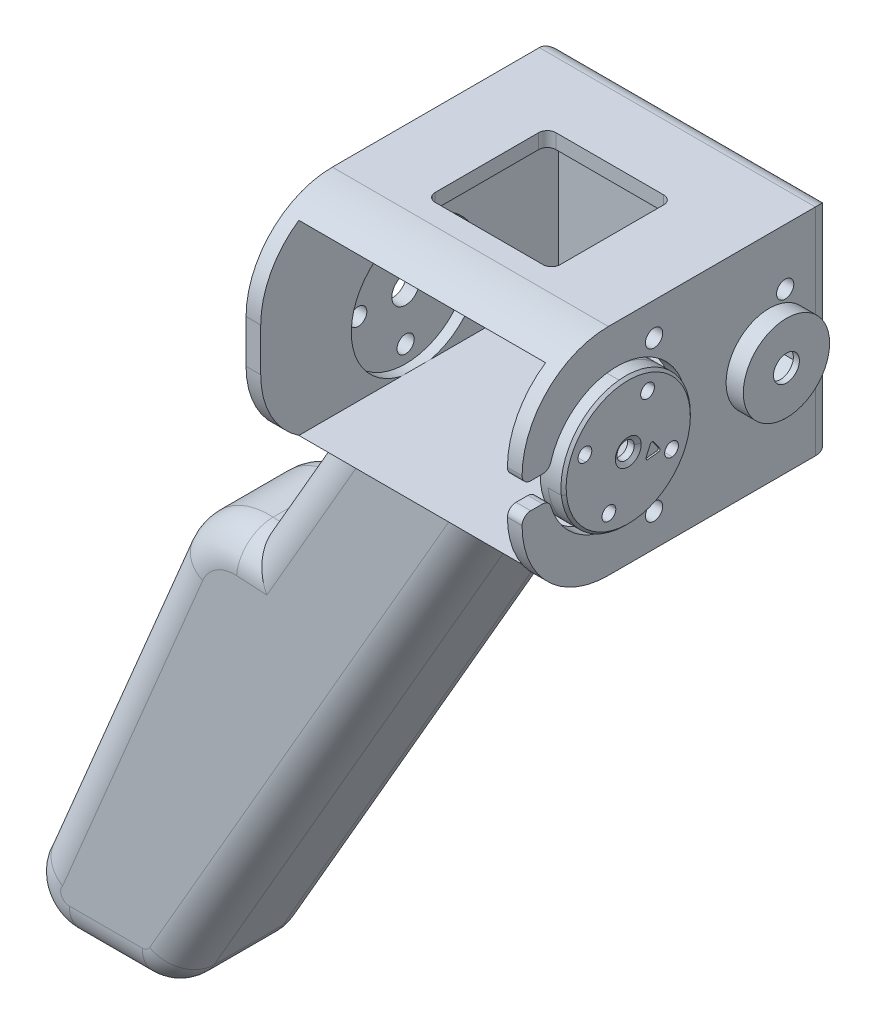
ISO-10303-21;
HEADER;
FILE_DESCRIPTION(('STEP AP214'),'2;1');
FILE_NAME('part.step','',(''),(''),'','','');
FILE_SCHEMA(('AUTOMOTIVE_DESIGN { 1 0 10303 214 1 1 1 1 }'));
ENDSEC;
DATA;
#1=APPLICATION_CONTEXT('core data for automotive mechanical design processes');
#2=APPLICATION_PROTOCOL_DEFINITION('international standard','automotive_design',2000,#1);
#3=PRODUCT_CONTEXT('',#1,'mechanical');
#4=PRODUCT('Part','Part','',(#3));
#5=PRODUCT_RELATED_PRODUCT_CATEGORY('part','',(#4));
#6=PRODUCT_DEFINITION_FORMATION('','',#4);
#7=PRODUCT_DEFINITION_CONTEXT('part definition',#1,'design');
#8=PRODUCT_DEFINITION('design','',#6,#7);
#9=PRODUCT_DEFINITION_SHAPE('','',#8);
#10=(LENGTH_UNIT() NAMED_UNIT(*) SI_UNIT(.MILLI.,.METRE.));
#11=(NAMED_UNIT(*) PLANE_ANGLE_UNIT() SI_UNIT($,.RADIAN.));
#12=(NAMED_UNIT(*) SI_UNIT($,.STERADIAN.) SOLID_ANGLE_UNIT());
#13=UNCERTAINTY_MEASURE_WITH_UNIT(LENGTH_MEASURE(1.E-05),#10,'distance_accuracy_value','');
#14=(GEOMETRIC_REPRESENTATION_CONTEXT(3) GLOBAL_UNCERTAINTY_ASSIGNED_CONTEXT((#13)) GLOBAL_UNIT_ASSIGNED_CONTEXT((#10,
#11,#12)) REPRESENTATION_CONTEXT('',''));
#15=CARTESIAN_POINT('',(0.,0.,0.));
#16=DIRECTION('',(0.,0.,1.));
#17=DIRECTION('',(1.,0.,0.));
#18=AXIS2_PLACEMENT_3D('',#15,#16,#17);
#19=CARTESIAN_POINT('',(6.55000000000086,-3.19999999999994,12.5));
#20=DIRECTION('',(-1.,0.,0.));
#21=DIRECTION('',(0.,0.,1.));
#22=AXIS2_PLACEMENT_3D('',#19,#20,#21);
#23=CYLINDRICAL_SURFACE('',#22,1.);
#24=CARTESIAN_POINT('',(-16.4499999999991,-3.19999999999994,12.5));
#25=DIRECTION('',(-1.,0.,0.));
#26=DIRECTION('',(0.,0.,1.));
#27=AXIS2_PLACEMENT_3D('',#24,#25,#26);
#28=CIRCLE('',#27,1.);
#29=CARTESIAN_POINT('',(-16.4499999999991,-3.19999999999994,13.5));
#30=VERTEX_POINT('',#29);
#31=EDGE_CURVE('P0_E427',#30,#30,#28,.T.);
#32=ORIENTED_EDGE('',*,*,#31,.T.);
#33=EDGE_LOOP('',(#32));
#34=FACE_BOUND('',#33,.T.);
#35=CARTESIAN_POINT('',(-14.9499999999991,-3.19999999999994,12.5));
#36=DIRECTION('',(1.,0.,0.));
#37=DIRECTION('',(0.,0.,-1.));
#38=AXIS2_PLACEMENT_3D('',#35,#36,#37);
#39=CIRCLE('',#38,1.);
#40=CARTESIAN_POINT('',(-14.9499999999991,-3.19999999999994,11.5));
#41=VERTEX_POINT('',#40);
#42=EDGE_CURVE('P0_E424',#41,#41,#39,.F.);
#43=ORIENTED_EDGE('',*,*,#42,.F.);
#44=EDGE_LOOP('',(#43));
#45=FACE_BOUND('',#44,.T.);
#46=ADVANCED_FACE('P0_F41',(#34,#45),#23,.F.);
#47=CARTESIAN_POINT('',(6.55000000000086,-8.69999999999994,18.));
#48=DIRECTION('',(-1.,0.,0.));
#49=DIRECTION('',(0.,0.,1.));
#50=AXIS2_PLACEMENT_3D('',#47,#48,#49);
#51=CYLINDRICAL_SURFACE('',#50,1.);
#52=CARTESIAN_POINT('',(-16.4499999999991,-8.69999999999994,18.));
#53=DIRECTION('',(-1.,0.,0.));
#54=DIRECTION('',(0.,0.,1.));
#55=AXIS2_PLACEMENT_3D('',#52,#53,#54);
#56=CIRCLE('',#55,1.);
#57=CARTESIAN_POINT('',(-16.4499999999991,-8.69999999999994,19.));
#58=VERTEX_POINT('',#57);
#59=EDGE_CURVE('P0_E430',#58,#58,#56,.T.);
#60=ORIENTED_EDGE('',*,*,#59,.T.);
#61=EDGE_LOOP('',(#60));
#62=FACE_BOUND('',#61,.T.);
#63=CARTESIAN_POINT('',(-14.9499999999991,-8.69999999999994,18.));
#64=DIRECTION('',(1.,0.,0.));
#65=DIRECTION('',(0.,0.,-1.));
#66=AXIS2_PLACEMENT_3D('',#63,#64,#65);
#67=CIRCLE('',#66,1.);
#68=CARTESIAN_POINT('',(-14.9499999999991,-8.69999999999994,17.));
#69=VERTEX_POINT('',#68);
#70=EDGE_CURVE('P0_E421',#69,#69,#67,.F.);
#71=ORIENTED_EDGE('',*,*,#70,.F.);
#72=EDGE_LOOP('',(#71));
#73=FACE_BOUND('',#72,.T.);
#74=ADVANCED_FACE('P0_F894',(#62,#73),#51,.F.);
#75=CARTESIAN_POINT('',(6.55000000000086,-3.19999999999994,23.5));
#76=DIRECTION('',(-1.,0.,0.));
#77=DIRECTION('',(0.,0.,1.));
#78=AXIS2_PLACEMENT_3D('',#75,#76,#77);
#79=CYLINDRICAL_SURFACE('',#78,1.);
#80=CARTESIAN_POINT('',(-16.4499999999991,-3.19999999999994,23.5));
#81=DIRECTION('',(-1.,0.,0.));
#82=DIRECTION('',(0.,0.,1.));
#83=AXIS2_PLACEMENT_3D('',#80,#81,#82);
#84=CIRCLE('',#83,1.);
#85=CARTESIAN_POINT('',(-16.4499999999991,-3.19999999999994,24.5));
#86=VERTEX_POINT('',#85);
#87=EDGE_CURVE('P0_E436',#86,#86,#84,.T.);
#88=ORIENTED_EDGE('',*,*,#87,.T.);
#89=EDGE_LOOP('',(#88));
#90=FACE_BOUND('',#89,.T.);
#91=CARTESIAN_POINT('',(-14.9499999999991,-3.19999999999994,23.5));
#92=DIRECTION('',(1.,0.,0.));
#93=DIRECTION('',(0.,0.,-1.));
#94=AXIS2_PLACEMENT_3D('',#91,#92,#93);
#95=CIRCLE('',#94,1.);
#96=CARTESIAN_POINT('',(-14.9499999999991,-3.19999999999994,22.5));
#97=VERTEX_POINT('',#96);
#98=EDGE_CURVE('P0_E418',#97,#97,#95,.F.);
#99=ORIENTED_EDGE('',*,*,#98,.F.);
#100=EDGE_LOOP('',(#99));
#101=FACE_BOUND('',#100,.T.);
#102=ADVANCED_FACE('P0_F900',(#90,#101),#79,.F.);
#103=CARTESIAN_POINT('',(6.55000000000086,-3.19999999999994,18.));
#104=DIRECTION('',(-1.,0.,0.));
#105=DIRECTION('',(0.,0.,1.));
#106=AXIS2_PLACEMENT_3D('',#103,#104,#105);
#107=CYLINDRICAL_SURFACE('',#106,1.6);
#108=CARTESIAN_POINT('',(-16.4499999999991,-3.19999999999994,18.));
#109=DIRECTION('',(-1.,0.,0.));
#110=DIRECTION('',(0.,0.,1.));
#111=AXIS2_PLACEMENT_3D('',#108,#109,#110);
#112=CIRCLE('',#111,1.6);
#113=CARTESIAN_POINT('',(-16.4499999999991,-3.19999999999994,19.6));
#114=VERTEX_POINT('',#113);
#115=EDGE_CURVE('P0_E433',#114,#114,#112,.T.);
#116=ORIENTED_EDGE('',*,*,#115,.T.);
#117=EDGE_LOOP('',(#116));
#118=FACE_BOUND('',#117,.T.);
#119=CARTESIAN_POINT('',(-14.9499999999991,-3.19999999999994,18.));
#120=DIRECTION('',(1.,0.,0.));
#121=DIRECTION('',(0.,0.,-1.));
#122=AXIS2_PLACEMENT_3D('',#119,#120,#121);
#123=CIRCLE('',#122,1.6);
#124=CARTESIAN_POINT('',(-14.9499999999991,-3.19999999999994,16.4));
#125=VERTEX_POINT('',#124);
#126=EDGE_CURVE('P0_E412',#125,#125,#123,.F.);
#127=ORIENTED_EDGE('',*,*,#126,.F.);
#128=EDGE_LOOP('',(#127));
#129=FACE_BOUND('',#128,.T.);
#130=ADVANCED_FACE('P0_F905',(#118,#129),#107,.F.);
#131=CARTESIAN_POINT('',(6.55000000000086,2.30000000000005,18.));
#132=DIRECTION('',(-1.,0.,0.));
#133=DIRECTION('',(0.,0.,1.));
#134=AXIS2_PLACEMENT_3D('',#131,#132,#133);
#135=CYLINDRICAL_SURFACE('',#134,1.);
#136=CARTESIAN_POINT('',(-16.4499999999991,2.30000000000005,18.));
#137=DIRECTION('',(-1.,0.,0.));
#138=DIRECTION('',(0.,0.,1.));
#139=AXIS2_PLACEMENT_3D('',#136,#137,#138);
#140=CIRCLE('',#139,1.);
#141=CARTESIAN_POINT('',(-16.4499999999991,2.30000000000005,19.));
#142=VERTEX_POINT('',#141);
#143=EDGE_CURVE('P0_E439',#142,#142,#140,.T.);
#144=ORIENTED_EDGE('',*,*,#143,.T.);
#145=EDGE_LOOP('',(#144));
#146=FACE_BOUND('',#145,.T.);
#147=CARTESIAN_POINT('',(-14.9499999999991,2.30000000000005,18.));
#148=DIRECTION('',(1.,0.,0.));
#149=DIRECTION('',(0.,0.,-1.));
#150=AXIS2_PLACEMENT_3D('',#147,#148,#149);
#151=CIRCLE('',#150,1.);
#152=CARTESIAN_POINT('',(-14.9499999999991,2.30000000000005,17.));
#153=VERTEX_POINT('',#152);
#154=EDGE_CURVE('P0_E45',#153,#153,#151,.F.);
#155=ORIENTED_EDGE('',*,*,#154,.F.);
#156=EDGE_LOOP('',(#155));
#157=FACE_BOUND('',#156,.T.);
#158=ADVANCED_FACE('P0_F832',(#146,#157),#135,.F.);
#159=CARTESIAN_POINT('',(-15.4499999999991,-12.1999999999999,36.));
#160=DIRECTION('',(-1.,0.,0.));
#161=DIRECTION('',(0.,0.,1.));
#162=AXIS2_PLACEMENT_3D('',#159,#160,#161);
#163=PLANE('',#162);
#164=DIRECTION('',(0.,0.,-1.));
#165=VECTOR('',#164,1.);
#166=CARTESIAN_POINT('',(-15.4499999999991,12.8000000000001,36.));
#167=LINE('',#166,#165);
#168=CARTESIAN_POINT('',(-15.4499999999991,12.8000000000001,26.));
#169=VERTEX_POINT('',#168);
#170=CARTESIAN_POINT('',(-15.4499999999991,12.8000000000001,2.));
#171=VERTEX_POINT('',#170);
#172=EDGE_CURVE('P0_E586',#169,#171,#167,.T.);
#173=ORIENTED_EDGE('',*,*,#172,.T.);
#174=DIRECTION('',(0.,1.,0.));
#175=VECTOR('',#174,1.);
#176=CARTESIAN_POINT('',(-15.4499999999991,-12.1999999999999,2.));
#177=LINE('',#176,#175);
#178=CARTESIAN_POINT('',(-15.4499999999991,-12.1999999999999,2.));
#179=VERTEX_POINT('',#178);
#180=EDGE_CURVE('P0_E647',#171,#179,#177,.F.);
#181=ORIENTED_EDGE('',*,*,#180,.T.);
#182=DIRECTION('',(0.,0.,-1.));
#183=VECTOR('',#182,1.);
#184=CARTESIAN_POINT('',(-15.4499999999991,-12.1999999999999,36.));
#185=LINE('',#184,#183);
#186=CARTESIAN_POINT('',(-15.4499999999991,-12.1999999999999,13.1500000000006));
#187=VERTEX_POINT('',#186);
#188=EDGE_CURVE('P0_E592',#187,#179,#185,.T.);
#189=ORIENTED_EDGE('',*,*,#188,.F.);
#190=DIRECTION('',(0.,0.,1.));
#191=VECTOR('',#190,1.);
#192=CARTESIAN_POINT('',(-15.4499999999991,-12.1999999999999,9.15000000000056));
#193=LINE('',#192,#191);
#194=CARTESIAN_POINT('',(-15.4499999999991,-12.1999999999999,21.1500000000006));
#195=VERTEX_POINT('',#194);
#196=EDGE_CURVE('P0_E518',#187,#195,#193,.T.);
#197=ORIENTED_EDGE('',*,*,#196,.T.);
#198=CARTESIAN_POINT('',(-15.4499999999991,-12.1999999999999,26.));
#199=VERTEX_POINT('',#198);
#200=EDGE_CURVE('P0_E589',#199,#195,#185,.T.);
#201=ORIENTED_EDGE('',*,*,#200,.F.);
#202=CARTESIAN_POINT('',(-15.4499999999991,-2.19999999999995,26.));
#203=DIRECTION('',(-1.,0.,0.));
#204=DIRECTION('',(0.,0.,1.));
#205=AXIS2_PLACEMENT_3D('',#202,#203,#204);
#206=CIRCLE('',#205,10.);
#207=CARTESIAN_POINT('',(-15.4499999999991,-2.19999999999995,36.));
#208=VERTEX_POINT('',#207);
#209=EDGE_CURVE('P0_E631',#199,#208,#206,.T.);
#210=ORIENTED_EDGE('',*,*,#209,.T.);
#211=DIRECTION('',(0.,1.,0.));
#212=VECTOR('',#211,1.);
#213=CARTESIAN_POINT('',(-15.4499999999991,-12.1999999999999,36.));
#214=LINE('',#213,#212);
#215=CARTESIAN_POINT('',(-15.4499999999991,2.80000000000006,36.));
#216=VERTEX_POINT('',#215);
#217=EDGE_CURVE('P0_E583',#208,#216,#214,.T.);
#218=ORIENTED_EDGE('',*,*,#217,.T.);
#219=CARTESIAN_POINT('',(-15.4499999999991,2.80000000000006,26.));
#220=DIRECTION('',(-1.,0.,0.));
#221=DIRECTION('',(0.,0.,1.));
#222=AXIS2_PLACEMENT_3D('',#219,#220,#221);
#223=CIRCLE('',#222,10.);
#224=EDGE_CURVE('P0_E629',#216,#169,#223,.T.);
#225=ORIENTED_EDGE('',*,*,#224,.T.);
#226=EDGE_LOOP('',(#173,#181,#189,#197,#201,#210,#218,#225));
#227=FACE_BOUND('',#226,.T.);
#228=CARTESIAN_POINT('',(-15.4499999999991,-3.19999999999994,18.));
#229=DIRECTION('',(-1.,0.,0.));
#230=DIRECTION('',(0.,0.,1.));
#231=AXIS2_PLACEMENT_3D('',#228,#229,#230);
#232=CIRCLE('',#231,7.5);
#233=CARTESIAN_POINT('',(-15.4499999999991,-3.19999999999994,25.5));
#234=VERTEX_POINT('',#233);
#235=EDGE_CURVE('P0_E442',#234,#234,#232,.T.);
#236=ORIENTED_EDGE('',*,*,#235,.F.);
#237=EDGE_LOOP('',(#236));
#238=FACE_BOUND('',#237,.T.);
#239=ADVANCED_FACE('P0_F828',(#227,#238),#163,.T.);
#240=CARTESIAN_POINT('',(6.55000000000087,0.299999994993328,7.35000000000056));
#241=DIRECTION('',(1.,0.,0.));
#242=DIRECTION('',(0.,0.,-1.));
#243=AXIS2_PLACEMENT_3D('',#240,#241,#242);
#244=CYLINDRICAL_SURFACE('',#243,1.5);
#245=CARTESIAN_POINT('',(18.5500000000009,0.299999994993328,7.35000000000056));
#246=DIRECTION('',(1.,0.,0.));
#247=DIRECTION('',(0.,0.,-1.));
#248=AXIS2_PLACEMENT_3D('',#245,#246,#247);
#249=CIRCLE('',#248,1.5);
#250=CARTESIAN_POINT('',(18.5500000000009,0.299999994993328,5.85000000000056));
#251=VERTEX_POINT('',#250);
#252=EDGE_CURVE('P0_E521',#251,#251,#249,.T.);
#253=ORIENTED_EDGE('',*,*,#252,.T.);
#254=EDGE_LOOP('',(#253));
#255=FACE_BOUND('',#254,.T.);
#256=CARTESIAN_POINT('',(17.8500000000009,0.299999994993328,7.35000000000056));
#257=DIRECTION('',(-1.,0.,0.));
#258=DIRECTION('',(0.,0.,1.));
#259=AXIS2_PLACEMENT_3D('',#256,#257,#258);
#260=CIRCLE('',#259,1.5);
#261=CARTESIAN_POINT('',(17.8500000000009,0.299999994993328,8.85000000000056));
#262=VERTEX_POINT('',#261);
#263=EDGE_CURVE('P0_E485',#262,#262,#260,.F.);
#264=ORIENTED_EDGE('',*,*,#263,.F.);
#265=EDGE_LOOP('',(#264));
#266=FACE_BOUND('',#265,.T.);
#267=ADVANCED_FACE('P0_F831',(#255,#266),#244,.F.);
#268=CARTESIAN_POINT('',(0.,0.,9.15000000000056));
#269=DIRECTION('',(0.,0.,1.));
#270=DIRECTION('',(1.,0.,0.));
#271=AXIS2_PLACEMENT_3D('',#268,#269,#270);
#272=PLANE('',#271);
#273=CARTESIAN_POINT('',(-27.6310390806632,-38.6055214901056,9.15000000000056));
#274=DIRECTION('',(0.,0.,1.));
#275=DIRECTION('',(1.,0.,0.));
#276=AXIS2_PLACEMENT_3D('',#273,#274,#275);
#277=CIRCLE('',#276,4.);
#278=CARTESIAN_POINT('',(-27.3954727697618,-34.6124639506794,9.15000000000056));
#279=VERTEX_POINT('',#278);
#280=CARTESIAN_POINT('',(-31.3205494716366,-37.0603635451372,9.15000000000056));
#281=VERTEX_POINT('',#280);
#282=EDGE_CURVE('P0_E1665',#279,#281,#277,.T.);
#283=ORIENTED_EDGE('',*,*,#282,.F.);
#284=DIRECTION('',(0.998264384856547,-0.0588915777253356,0.));
#285=VECTOR('',#284,1.);
#286=CARTESIAN_POINT('',(-26.3554392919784,-34.6738196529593,9.15000000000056));
#287=LINE('',#286,#285);
#288=CARTESIAN_POINT('',(-23.8904225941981,-34.8192407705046,9.15000000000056));
#289=VERTEX_POINT('',#288);
#290=EDGE_CURVE('P0_E726',#279,#289,#287,.T.);
#291=ORIENTED_EDGE('',*,*,#290,.T.);
#292=DIRECTION('',(-0.500000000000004,-0.866025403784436,0.));
#293=VECTOR('',#292,1.);
#294=CARTESIAN_POINT('',(-11.9858983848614,-14.2,9.15000000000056));
#295=LINE('',#294,#293);
#296=CARTESIAN_POINT('',(-10.8311978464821,-12.1999999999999,9.15000000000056));
#297=VERTEX_POINT('',#296);
#298=EDGE_CURVE('P0_E728',#289,#297,#295,.F.);
#299=ORIENTED_EDGE('',*,*,#298,.T.);
#300=DIRECTION('',(-1.,0.,0.));
#301=VECTOR('',#300,1.);
#302=CARTESIAN_POINT('',(4.55000000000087,-12.1999999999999,9.15000000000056));
#303=LINE('',#302,#301);
#304=CARTESIAN_POINT('',(-0.0465634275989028,-12.1999999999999,9.15000000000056));
#305=VERTEX_POINT('',#304);
#306=EDGE_CURVE('P0_E515',#305,#297,#303,.T.);
#307=ORIENTED_EDGE('',*,*,#306,.F.);
#308=CARTESIAN_POINT('',(7.43675134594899,-17.1999999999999,9.15000000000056));
#309=DIRECTION('',(0.,0.,1.));
#310=DIRECTION('',(1.,0.,0.));
#311=AXIS2_PLACEMENT_3D('',#308,#309,#310);
#312=CIRCLE('',#311,9.);
#313=CARTESIAN_POINT('',(-0.357477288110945,-12.6999999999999,9.15000000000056));
#314=VERTEX_POINT('',#313);
#315=EDGE_CURVE('P0_E734',#305,#314,#312,.T.);
#316=ORIENTED_EDGE('',*,*,#315,.T.);
#317=DIRECTION('',(0.500000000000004,0.866025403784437,0.));
#318=VECTOR('',#317,1.);
#319=CARTESIAN_POINT('',(-37.4707259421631,-76.9820323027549,9.15000000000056));
#320=LINE('',#319,#318);
#321=CARTESIAN_POINT('',(-37.4707259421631,-76.9820323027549,9.15000000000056));
#322=VERTEX_POINT('',#321);
#323=EDGE_CURVE('P0_E732',#314,#322,#320,.F.);
#324=ORIENTED_EDGE('',*,*,#323,.T.);
#325=CARTESIAN_POINT('',(-38.3367513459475,-76.4820323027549,9.15000000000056));
#326=DIRECTION('',(0.,0.,1.));
#327=DIRECTION('',(1.,0.,0.));
#328=AXIS2_PLACEMENT_3D('',#325,#326,#327);
#329=CIRCLE('',#328,1.);
#330=CARTESIAN_POINT('',(-38.3367513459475,-77.4820323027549,9.15000000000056));
#331=VERTEX_POINT('',#330);
#332=EDGE_CURVE('P0_E730',#322,#331,#329,.F.);
#333=ORIENTED_EDGE('',*,*,#332,.T.);
#334=DIRECTION('',(1.,0.,0.));
#335=VECTOR('',#334,1.);
#336=CARTESIAN_POINT('',(-46.789745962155,-77.4820323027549,9.15000000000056));
#337=LINE('',#336,#335);
#338=CARTESIAN_POINT('',(-46.789745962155,-77.4820323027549,9.15000000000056));
#339=VERTEX_POINT('',#338);
#340=EDGE_CURVE('P0_E719',#331,#339,#337,.F.);
#341=ORIENTED_EDGE('',*,*,#340,.T.);
#342=CARTESIAN_POINT('',(-46.789745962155,-76.4820323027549,9.15000000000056));
#343=DIRECTION('',(0.,0.,1.));
#344=DIRECTION('',(1.,0.,0.));
#345=AXIS2_PLACEMENT_3D('',#342,#343,#344);
#346=CIRCLE('',#345,1.);
#347=CARTESIAN_POINT('',(-47.5664745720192,-75.8521968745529,9.15000000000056));
#348=VERTEX_POINT('',#347);
#349=EDGE_CURVE('P0_E721',#339,#348,#346,.F.);
#350=ORIENTED_EDGE('',*,*,#349,.T.);
#351=DIRECTION('',(0.386289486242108,0.922377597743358,0.));
#352=VECTOR('',#351,1.);
#353=CARTESIAN_POINT('',(-29.1303625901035,-31.830660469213,9.15000000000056));
#354=LINE('',#353,#352);
#355=EDGE_CURVE('P0_E723',#348,#281,#354,.T.);
#356=ORIENTED_EDGE('',*,*,#355,.T.);
#357=EDGE_LOOP('',(#283,#291,#299,#307,#316,#324,#333,#341,#350,#356));
#358=FACE_BOUND('',#357,.T.);
#359=ADVANCED_FACE('P0_F1067',(#358),#272,.F.);
#360=CARTESIAN_POINT('',(0.,0.,25.1500000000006));
#361=DIRECTION('',(0.,0.,1.));
#362=DIRECTION('',(1.,0.,0.));
#363=AXIS2_PLACEMENT_3D('',#360,#361,#362);
#364=PLANE('',#363);
#365=CARTESIAN_POINT('',(-27.6310390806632,-38.6055214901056,25.1500000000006));
#366=DIRECTION('',(0.,0.,1.));
#367=DIRECTION('',(1.,0.,0.));
#368=AXIS2_PLACEMENT_3D('',#365,#366,#367);
#369=CIRCLE('',#368,4.);
#370=CARTESIAN_POINT('',(-31.3205494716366,-37.0603635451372,25.1500000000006));
#371=VERTEX_POINT('',#370);
#372=CARTESIAN_POINT('',(-27.3954727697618,-34.6124639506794,25.1500000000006));
#373=VERTEX_POINT('',#372);
#374=EDGE_CURVE('P0_E1663',#371,#373,#369,.F.);
#375=ORIENTED_EDGE('',*,*,#374,.F.);
#376=DIRECTION('',(-0.386289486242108,-0.922377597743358,0.));
#377=VECTOR('',#376,1.);
#378=CARTESIAN_POINT('',(-13.4421263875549,5.62952971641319,25.1500000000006));
#379=LINE('',#378,#377);
#380=CARTESIAN_POINT('',(-47.5664745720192,-75.8521968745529,25.1500000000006));
#381=VERTEX_POINT('',#380);
#382=EDGE_CURVE('P0_E749',#371,#381,#379,.T.);
#383=ORIENTED_EDGE('',*,*,#382,.T.);
#384=CARTESIAN_POINT('',(-46.789745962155,-76.4820323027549,25.1500000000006));
#385=DIRECTION('',(0.,0.,1.));
#386=DIRECTION('',(1.,0.,0.));
#387=AXIS2_PLACEMENT_3D('',#384,#385,#386);
#388=CIRCLE('',#387,1.);
#389=CARTESIAN_POINT('',(-46.789745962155,-77.4820323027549,25.1500000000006));
#390=VERTEX_POINT('',#389);
#391=EDGE_CURVE('P0_E756',#381,#390,#388,.T.);
#392=ORIENTED_EDGE('',*,*,#391,.T.);
#393=DIRECTION('',(1.,0.,0.));
#394=VECTOR('',#393,1.);
#395=CARTESIAN_POINT('',(0.,-77.4820323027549,25.1500000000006));
#396=LINE('',#395,#394);
#397=CARTESIAN_POINT('',(-38.3367513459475,-77.4820323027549,25.1500000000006));
#398=VERTEX_POINT('',#397);
#399=EDGE_CURVE('P0_E758',#390,#398,#396,.T.);
#400=ORIENTED_EDGE('',*,*,#399,.T.);
#401=CARTESIAN_POINT('',(-38.3367513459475,-76.4820323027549,25.1500000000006));
#402=DIRECTION('',(0.,0.,1.));
#403=DIRECTION('',(1.,0.,0.));
#404=AXIS2_PLACEMENT_3D('',#401,#402,#403);
#405=CIRCLE('',#404,1.);
#406=CARTESIAN_POINT('',(-37.4707259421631,-76.9820323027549,25.1500000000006));
#407=VERTEX_POINT('',#406);
#408=EDGE_CURVE('P0_E760',#398,#407,#405,.T.);
#409=ORIENTED_EDGE('',*,*,#408,.T.);
#410=DIRECTION('',(0.500000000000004,0.866025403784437,0.));
#411=VECTOR('',#410,1.);
#412=CARTESIAN_POINT('',(5.23115334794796,-3.02020779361,25.1500000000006));
#413=LINE('',#412,#411);
#414=CARTESIAN_POINT('',(-0.357477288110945,-12.6999999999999,25.1500000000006));
#415=VERTEX_POINT('',#414);
#416=EDGE_CURVE('P0_E762',#407,#415,#413,.T.);
#417=ORIENTED_EDGE('',*,*,#416,.T.);
#418=CARTESIAN_POINT('',(7.43675134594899,-17.1999999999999,25.1500000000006));
#419=DIRECTION('',(0.,0.,1.));
#420=DIRECTION('',(1.,0.,0.));
#421=AXIS2_PLACEMENT_3D('',#418,#419,#420);
#422=CIRCLE('',#421,9.);
#423=CARTESIAN_POINT('',(-0.0465634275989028,-12.1999999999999,25.1500000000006));
#424=VERTEX_POINT('',#423);
#425=EDGE_CURVE('P0_E764',#415,#424,#422,.F.);
#426=ORIENTED_EDGE('',*,*,#425,.T.);
#427=DIRECTION('',(-1.,0.,0.));
#428=VECTOR('',#427,1.);
#429=CARTESIAN_POINT('',(4.55000000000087,-12.1999999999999,25.1500000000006));
#430=LINE('',#429,#428);
#431=CARTESIAN_POINT('',(-10.8311978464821,-12.1999999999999,25.1500000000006));
#432=VERTEX_POINT('',#431);
#433=EDGE_CURVE('P0_E511',#424,#432,#430,.T.);
#434=ORIENTED_EDGE('',*,*,#433,.T.);
#435=DIRECTION('',(-0.500000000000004,-0.866025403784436,0.));
#436=VECTOR('',#435,1.);
#437=CARTESIAN_POINT('',(-2.84064342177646,1.6400462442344,25.1500000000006));
#438=LINE('',#437,#436);
#439=CARTESIAN_POINT('',(-23.8904225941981,-34.8192407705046,25.1500000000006));
#440=VERTEX_POINT('',#439);
#441=EDGE_CURVE('P0_E754',#432,#440,#438,.T.);
#442=ORIENTED_EDGE('',*,*,#441,.T.);
#443=DIRECTION('',(-0.998264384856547,0.0588915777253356,0.));
#444=VECTOR('',#443,1.);
#445=CARTESIAN_POINT('',(-2.12985823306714,-36.1029828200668,25.1500000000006));
#446=LINE('',#445,#444);
#447=EDGE_CURVE('P0_E751',#440,#373,#446,.T.);
#448=ORIENTED_EDGE('',*,*,#447,.T.);
#449=EDGE_LOOP('',(#375,#383,#392,#400,#409,#417,#426,#434,#442,#448));
#450=FACE_BOUND('',#449,.T.);
#451=ADVANCED_FACE('P0_F815',(#450),#364,.T.);
#452=CARTESIAN_POINT('',(-15.4499999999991,-12.1999999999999,36.));
#453=DIRECTION('',(0.,1.,0.));
#454=DIRECTION('',(0.,0.,1.));
#455=AXIS2_PLACEMENT_3D('',#452,#453,#454);
#456=PLANE('',#455);
#457=ORIENTED_EDGE('',*,*,#433,.F.);
#458=CARTESIAN_POINT('',(-0.0465634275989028,-12.1999999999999,25.1500000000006));
#459=CARTESIAN_POINT('',(0.124087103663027,-12.1999999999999,25.1500131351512));
#460=CARTESIAN_POINT('',(0.294646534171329,-12.1999999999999,25.1424528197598));
#461=CARTESIAN_POINT('',(0.63433925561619,-12.1999999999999,25.1132755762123));
#462=CARTESIAN_POINT('',(0.803474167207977,-12.1999999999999,25.0916777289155));
#463=CARTESIAN_POINT('',(1.13773089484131,-12.1999999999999,25.035812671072));
#464=CARTESIAN_POINT('',(1.30287631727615,-12.1999999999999,25.0016845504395));
#465=CARTESIAN_POINT('',(1.63038192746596,-12.1999999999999,24.9218076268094));
#466=CARTESIAN_POINT('',(1.7927407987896,-12.1999999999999,24.8760534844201));
#467=CARTESIAN_POINT('',(2.20291853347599,-12.1999999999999,24.7458001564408));
#468=CARTESIAN_POINT('',(2.4483919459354,-12.1999999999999,24.6538612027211));
#469=CARTESIAN_POINT('',(2.93016145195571,-12.1999999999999,24.4485527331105));
#470=CARTESIAN_POINT('',(3.16645336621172,-12.1999999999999,24.3351735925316));
#471=CARTESIAN_POINT('',(3.86357028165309,-12.1999999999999,23.9672362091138));
#472=CARTESIAN_POINT('',(4.31015805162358,-12.2,23.6857361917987));
#473=CARTESIAN_POINT('',(5.21593141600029,-12.1999999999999,23.0464791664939));
#474=CARTESIAN_POINT('',(5.6714853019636,-12.1999999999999,22.6838122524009));
#475=CARTESIAN_POINT('',(6.5601202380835,-12.2,21.9339044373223));
#476=CARTESIAN_POINT('',(6.99322985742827,-12.2000000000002,21.5466962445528));
#477=CARTESIAN_POINT('',(7.42972406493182,-12.1999999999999,21.156285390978));
#478=CARTESIAN_POINT('',(7.4332377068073,-12.1999999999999,21.15314269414));
#479=CARTESIAN_POINT('',(7.43675134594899,-12.1999999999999,21.1500000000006));
#480=B_SPLINE_CURVE_WITH_KNOTS('',3,(#458,#459,#460,#461,#462,#463,#464,#465,#466,#467,#468,
#469,#470,#471,#472,#473,#474,#475,#476,#477,#478,#479),.UNSPECIFIED.,.F.,.F.,(4,2,2,2,2,2,2,2,
2,2,4),(0.,0.511651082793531,1.02260814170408,1.52805691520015,2.03373824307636,2.8188140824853,
3.60424318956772,5.18287573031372,6.92786330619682,8.67057220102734,8.68471433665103),.UNSPECIFIED.);
#481=CARTESIAN_POINT('',(7.43675134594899,-12.1999999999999,21.1500000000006));
#482=VERTEX_POINT('',#481);
#483=EDGE_CURVE('P0_E798',#424,#482,#480,.T.);
#484=ORIENTED_EDGE('',*,*,#483,.T.);
#485=DIRECTION('',(0.,0.,1.));
#486=VECTOR('',#485,1.);
#487=CARTESIAN_POINT('',(7.43675134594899,-12.1999999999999,36.));
#488=LINE('',#487,#486);
#489=CARTESIAN_POINT('',(7.43675134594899,-12.1999999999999,13.1500000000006));
#490=VERTEX_POINT('',#489);
#491=EDGE_CURVE('P0_E707',#482,#490,#488,.F.);
#492=ORIENTED_EDGE('',*,*,#491,.T.);
#493=CARTESIAN_POINT('',(-0.0465634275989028,-12.1999999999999,9.15000000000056));
#494=CARTESIAN_POINT('',(0.124087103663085,-12.1999999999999,9.14998686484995));
#495=CARTESIAN_POINT('',(0.294646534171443,-12.1999999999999,9.15754718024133));
#496=CARTESIAN_POINT('',(0.63433925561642,-12.1999999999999,9.18672442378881));
#497=CARTESIAN_POINT('',(0.803474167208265,-12.1999999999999,9.20832227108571));
#498=CARTESIAN_POINT('',(1.13773089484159,-12.1999999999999,9.26418732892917));
#499=CARTESIAN_POINT('',(1.30287631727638,-12.1999999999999,9.29831544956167));
#500=CARTESIAN_POINT('',(1.63038192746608,-12.1999999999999,9.37819237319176));
#501=CARTESIAN_POINT('',(1.79274079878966,-12.1999999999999,9.42394651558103));
#502=CARTESIAN_POINT('',(2.20291853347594,-12.1999999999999,9.55419984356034));
#503=CARTESIAN_POINT('',(2.4483919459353,-12.1999999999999,9.64613879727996));
#504=CARTESIAN_POINT('',(2.9301614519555,-12.1999999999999,9.85144726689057));
#505=CARTESIAN_POINT('',(3.16645336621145,-12.1999999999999,9.96482640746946));
#506=CARTESIAN_POINT('',(3.86357028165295,-12.1999999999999,10.3327637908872));
#507=CARTESIAN_POINT('',(4.31015805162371,-12.2,10.6142638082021));
#508=CARTESIAN_POINT('',(5.21593141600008,-12.1999999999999,11.2535208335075));
#509=CARTESIAN_POINT('',(5.67148530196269,-12.1999999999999,11.6161877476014));
#510=CARTESIAN_POINT('',(6.56012023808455,-12.2,12.3660955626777));
#511=CARTESIAN_POINT('',(6.99322985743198,-12.2000000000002,12.7533037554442));
#512=CARTESIAN_POINT('',(7.42972406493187,-12.1999999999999,13.143714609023));
#513=CARTESIAN_POINT('',(7.43323770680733,-12.1999999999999,13.146857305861));
#514=CARTESIAN_POINT('',(7.43675134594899,-12.1999999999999,13.1500000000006));
#515=B_SPLINE_CURVE_WITH_KNOTS('',3,(#493,#494,#495,#496,#497,#498,#499,#500,#501,#502,#503,
#504,#505,#506,#507,#508,#509,#510,#511,#512,#513,#514),.UNSPECIFIED.,.F.,.F.,(4,2,2,2,2,2,2,2,
2,2,4),(0.,0.511651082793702,1.02260814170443,1.52805691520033,2.03373824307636,
2.81881408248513,3.60424318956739,5.18287573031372,6.92786330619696,8.67057220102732,
8.68471433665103),.UNSPECIFIED.);
#516=EDGE_CURVE('P0_E790',#490,#305,#515,.F.);
#517=ORIENTED_EDGE('',*,*,#516,.T.);
#518=ORIENTED_EDGE('',*,*,#306,.T.);
#519=CARTESIAN_POINT('',(-10.8311978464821,-12.1999999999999,13.1500000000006));
#520=DIRECTION('',(0.,1.,0.));
#521=DIRECTION('',(1.,0.,0.));
#522=AXIS2_PLACEMENT_3D('',#519,#520,#521);
#523=ELLIPSE('',#522,4.61880215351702,4.);
#524=EDGE_CURVE('P0_E972',#297,#187,#523,.T.);
#525=ORIENTED_EDGE('',*,*,#524,.T.);
#526=ORIENTED_EDGE('',*,*,#188,.T.);
#527=CARTESIAN_POINT('',(-13.4499999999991,-12.1999999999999,2.));
#528=DIRECTION('',(0.,1.,0.));
#529=DIRECTION('',(0.,0.,1.));
#530=AXIS2_PLACEMENT_3D('',#527,#528,#529);
#531=CIRCLE('',#530,2.);
#532=CARTESIAN_POINT('',(-13.4499999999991,-12.1999999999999,0.));
#533=VERTEX_POINT('',#532);
#534=EDGE_CURVE('P0_E653',#179,#533,#531,.F.);
#535=ORIENTED_EDGE('',*,*,#534,.T.);
#536=DIRECTION('',(1.,0.,0.));
#537=VECTOR('',#536,1.);
#538=CARTESIAN_POINT('',(-15.4499999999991,-12.1999999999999,0.));
#539=LINE('',#538,#537);
#540=CARTESIAN_POINT('',(14.5500000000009,-12.1999999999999,0.));
#541=VERTEX_POINT('',#540);
#542=EDGE_CURVE('P0_E577',#533,#541,#539,.T.);
#543=ORIENTED_EDGE('',*,*,#542,.T.);
#544=CARTESIAN_POINT('',(14.5500000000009,-12.1999999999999,2.));
#545=DIRECTION('',(0.,1.,0.));
#546=DIRECTION('',(0.,0.,1.));
#547=AXIS2_PLACEMENT_3D('',#544,#545,#546);
#548=CIRCLE('',#547,2.);
#549=CARTESIAN_POINT('',(16.5500000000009,-12.1999999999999,2.));
#550=VERTEX_POINT('',#549);
#551=EDGE_CURVE('P0_E650',#541,#550,#548,.F.);
#552=ORIENTED_EDGE('',*,*,#551,.T.);
#553=DIRECTION('',(0.,0.,-1.));
#554=VECTOR('',#553,1.);
#555=CARTESIAN_POINT('',(16.5500000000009,-12.1999999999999,36.));
#556=LINE('',#555,#554);
#557=CARTESIAN_POINT('',(16.5500000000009,-12.1999999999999,26.));
#558=VERTEX_POINT('',#557);
#559=EDGE_CURVE('P0_E593',#558,#550,#556,.T.);
#560=ORIENTED_EDGE('',*,*,#559,.F.);
#561=DIRECTION('',(1.,0.,0.));
#562=VECTOR('',#561,1.);
#563=CARTESIAN_POINT('',(-15.4499999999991,-12.1999999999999,26.));
#564=LINE('',#563,#562);
#565=EDGE_CURVE('P0_E627',#558,#199,#564,.F.);
#566=ORIENTED_EDGE('',*,*,#565,.T.);
#567=ORIENTED_EDGE('',*,*,#200,.T.);
#568=CARTESIAN_POINT('',(-10.8311978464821,-12.1999999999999,21.1500000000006));
#569=DIRECTION('',(0.,1.,0.));
#570=DIRECTION('',(-1.,0.,0.));
#571=AXIS2_PLACEMENT_3D('',#568,#569,#570);
#572=ELLIPSE('',#571,4.61880215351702,4.);
#573=EDGE_CURVE('P0_E977',#195,#432,#572,.T.);
#574=ORIENTED_EDGE('',*,*,#573,.T.);
#575=EDGE_LOOP('',(#457,#484,#492,#517,#518,#525,#526,#535,#543,#552,#560,#566,#567,#574));
#576=FACE_BOUND('',#575,.T.);
#577=ADVANCED_FACE('P0_F809',(#576),#456,.F.);
#578=CARTESIAN_POINT('',(16.5500000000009,-12.1999999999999,36.));
#579=DIRECTION('',(-1.,0.,0.));
#580=DIRECTION('',(0.,0.,1.));
#581=AXIS2_PLACEMENT_3D('',#578,#579,#580);
#582=PLANE('',#581);
#583=CARTESIAN_POINT('',(16.5500000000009,0.299999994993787,24.9799999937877));
#584=DIRECTION('',(-1.,0.,0.));
#585=DIRECTION('',(0.,0.,1.));
#586=AXIS2_PLACEMENT_3D('',#583,#584,#585);
#587=CIRCLE('',#586,8.);
#588=CARTESIAN_POINT('',(16.5500000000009,2.5222222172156,32.6651628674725));
#589=VERTEX_POINT('',#588);
#590=CARTESIAN_POINT('',(16.5500000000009,-1.92222222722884,32.6651628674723));
#591=VERTEX_POINT('',#590);
#592=EDGE_CURVE('P0_E556',#589,#591,#587,.T.);
#593=ORIENTED_EDGE('',*,*,#592,.T.);
#594=CARTESIAN_POINT('',(16.5500000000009,-2.20000000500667,33.6258082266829));
#595=DIRECTION('',(-1.,0.,0.));
#596=DIRECTION('',(0.,0.,1.));
#597=AXIS2_PLACEMENT_3D('',#594,#595,#596);
#598=CIRCLE('',#597,1.);
#599=CARTESIAN_POINT('',(16.5500000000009,-1.20000000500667,33.6258082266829));
#600=VERTEX_POINT('',#599);
#601=EDGE_CURVE('P0_E691',#591,#600,#598,.F.);
#602=ORIENTED_EDGE('',*,*,#601,.T.);
#603=DIRECTION('',(0.,0.,-1.));
#604=VECTOR('',#603,1.);
#605=CARTESIAN_POINT('',(16.5500000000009,-1.20000000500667,32.2984692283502));
#606=LINE('',#605,#604);
#607=CARTESIAN_POINT('',(16.5500000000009,-1.20000000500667,35.));
#608=VERTEX_POINT('',#607);
#609=EDGE_CURVE('P0_E530',#608,#600,#606,.T.);
#610=ORIENTED_EDGE('',*,*,#609,.F.);
#611=CARTESIAN_POINT('',(16.5500000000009,-2.20000000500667,35.));
#612=DIRECTION('',(-1.,0.,0.));
#613=DIRECTION('',(0.,0.,1.));
#614=AXIS2_PLACEMENT_3D('',#611,#612,#613);
#615=CIRCLE('',#614,1.);
#616=CARTESIAN_POINT('',(16.5500000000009,-2.19999999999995,36.));
#617=VERTEX_POINT('',#616);
#618=EDGE_CURVE('P0_E687',#608,#617,#615,.F.);
#619=ORIENTED_EDGE('',*,*,#618,.T.);
#620=CARTESIAN_POINT('',(16.5500000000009,-2.19999999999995,26.));
#621=DIRECTION('',(-1.,0.,0.));
#622=DIRECTION('',(0.,0.,1.));
#623=AXIS2_PLACEMENT_3D('',#620,#621,#622);
#624=CIRCLE('',#623,10.);
#625=EDGE_CURVE('P0_E625',#617,#558,#624,.F.);
#626=ORIENTED_EDGE('',*,*,#625,.T.);
#627=ORIENTED_EDGE('',*,*,#559,.T.);
#628=DIRECTION('',(0.,1.,0.));
#629=VECTOR('',#628,1.);
#630=CARTESIAN_POINT('',(16.5500000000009,12.8000000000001,2.));
#631=LINE('',#630,#629);
#632=CARTESIAN_POINT('',(16.5500000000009,12.8000000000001,2.));
#633=VERTEX_POINT('',#632);
#634=EDGE_CURVE('P0_E655',#550,#633,#631,.T.);
#635=ORIENTED_EDGE('',*,*,#634,.T.);
#636=DIRECTION('',(0.,0.,-1.));
#637=VECTOR('',#636,1.);
#638=CARTESIAN_POINT('',(16.5500000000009,12.8000000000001,36.));
#639=LINE('',#638,#637);
#640=CARTESIAN_POINT('',(16.5500000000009,12.8000000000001,26.));
#641=VERTEX_POINT('',#640);
#642=EDGE_CURVE('P0_E595',#641,#633,#639,.T.);
#643=ORIENTED_EDGE('',*,*,#642,.F.);
#644=CARTESIAN_POINT('',(16.5500000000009,2.80000000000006,26.));
#645=DIRECTION('',(-1.,0.,0.));
#646=DIRECTION('',(0.,0.,1.));
#647=AXIS2_PLACEMENT_3D('',#644,#645,#646);
#648=CIRCLE('',#647,10.);
#649=CARTESIAN_POINT('',(16.5500000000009,2.80000000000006,36.));
#650=VERTEX_POINT('',#649);
#651=EDGE_CURVE('P0_E622',#641,#650,#648,.F.);
#652=ORIENTED_EDGE('',*,*,#651,.T.);
#653=CARTESIAN_POINT('',(16.5500000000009,2.79999999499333,35.));
#654=DIRECTION('',(-1.,0.,0.));
#655=DIRECTION('',(0.,0.,1.));
#656=AXIS2_PLACEMENT_3D('',#653,#654,#655);
#657=CIRCLE('',#656,1.);
#658=CARTESIAN_POINT('',(16.5500000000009,1.79999999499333,35.));
#659=VERTEX_POINT('',#658);
#660=EDGE_CURVE('P0_E685',#650,#659,#657,.F.);
#661=ORIENTED_EDGE('',*,*,#660,.T.);
#662=DIRECTION('',(0.,0.,1.));
#663=VECTOR('',#662,1.);
#664=CARTESIAN_POINT('',(16.5500000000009,1.79999999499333,32.3646398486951));
#665=LINE('',#664,#663);
#666=CARTESIAN_POINT('',(16.5500000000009,1.79999999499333,33.6258082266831));
#667=VERTEX_POINT('',#666);
#668=EDGE_CURVE('P0_E527',#667,#659,#665,.T.);
#669=ORIENTED_EDGE('',*,*,#668,.F.);
#670=CARTESIAN_POINT('',(16.5500000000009,2.79999999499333,33.6258082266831));
#671=DIRECTION('',(-1.,0.,0.));
#672=DIRECTION('',(0.,0.,1.));
#673=AXIS2_PLACEMENT_3D('',#670,#671,#672);
#674=CIRCLE('',#673,1.);
#675=EDGE_CURVE('P0_E689',#667,#589,#674,.F.);
#676=ORIENTED_EDGE('',*,*,#675,.T.);
#677=EDGE_LOOP('',(#593,#602,#610,#619,#626,#627,#635,#643,#652,#661,#669,#676));
#678=FACE_BOUND('',#677,.T.);
#679=CARTESIAN_POINT('',(16.5500000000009,6.29999999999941,5.49999999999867));
#680=DIRECTION('',(-1.,0.,0.));
#681=DIRECTION('',(0.,0.,1.));
#682=AXIS2_PLACEMENT_3D('',#679,#680,#681);
#683=CIRCLE('',#682,1.);
#684=CARTESIAN_POINT('',(16.5500000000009,6.29999999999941,6.49999999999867));
#685=VERTEX_POINT('',#684);
#686=EDGE_CURVE('P0_E540',#685,#685,#683,.F.);
#687=ORIENTED_EDGE('',*,*,#686,.F.);
#688=EDGE_LOOP('',(#687));
#689=FACE_BOUND('',#688,.T.);
#690=CARTESIAN_POINT('',(16.5500000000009,-5.70000000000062,5.49999999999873));
#691=DIRECTION('',(-1.,0.,0.));
#692=DIRECTION('',(0.,0.,1.));
#693=AXIS2_PLACEMENT_3D('',#690,#691,#692);
#694=CIRCLE('',#693,1.);
#695=CARTESIAN_POINT('',(16.5500000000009,-5.70000000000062,6.49999999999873));
#696=VERTEX_POINT('',#695);
#697=EDGE_CURVE('P0_E544',#696,#696,#694,.F.);
#698=ORIENTED_EDGE('',*,*,#697,.F.);
#699=EDGE_LOOP('',(#698));
#700=FACE_BOUND('',#699,.T.);
#701=CARTESIAN_POINT('',(16.5500000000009,-8.40000000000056,20.6999999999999));
#702=DIRECTION('',(-1.,0.,0.));
#703=DIRECTION('',(0.,0.,1.));
#704=AXIS2_PLACEMENT_3D('',#701,#702,#703);
#705=CIRCLE('',#704,1.);
#706=CARTESIAN_POINT('',(16.5500000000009,-8.40000000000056,21.6999999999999));
#707=VERTEX_POINT('',#706);
#708=EDGE_CURVE('P0_E548',#707,#707,#705,.F.);
#709=ORIENTED_EDGE('',*,*,#708,.F.);
#710=EDGE_LOOP('',(#709));
#711=FACE_BOUND('',#710,.T.);
#712=CARTESIAN_POINT('',(16.5500000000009,8.99999999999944,20.6999999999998));
#713=DIRECTION('',(-1.,0.,0.));
#714=DIRECTION('',(0.,0.,1.));
#715=AXIS2_PLACEMENT_3D('',#712,#713,#714);
#716=CIRCLE('',#715,1.);
#717=CARTESIAN_POINT('',(16.5500000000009,8.99999999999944,21.6999999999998));
#718=VERTEX_POINT('',#717);
#719=EDGE_CURVE('P0_E552',#718,#718,#716,.F.);
#720=ORIENTED_EDGE('',*,*,#719,.F.);
#721=EDGE_LOOP('',(#720));
#722=FACE_BOUND('',#721,.T.);
#723=CARTESIAN_POINT('',(16.5500000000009,0.299999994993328,7.35000000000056));
#724=DIRECTION('',(-1.,0.,0.));
#725=DIRECTION('',(0.,0.,1.));
#726=AXIS2_PLACEMENT_3D('',#723,#724,#725);
#727=CIRCLE('',#726,5.);
#728=CARTESIAN_POINT('',(16.5500000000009,0.299999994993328,12.3500000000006));
#729=VERTEX_POINT('',#728);
#730=EDGE_CURVE('P0_E698',#729,#729,#727,.F.);
#731=ORIENTED_EDGE('',*,*,#730,.F.);
#732=EDGE_LOOP('',(#731));
#733=FACE_BOUND('',#732,.T.);
#734=ADVANCED_FACE('P0_F814',(#678,#689,#700,#711,#722,#733),#582,.F.);
#735=CARTESIAN_POINT('',(0.,0.,36.));
#736=DIRECTION('',(0.,0.,-1.));
#737=DIRECTION('',(-1.,0.,0.));
#738=AXIS2_PLACEMENT_3D('',#735,#736,#737);
#739=PLANE('',#738);
#740=ORIENTED_EDGE('',*,*,#217,.F.);
#741=DIRECTION('',(1.,0.,0.));
#742=VECTOR('',#741,1.);
#743=CARTESIAN_POINT('',(0.,-2.19999999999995,36.));
#744=LINE('',#743,#742);
#745=CARTESIAN_POINT('',(-13.7499999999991,-2.19999999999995,36.));
#746=VERTEX_POINT('',#745);
#747=EDGE_CURVE('P0_E609',#208,#746,#744,.T.);
#748=ORIENTED_EDGE('',*,*,#747,.T.);
#749=DIRECTION('',(0.,1.,0.));
#750=VECTOR('',#749,1.);
#751=CARTESIAN_POINT('',(-13.7499999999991,0.,36.));
#752=LINE('',#751,#750);
#753=CARTESIAN_POINT('',(-13.7499999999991,2.80000000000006,36.));
#754=VERTEX_POINT('',#753);
#755=EDGE_CURVE('P0_E565',#746,#754,#752,.T.);
#756=ORIENTED_EDGE('',*,*,#755,.T.);
#757=DIRECTION('',(1.,0.,0.));
#758=VECTOR('',#757,1.);
#759=CARTESIAN_POINT('',(-15.4499999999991,2.80000000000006,36.));
#760=LINE('',#759,#758);
#761=EDGE_CURVE('P0_E591',#754,#216,#760,.F.);
#762=ORIENTED_EDGE('',*,*,#761,.T.);
#763=EDGE_LOOP('',(#740,#748,#756,#762));
#764=FACE_BOUND('',#763,.T.);
#765=ADVANCED_FACE('P0_F822',(#764),#739,.F.);
#766=CARTESIAN_POINT('',(-15.4499999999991,12.8000000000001,36.));
#767=DIRECTION('',(0.,1.,0.));
#768=DIRECTION('',(0.,0.,1.));
#769=AXIS2_PLACEMENT_3D('',#766,#767,#768);
#770=PLANE('',#769);
#771=DIRECTION('',(0.,0.,1.));
#772=VECTOR('',#771,1.);
#773=CARTESIAN_POINT('',(-6.94999999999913,12.8000000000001,9.57763390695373));
#774=LINE('',#773,#772);
#775=CARTESIAN_POINT('',(-6.94999999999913,12.8000000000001,10.5776339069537));
#776=VERTEX_POINT('',#775);
#777=CARTESIAN_POINT('',(-6.94999999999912,12.8000000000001,22.5776339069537));
#778=VERTEX_POINT('',#777);
#779=EDGE_CURVE('P0_E495',#776,#778,#774,.T.);
#780=ORIENTED_EDGE('',*,*,#779,.F.);
#781=CARTESIAN_POINT('',(-5.94999999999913,12.8000000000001,10.5776339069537));
#782=DIRECTION('',(0.,1.,0.));
#783=DIRECTION('',(0.,0.,1.));
#784=AXIS2_PLACEMENT_3D('',#781,#782,#783);
#785=CIRCLE('',#784,1.);
#786=CARTESIAN_POINT('',(-5.94999999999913,12.8000000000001,9.57763390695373));
#787=VERTEX_POINT('',#786);
#788=EDGE_CURVE('P0_E50',#776,#787,#785,.F.);
#789=ORIENTED_EDGE('',*,*,#788,.T.);
#790=DIRECTION('',(-1.,0.,0.));
#791=VECTOR('',#790,1.);
#792=CARTESIAN_POINT('',(-6.94999999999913,12.8000000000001,9.57763390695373));
#793=LINE('',#792,#791);
#794=CARTESIAN_POINT('',(6.55000350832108,12.8000000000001,9.57763390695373));
#795=VERTEX_POINT('',#794);
#796=EDGE_CURVE('P0_E504',#795,#787,#793,.T.);
#797=ORIENTED_EDGE('',*,*,#796,.F.);
#798=CARTESIAN_POINT('',(6.55000350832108,12.8000000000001,10.5776339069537));
#799=DIRECTION('',(0.,1.,0.));
#800=DIRECTION('',(0.,0.,1.));
#801=AXIS2_PLACEMENT_3D('',#798,#799,#800);
#802=CIRCLE('',#801,1.);
#803=CARTESIAN_POINT('',(7.55000350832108,12.8000000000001,10.5776339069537));
#804=VERTEX_POINT('',#803);
#805=EDGE_CURVE('P0_E1057',#795,#804,#802,.F.);
#806=ORIENTED_EDGE('',*,*,#805,.T.);
#807=DIRECTION('',(0.,0.,-1.));
#808=VECTOR('',#807,1.);
#809=CARTESIAN_POINT('',(7.55000350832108,12.8000000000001,9.57763390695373));
#810=LINE('',#809,#808);
#811=CARTESIAN_POINT('',(7.55000350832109,12.8000000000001,22.5776339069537));
#812=VERTEX_POINT('',#811);
#813=EDGE_CURVE('P0_E501',#812,#804,#810,.T.);
#814=ORIENTED_EDGE('',*,*,#813,.F.);
#815=CARTESIAN_POINT('',(6.55000350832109,12.8000000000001,22.5776339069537));
#816=DIRECTION('',(0.,1.,0.));
#817=DIRECTION('',(0.,0.,1.));
#818=AXIS2_PLACEMENT_3D('',#815,#816,#817);
#819=CIRCLE('',#818,1.);
#820=CARTESIAN_POINT('',(6.55000350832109,12.8000000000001,23.5776339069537));
#821=VERTEX_POINT('',#820);
#822=EDGE_CURVE('P0_E1049',#812,#821,#819,.F.);
#823=ORIENTED_EDGE('',*,*,#822,.T.);
#824=DIRECTION('',(1.,0.,0.));
#825=VECTOR('',#824,1.);
#826=CARTESIAN_POINT('',(-6.94999999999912,12.8000000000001,23.5776339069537));
#827=LINE('',#826,#825);
#828=CARTESIAN_POINT('',(-5.94999999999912,12.8000000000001,23.5776339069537));
#829=VERTEX_POINT('',#828);
#830=EDGE_CURVE('P0_E498',#829,#821,#827,.T.);
#831=ORIENTED_EDGE('',*,*,#830,.F.);
#832=CARTESIAN_POINT('',(-5.94999999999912,12.8000000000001,22.5776339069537));
#833=DIRECTION('',(0.,1.,0.));
#834=DIRECTION('',(0.,0.,1.));
#835=AXIS2_PLACEMENT_3D('',#832,#833,#834);
#836=CIRCLE('',#835,1.);
#837=EDGE_CURVE('P0_E1053',#829,#778,#836,.F.);
#838=ORIENTED_EDGE('',*,*,#837,.T.);
#839=EDGE_LOOP('',(#780,#789,#797,#806,#814,#823,#831,#838));
#840=FACE_BOUND('',#839,.T.);
#841=ORIENTED_EDGE('',*,*,#642,.T.);
#842=DIRECTION('',(1.,0.,0.));
#843=VECTOR('',#842,1.);
#844=CARTESIAN_POINT('',(-15.4499999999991,12.8000000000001,2.));
#845=LINE('',#844,#843);
#846=EDGE_CURVE('P0_E645',#633,#171,#845,.F.);
#847=ORIENTED_EDGE('',*,*,#846,.T.);
#848=ORIENTED_EDGE('',*,*,#172,.F.);
#849=DIRECTION('',(1.,0.,0.));
#850=VECTOR('',#849,1.);
#851=CARTESIAN_POINT('',(16.5500000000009,12.8000000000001,26.));
#852=LINE('',#851,#850);
#853=EDGE_CURVE('P0_E633',#169,#641,#852,.T.);
#854=ORIENTED_EDGE('',*,*,#853,.T.);
#855=EDGE_LOOP('',(#841,#847,#848,#854));
#856=FACE_BOUND('',#855,.T.);
#857=ADVANCED_FACE('P0_F824',(#840,#856),#770,.T.);
#858=CARTESIAN_POINT('',(0.,0.,0.));
#859=DIRECTION('',(0.,0.,-1.));
#860=DIRECTION('',(-1.,0.,0.));
#861=AXIS2_PLACEMENT_3D('',#858,#859,#860);
#862=PLANE('',#861);
#863=ORIENTED_EDGE('',*,*,#542,.F.);
#864=DIRECTION('',(0.,1.,0.));
#865=VECTOR('',#864,1.);
#866=CARTESIAN_POINT('',(-13.4499999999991,0.,0.));
#867=LINE('',#866,#865);
#868=CARTESIAN_POINT('',(-13.4499999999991,10.8000000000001,0.));
#869=VERTEX_POINT('',#868);
#870=EDGE_CURVE('P0_E643',#533,#869,#867,.T.);
#871=ORIENTED_EDGE('',*,*,#870,.T.);
#872=DIRECTION('',(1.,0.,0.));
#873=VECTOR('',#872,1.);
#874=CARTESIAN_POINT('',(0.,10.8000000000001,0.));
#875=LINE('',#874,#873);
#876=CARTESIAN_POINT('',(14.5500000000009,10.8000000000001,0.));
#877=VERTEX_POINT('',#876);
#878=EDGE_CURVE('P0_E640',#869,#877,#875,.T.);
#879=ORIENTED_EDGE('',*,*,#878,.T.);
#880=DIRECTION('',(0.,1.,0.));
#881=VECTOR('',#880,1.);
#882=CARTESIAN_POINT('',(14.5500000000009,-12.1999999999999,0.));
#883=LINE('',#882,#881);
#884=EDGE_CURVE('P0_E638',#877,#541,#883,.F.);
#885=ORIENTED_EDGE('',*,*,#884,.T.);
#886=EDGE_LOOP('',(#863,#871,#879,#885));
#887=FACE_BOUND('',#886,.T.);
#888=ADVANCED_FACE('P0_F817',(#887),#862,.T.);
#889=CARTESIAN_POINT('',(14.8500000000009,0.,1.49999999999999));
#890=DIRECTION('',(1.,0.,0.));
#891=DIRECTION('',(0.,1.,0.));
#892=AXIS2_PLACEMENT_3D('',#889,#890,#891);
#893=PLANE('',#892);
#894=DIRECTION('',(0.,0.5,-0.866025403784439));
#895=VECTOR('',#894,1.);
#896=CARTESIAN_POINT('',(14.8500000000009,1.97431577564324,10.2500000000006));
#897=LINE('',#896,#895);
#898=CARTESIAN_POINT('',(14.8500000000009,1.97431577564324,10.2500000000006));
#899=VERTEX_POINT('',#898);
#900=CARTESIAN_POINT('',(14.8500000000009,3.64863155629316,7.35000000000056));
#901=VERTEX_POINT('',#900);
#902=EDGE_CURVE('P0_E469',#899,#901,#897,.T.);
#903=ORIENTED_EDGE('',*,*,#902,.F.);
#904=DIRECTION('',(0.,1.,0.));
#905=VECTOR('',#904,1.);
#906=CARTESIAN_POINT('',(14.8500000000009,-1.37431578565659,10.2500000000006));
#907=LINE('',#906,#905);
#908=CARTESIAN_POINT('',(14.8500000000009,-1.37431578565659,10.2500000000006));
#909=VERTEX_POINT('',#908);
#910=EDGE_CURVE('P0_E65',#909,#899,#907,.T.);
#911=ORIENTED_EDGE('',*,*,#910,.F.);
#912=DIRECTION('',(0.,0.5,0.866025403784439));
#913=VECTOR('',#912,1.);
#914=CARTESIAN_POINT('',(14.8500000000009,-3.0486315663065,7.35000000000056));
#915=LINE('',#914,#913);
#916=CARTESIAN_POINT('',(14.8500000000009,-3.0486315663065,7.35000000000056));
#917=VERTEX_POINT('',#916);
#918=EDGE_CURVE('P0_E452',#917,#909,#915,.T.);
#919=ORIENTED_EDGE('',*,*,#918,.F.);
#920=DIRECTION('',(0.,-0.5,0.866025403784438));
#921=VECTOR('',#920,1.);
#922=CARTESIAN_POINT('',(14.8500000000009,-1.37431578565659,4.45000000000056));
#923=LINE('',#922,#921);
#924=CARTESIAN_POINT('',(14.8500000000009,-1.37431578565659,4.45000000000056));
#925=VERTEX_POINT('',#924);
#926=EDGE_CURVE('P0_E478',#925,#917,#923,.T.);
#927=ORIENTED_EDGE('',*,*,#926,.F.);
#928=DIRECTION('',(0.,-1.,0.));
#929=VECTOR('',#928,1.);
#930=CARTESIAN_POINT('',(14.8500000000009,1.97431577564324,4.45000000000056));
#931=LINE('',#930,#929);
#932=CARTESIAN_POINT('',(14.8500000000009,1.97431577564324,4.45000000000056));
#933=VERTEX_POINT('',#932);
#934=EDGE_CURVE('P0_E475',#933,#925,#931,.T.);
#935=ORIENTED_EDGE('',*,*,#934,.F.);
#936=DIRECTION('',(0.,-0.5,-0.866025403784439));
#937=VECTOR('',#936,1.);
#938=CARTESIAN_POINT('',(14.8500000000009,3.64863155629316,7.35000000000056));
#939=LINE('',#938,#937);
#940=EDGE_CURVE('P0_E472',#901,#933,#939,.T.);
#941=ORIENTED_EDGE('',*,*,#940,.F.);
#942=EDGE_LOOP('',(#903,#911,#919,#927,#935,#941));
#943=FACE_BOUND('',#942,.T.);
#944=CARTESIAN_POINT('',(14.8500000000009,8.99999999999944,20.6999999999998));
#945=DIRECTION('',(1.,0.,0.));
#946=DIRECTION('',(0.,1.,0.));
#947=AXIS2_PLACEMENT_3D('',#944,#945,#946);
#948=CIRCLE('',#947,1.);
#949=CARTESIAN_POINT('',(14.8500000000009,9.99999999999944,20.6999999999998));
#950=VERTEX_POINT('',#949);
#951=EDGE_CURVE('P0_E551',#950,#950,#948,.F.);
#952=ORIENTED_EDGE('',*,*,#951,.F.);
#953=EDGE_LOOP('',(#952));
#954=FACE_BOUND('',#953,.T.);
#955=CARTESIAN_POINT('',(14.8500000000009,-8.40000000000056,20.6999999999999));
#956=DIRECTION('',(1.,0.,0.));
#957=DIRECTION('',(0.,1.,0.));
#958=AXIS2_PLACEMENT_3D('',#955,#956,#957);
#959=CIRCLE('',#958,1.);
#960=CARTESIAN_POINT('',(14.8500000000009,-7.40000000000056,20.6999999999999));
#961=VERTEX_POINT('',#960);
#962=EDGE_CURVE('P0_E547',#961,#961,#959,.F.);
#963=ORIENTED_EDGE('',*,*,#962,.F.);
#964=EDGE_LOOP('',(#963));
#965=FACE_BOUND('',#964,.T.);
#966=CARTESIAN_POINT('',(14.8500000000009,-5.70000000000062,5.49999999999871));
#967=DIRECTION('',(1.,0.,0.));
#968=DIRECTION('',(0.,1.,0.));
#969=AXIS2_PLACEMENT_3D('',#966,#967,#968);
#970=CIRCLE('',#969,1.);
#971=CARTESIAN_POINT('',(14.8500000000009,-4.70000000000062,5.49999999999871));
#972=VERTEX_POINT('',#971);
#973=EDGE_CURVE('P0_E543',#972,#972,#970,.F.);
#974=ORIENTED_EDGE('',*,*,#973,.F.);
#975=EDGE_LOOP('',(#974));
#976=FACE_BOUND('',#975,.T.);
#977=CARTESIAN_POINT('',(14.8500000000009,6.29999999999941,5.49999999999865));
#978=DIRECTION('',(1.,0.,0.));
#979=DIRECTION('',(0.,1.,0.));
#980=AXIS2_PLACEMENT_3D('',#977,#978,#979);
#981=CIRCLE('',#980,1.);
#982=CARTESIAN_POINT('',(14.8500000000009,7.29999999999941,5.49999999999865));
#983=VERTEX_POINT('',#982);
#984=EDGE_CURVE('P0_E539',#983,#983,#981,.F.);
#985=ORIENTED_EDGE('',*,*,#984,.F.);
#986=EDGE_LOOP('',(#985));
#987=FACE_BOUND('',#986,.T.);
#988=DIRECTION('',(0.,0.,-1.));
#989=VECTOR('',#988,1.);
#990=CARTESIAN_POINT('',(14.8500000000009,-1.20000000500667,1.49999999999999));
#991=LINE('',#990,#989);
#992=CARTESIAN_POINT('',(14.8500000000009,-1.20000000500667,35.));
#993=VERTEX_POINT('',#992);
#994=CARTESIAN_POINT('',(14.8500000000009,-1.20000000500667,33.6258082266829));
#995=VERTEX_POINT('',#994);
#996=EDGE_CURVE('P0_E536',#993,#995,#991,.T.);
#997=ORIENTED_EDGE('',*,*,#996,.T.);
#998=CARTESIAN_POINT('',(14.8500000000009,-2.20000000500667,33.6258082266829));
#999=DIRECTION('',(1.,0.,0.));
#1000=DIRECTION('',(0.,1.,0.));
#1001=AXIS2_PLACEMENT_3D('',#998,#999,#1000);
#1002=CIRCLE('',#1001,1.);
#1003=CARTESIAN_POINT('',(14.8500000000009,-1.92222222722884,32.6651628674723));
#1004=VERTEX_POINT('',#1003);
#1005=EDGE_CURVE('P0_E679',#995,#1004,#1002,.F.);
#1006=ORIENTED_EDGE('',*,*,#1005,.T.);
#1007=CARTESIAN_POINT('',(14.8500000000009,0.299999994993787,24.9799999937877));
#1008=DIRECTION('',(1.,0.,0.));
#1009=DIRECTION('',(0.,1.,0.));
#1010=AXIS2_PLACEMENT_3D('',#1007,#1008,#1009);
#1011=CIRCLE('',#1010,8.);
#1012=CARTESIAN_POINT('',(14.8500000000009,2.5222222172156,32.6651628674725));
#1013=VERTEX_POINT('',#1012);
#1014=EDGE_CURVE('P0_E559',#1013,#1004,#1011,.F.);
#1015=ORIENTED_EDGE('',*,*,#1014,.F.);
#1016=CARTESIAN_POINT('',(14.8500000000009,2.79999999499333,33.6258082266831));
#1017=DIRECTION('',(1.,0.,0.));
#1018=DIRECTION('',(0.,1.,0.));
#1019=AXIS2_PLACEMENT_3D('',#1016,#1017,#1018);
#1020=CIRCLE('',#1019,1.);
#1021=CARTESIAN_POINT('',(14.8500000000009,1.79999999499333,33.6258082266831));
#1022=VERTEX_POINT('',#1021);
#1023=EDGE_CURVE('P0_E677',#1013,#1022,#1020,.F.);
#1024=ORIENTED_EDGE('',*,*,#1023,.T.);
#1025=DIRECTION('',(0.,0.,1.));
#1026=VECTOR('',#1025,1.);
#1027=CARTESIAN_POINT('',(14.8500000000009,1.79999999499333,1.49999999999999));
#1028=LINE('',#1027,#1026);
#1029=CARTESIAN_POINT('',(14.8500000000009,1.79999999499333,35.));
#1030=VERTEX_POINT('',#1029);
#1031=EDGE_CURVE('P0_E533',#1022,#1030,#1028,.T.);
#1032=ORIENTED_EDGE('',*,*,#1031,.T.);
#1033=CARTESIAN_POINT('',(14.8500000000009,2.79999999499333,35.));
#1034=DIRECTION('',(1.,0.,0.));
#1035=DIRECTION('',(0.,1.,0.));
#1036=AXIS2_PLACEMENT_3D('',#1033,#1034,#1035);
#1037=CIRCLE('',#1036,1.);
#1038=CARTESIAN_POINT('',(14.8500000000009,2.80000000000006,36.));
#1039=VERTEX_POINT('',#1038);
#1040=EDGE_CURVE('P0_E673',#1030,#1039,#1037,.F.);
#1041=ORIENTED_EDGE('',*,*,#1040,.T.);
#1042=CARTESIAN_POINT('',(14.8500000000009,2.80000000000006,26.));
#1043=DIRECTION('',(1.,0.,0.));
#1044=DIRECTION('',(0.,1.,0.));
#1045=AXIS2_PLACEMENT_3D('',#1042,#1043,#1044);
#1046=CIRCLE('',#1045,10.);
#1047=CARTESIAN_POINT('',(14.8500000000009,11.1000000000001,31.5776339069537));
#1048=VERTEX_POINT('',#1047);
#1049=EDGE_CURVE('P0_E617',#1039,#1048,#1046,.F.);
#1050=ORIENTED_EDGE('',*,*,#1049,.T.);
#1051=DIRECTION('',(0.,0.,1.));
#1052=VECTOR('',#1051,1.);
#1053=CARTESIAN_POINT('',(14.8500000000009,11.1000000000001,1.49999999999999));
#1054=LINE('',#1053,#1052);
#1055=CARTESIAN_POINT('',(14.8500000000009,11.1000000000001,1.49999999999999));
#1056=VERTEX_POINT('',#1055);
#1057=EDGE_CURVE('P0_E572',#1056,#1048,#1054,.T.);
#1058=ORIENTED_EDGE('',*,*,#1057,.F.);
#1059=DIRECTION('',(0.,1.,0.));
#1060=VECTOR('',#1059,1.);
#1061=CARTESIAN_POINT('',(14.8500000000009,0.,1.49999999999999));
#1062=LINE('',#1061,#1060);
#1063=CARTESIAN_POINT('',(14.8500000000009,-10.4999999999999,1.49999999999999));
#1064=VERTEX_POINT('',#1063);
#1065=EDGE_CURVE('P0_E561',#1064,#1056,#1062,.T.);
#1066=ORIENTED_EDGE('',*,*,#1065,.F.);
#1067=DIRECTION('',(0.,0.,1.));
#1068=VECTOR('',#1067,1.);
#1069=CARTESIAN_POINT('',(14.8500000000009,-10.4999999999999,1.49999999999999));
#1070=LINE('',#1069,#1068);
#1071=CARTESIAN_POINT('',(14.8500000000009,-10.4999999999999,31.5776339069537));
#1072=VERTEX_POINT('',#1071);
#1073=EDGE_CURVE('P0_E575',#1064,#1072,#1070,.T.);
#1074=ORIENTED_EDGE('',*,*,#1073,.T.);
#1075=CARTESIAN_POINT('',(14.8500000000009,-2.19999999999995,26.));
#1076=DIRECTION('',(1.,0.,0.));
#1077=DIRECTION('',(0.,1.,0.));
#1078=AXIS2_PLACEMENT_3D('',#1075,#1076,#1077);
#1079=CIRCLE('',#1078,10.);
#1080=CARTESIAN_POINT('',(14.8500000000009,-2.19999999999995,36.));
#1081=VERTEX_POINT('',#1080);
#1082=EDGE_CURVE('P0_E619',#1072,#1081,#1079,.F.);
#1083=ORIENTED_EDGE('',*,*,#1082,.T.);
#1084=CARTESIAN_POINT('',(14.8500000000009,-2.20000000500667,35.));
#1085=DIRECTION('',(1.,0.,0.));
#1086=DIRECTION('',(0.,1.,0.));
#1087=AXIS2_PLACEMENT_3D('',#1084,#1085,#1086);
#1088=CIRCLE('',#1087,1.);
#1089=EDGE_CURVE('P0_E675',#1081,#993,#1088,.F.);
#1090=ORIENTED_EDGE('',*,*,#1089,.T.);
#1091=EDGE_LOOP('',(#997,#1006,#1015,#1024,#1032,#1041,#1050,#1058,#1066,#1074,#1083,#1090));
#1092=FACE_BOUND('',#1091,.T.);
#1093=ADVANCED_FACE('P0_F915',(#943,#954,#965,#976,#987,#1092),#893,.F.);
#1094=CARTESIAN_POINT('',(0.,-10.4999999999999,1.49999999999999));
#1095=DIRECTION('',(0.,-1.,0.));
#1096=DIRECTION('',(0.,0.,-1.));
#1097=AXIS2_PLACEMENT_3D('',#1094,#1095,#1096);
#1098=PLANE('',#1097);
#1099=DIRECTION('',(0.,0.,1.));
#1100=VECTOR('',#1099,1.);
#1101=CARTESIAN_POINT('',(-13.7499999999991,-10.4999999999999,1.49999999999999));
#1102=LINE('',#1101,#1100);
#1103=CARTESIAN_POINT('',(-13.7499999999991,-10.4999999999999,1.49999999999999));
#1104=VERTEX_POINT('',#1103);
#1105=CARTESIAN_POINT('',(-13.7499999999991,-10.4999999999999,16.2795349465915));
#1106=VERTEX_POINT('',#1105);
#1107=EDGE_CURVE('P0_E405',#1104,#1106,#1102,.T.);
#1108=ORIENTED_EDGE('',*,*,#1107,.T.);
#1109=DIRECTION('',(0.,0.,1.));
#1110=VECTOR('',#1109,1.);
#1111=CARTESIAN_POINT('',(-13.7499999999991,-10.4999999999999,1.49999999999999));
#1112=LINE('',#1111,#1110);
#1113=CARTESIAN_POINT('',(-13.7499999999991,-10.4999999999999,19.7204650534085));
#1114=VERTEX_POINT('',#1113);
#1115=EDGE_CURVE('P0_E396',#1106,#1114,#1112,.T.);
#1116=ORIENTED_EDGE('',*,*,#1115,.T.);
#1117=CARTESIAN_POINT('',(-13.7499999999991,-10.4999999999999,31.5776339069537));
#1118=VERTEX_POINT('',#1117);
#1119=EDGE_CURVE('P0_E399',#1114,#1118,#1102,.T.);
#1120=ORIENTED_EDGE('',*,*,#1119,.T.);
#1121=DIRECTION('',(1.,0.,0.));
#1122=VECTOR('',#1121,1.);
#1123=CARTESIAN_POINT('',(-13.7499999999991,-10.4999999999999,31.5776339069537));
#1124=LINE('',#1123,#1122);
#1125=EDGE_CURVE('P0_E615',#1118,#1072,#1124,.T.);
#1126=ORIENTED_EDGE('',*,*,#1125,.T.);
#1127=ORIENTED_EDGE('',*,*,#1073,.F.);
#1128=DIRECTION('',(1.,0.,0.));
#1129=VECTOR('',#1128,1.);
#1130=CARTESIAN_POINT('',(0.,-10.4999999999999,1.49999999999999));
#1131=LINE('',#1130,#1129);
#1132=EDGE_CURVE('P0_E569',#1104,#1064,#1131,.T.);
#1133=ORIENTED_EDGE('',*,*,#1132,.F.);
#1134=EDGE_LOOP('',(#1108,#1116,#1120,#1126,#1127,#1133));
#1135=FACE_BOUND('',#1134,.T.);
#1136=ADVANCED_FACE('P0_F408',(#1135),#1098,.F.);
#1137=CARTESIAN_POINT('',(-13.7499999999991,0.,1.49999999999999));
#1138=DIRECTION('',(1.,0.,0.));
#1139=DIRECTION('',(0.,0.,-1.));
#1140=AXIS2_PLACEMENT_3D('',#1137,#1138,#1139);
#1141=PLANE('',#1140);
#1142=CARTESIAN_POINT('',(-13.7499999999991,-3.19999999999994,18.));
#1143=DIRECTION('',(1.,0.,0.));
#1144=DIRECTION('',(0.,0.,-1.));
#1145=AXIS2_PLACEMENT_3D('',#1142,#1143,#1144);
#1146=CIRCLE('',#1145,7.5);
#1147=EDGE_CURVE('P0_E387',#1106,#1114,#1146,.T.);
#1148=ORIENTED_EDGE('',*,*,#1147,.F.);
#1149=ORIENTED_EDGE('',*,*,#1107,.F.);
#1150=DIRECTION('',(0.,1.,0.));
#1151=VECTOR('',#1150,1.);
#1152=CARTESIAN_POINT('',(-13.7499999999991,0.,1.49999999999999));
#1153=LINE('',#1152,#1151);
#1154=CARTESIAN_POINT('',(-13.7499999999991,11.1000000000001,1.49999999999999));
#1155=VERTEX_POINT('',#1154);
#1156=EDGE_CURVE('P0_E567',#1104,#1155,#1153,.T.);
#1157=ORIENTED_EDGE('',*,*,#1156,.T.);
#1158=DIRECTION('',(0.,0.,1.));
#1159=VECTOR('',#1158,1.);
#1160=CARTESIAN_POINT('',(-13.7499999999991,11.1000000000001,1.49999999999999));
#1161=LINE('',#1160,#1159);
#1162=CARTESIAN_POINT('',(-13.7499999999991,11.1000000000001,31.5776339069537));
#1163=VERTEX_POINT('',#1162);
#1164=EDGE_CURVE('P0_E406',#1155,#1163,#1161,.T.);
#1165=ORIENTED_EDGE('',*,*,#1164,.T.);
#1166=CARTESIAN_POINT('',(-13.7499999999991,2.80000000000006,26.));
#1167=DIRECTION('',(1.,0.,0.));
#1168=DIRECTION('',(0.,0.,-1.));
#1169=AXIS2_PLACEMENT_3D('',#1166,#1167,#1168);
#1170=CIRCLE('',#1169,10.);
#1171=EDGE_CURVE('P0_E612',#1163,#754,#1170,.T.);
#1172=ORIENTED_EDGE('',*,*,#1171,.T.);
#1173=ORIENTED_EDGE('',*,*,#755,.F.);
#1174=CARTESIAN_POINT('',(-13.7499999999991,-2.19999999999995,26.));
#1175=DIRECTION('',(1.,0.,0.));
#1176=DIRECTION('',(0.,0.,-1.));
#1177=AXIS2_PLACEMENT_3D('',#1174,#1175,#1176);
#1178=CIRCLE('',#1177,10.);
#1179=EDGE_CURVE('P0_E402',#746,#1118,#1178,.T.);
#1180=ORIENTED_EDGE('',*,*,#1179,.T.);
#1181=ORIENTED_EDGE('',*,*,#1119,.F.);
#1182=EDGE_LOOP('',(#1148,#1149,#1157,#1165,#1172,#1173,#1180,#1181));
#1183=FACE_BOUND('',#1182,.T.);
#1184=ADVANCED_FACE('P0_F400',(#1183),#1141,.T.);
#1185=CARTESIAN_POINT('',(0.,11.1000000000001,1.49999999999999));
#1186=DIRECTION('',(0.,-1.,0.));
#1187=DIRECTION('',(0.,0.,-1.));
#1188=AXIS2_PLACEMENT_3D('',#1185,#1186,#1187);
#1189=PLANE('',#1188);
#1190=DIRECTION('',(0.,0.,-1.));
#1191=VECTOR('',#1190,1.);
#1192=CARTESIAN_POINT('',(-6.94999999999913,11.1000000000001,1.5));
#1193=LINE('',#1192,#1191);
#1194=CARTESIAN_POINT('',(-6.94999999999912,11.1000000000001,22.5776339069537));
#1195=VERTEX_POINT('',#1194);
#1196=CARTESIAN_POINT('',(-6.94999999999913,11.1000000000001,10.5776339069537));
#1197=VERTEX_POINT('',#1196);
#1198=EDGE_CURVE('P0_E1026',#1195,#1197,#1193,.T.);
#1199=ORIENTED_EDGE('',*,*,#1198,.F.);
#1200=CARTESIAN_POINT('',(-5.94999999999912,11.1000000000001,22.5776339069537));
#1201=DIRECTION('',(0.,-1.,0.));
#1202=DIRECTION('',(0.,0.,-1.));
#1203=AXIS2_PLACEMENT_3D('',#1200,#1201,#1202);
#1204=CIRCLE('',#1203,1.);
#1205=CARTESIAN_POINT('',(-5.94999999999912,11.1000000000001,23.5776339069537));
#1206=VERTEX_POINT('',#1205);
#1207=EDGE_CURVE('P0_E1055',#1195,#1206,#1204,.F.);
#1208=ORIENTED_EDGE('',*,*,#1207,.T.);
#1209=DIRECTION('',(-1.,0.,0.));
#1210=VECTOR('',#1209,1.);
#1211=CARTESIAN_POINT('',(0.,11.1000000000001,23.5776339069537));
#1212=LINE('',#1211,#1210);
#1213=CARTESIAN_POINT('',(6.55000350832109,11.1000000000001,23.5776339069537));
#1214=VERTEX_POINT('',#1213);
#1215=EDGE_CURVE('P0_E1012',#1214,#1206,#1212,.T.);
#1216=ORIENTED_EDGE('',*,*,#1215,.F.);
#1217=CARTESIAN_POINT('',(6.55000350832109,11.1000000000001,22.5776339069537));
#1218=DIRECTION('',(0.,-1.,0.));
#1219=DIRECTION('',(0.,0.,-1.));
#1220=AXIS2_PLACEMENT_3D('',#1217,#1218,#1219);
#1221=CIRCLE('',#1220,1.);
#1222=CARTESIAN_POINT('',(7.55000350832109,11.1000000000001,22.5776339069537));
#1223=VERTEX_POINT('',#1222);
#1224=EDGE_CURVE('P0_E1051',#1214,#1223,#1221,.F.);
#1225=ORIENTED_EDGE('',*,*,#1224,.T.);
#1226=DIRECTION('',(0.,0.,1.));
#1227=VECTOR('',#1226,1.);
#1228=CARTESIAN_POINT('',(7.55000350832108,11.1000000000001,1.49999999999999));
#1229=LINE('',#1228,#1227);
#1230=CARTESIAN_POINT('',(7.55000350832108,11.1000000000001,10.5776339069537));
#1231=VERTEX_POINT('',#1230);
#1232=EDGE_CURVE('P0_E1020',#1231,#1223,#1229,.T.);
#1233=ORIENTED_EDGE('',*,*,#1232,.F.);
#1234=CARTESIAN_POINT('',(6.55000350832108,11.1000000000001,10.5776339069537));
#1235=DIRECTION('',(0.,-1.,0.));
#1236=DIRECTION('',(0.,0.,-1.));
#1237=AXIS2_PLACEMENT_3D('',#1234,#1235,#1236);
#1238=CIRCLE('',#1237,1.);
#1239=CARTESIAN_POINT('',(6.55000350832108,11.1000000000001,9.57763390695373));
#1240=VERTEX_POINT('',#1239);
#1241=EDGE_CURVE('P0_E1059',#1231,#1240,#1238,.F.);
#1242=ORIENTED_EDGE('',*,*,#1241,.T.);
#1243=DIRECTION('',(1.,0.,0.));
#1244=VECTOR('',#1243,1.);
#1245=CARTESIAN_POINT('',(0.,11.1000000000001,9.57763390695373));
#1246=LINE('',#1245,#1244);
#1247=CARTESIAN_POINT('',(-5.94999999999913,11.1000000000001,9.57763390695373));
#1248=VERTEX_POINT('',#1247);
#1249=EDGE_CURVE('P0_E1023',#1248,#1240,#1246,.T.);
#1250=ORIENTED_EDGE('',*,*,#1249,.F.);
#1251=CARTESIAN_POINT('',(-5.94999999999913,11.1000000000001,10.5776339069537));
#1252=DIRECTION('',(0.,-1.,0.));
#1253=DIRECTION('',(0.,0.,-1.));
#1254=AXIS2_PLACEMENT_3D('',#1251,#1252,#1253);
#1255=CIRCLE('',#1254,1.);
#1256=EDGE_CURVE('P0_E11',#1248,#1197,#1255,.F.);
#1257=ORIENTED_EDGE('',*,*,#1256,.T.);
#1258=EDGE_LOOP('',(#1199,#1208,#1216,#1225,#1233,#1242,#1250,#1257));
#1259=FACE_BOUND('',#1258,.T.);
#1260=ORIENTED_EDGE('',*,*,#1057,.T.);
#1261=DIRECTION('',(-1.,0.,0.));
#1262=VECTOR('',#1261,1.);
#1263=CARTESIAN_POINT('',(14.8500000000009,11.1000000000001,31.5776339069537));
#1264=LINE('',#1263,#1262);
#1265=EDGE_CURVE('P0_E636',#1048,#1163,#1264,.T.);
#1266=ORIENTED_EDGE('',*,*,#1265,.T.);
#1267=ORIENTED_EDGE('',*,*,#1164,.F.);
#1268=DIRECTION('',(1.,0.,0.));
#1269=VECTOR('',#1268,1.);
#1270=CARTESIAN_POINT('',(0.,11.1000000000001,1.49999999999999));
#1271=LINE('',#1270,#1269);
#1272=EDGE_CURVE('P0_E564',#1155,#1056,#1271,.T.);
#1273=ORIENTED_EDGE('',*,*,#1272,.T.);
#1274=EDGE_LOOP('',(#1260,#1266,#1267,#1273));
#1275=FACE_BOUND('',#1274,.T.);
#1276=ADVANCED_FACE('P0_F911',(#1259,#1275),#1189,.T.);
#1277=CARTESIAN_POINT('',(0.,0.,1.49999999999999));
#1278=DIRECTION('',(0.,0.,-1.));
#1279=DIRECTION('',(-1.,0.,0.));
#1280=AXIS2_PLACEMENT_3D('',#1277,#1278,#1279);
#1281=PLANE('',#1280);
#1282=ORIENTED_EDGE('',*,*,#1065,.T.);
#1283=ORIENTED_EDGE('',*,*,#1272,.F.);
#1284=ORIENTED_EDGE('',*,*,#1156,.F.);
#1285=ORIENTED_EDGE('',*,*,#1132,.T.);
#1286=EDGE_LOOP('',(#1282,#1283,#1284,#1285));
#1287=FACE_BOUND('',#1286,.T.);
#1288=ADVANCED_FACE('P0_F908',(#1287),#1281,.F.);
#1289=CARTESIAN_POINT('',(1.05000000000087,0.299999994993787,24.9799999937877));
#1290=DIRECTION('',(1.,0.,0.));
#1291=DIRECTION('',(0.,0.,-1.));
#1292=AXIS2_PLACEMENT_3D('',#1289,#1290,#1291);
#1293=CYLINDRICAL_SURFACE('',#1292,8.);
#1294=ORIENTED_EDGE('',*,*,#1014,.T.);
#1295=DIRECTION('',(1.,0.,0.));
#1296=VECTOR('',#1295,1.);
#1297=CARTESIAN_POINT('',(1.05000000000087,-1.92222222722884,32.6651628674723));
#1298=LINE('',#1297,#1296);
#1299=EDGE_CURVE('P0_E683',#1004,#591,#1298,.T.);
#1300=ORIENTED_EDGE('',*,*,#1299,.T.);
#1301=ORIENTED_EDGE('',*,*,#592,.F.);
#1302=DIRECTION('',(1.,0.,0.));
#1303=VECTOR('',#1302,1.);
#1304=CARTESIAN_POINT('',(1.05000000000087,2.5222222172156,32.6651628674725));
#1305=LINE('',#1304,#1303);
#1306=EDGE_CURVE('P0_E681',#589,#1013,#1305,.F.);
#1307=ORIENTED_EDGE('',*,*,#1306,.T.);
#1308=EDGE_LOOP('',(#1294,#1300,#1301,#1307));
#1309=FACE_BOUND('',#1308,.T.);
#1310=ADVANCED_FACE('P0_F838',(#1309),#1293,.F.);
#1311=CARTESIAN_POINT('',(0.,-2.19999999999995,26.));
#1312=DIRECTION('',(1.,0.,0.));
#1313=DIRECTION('',(0.,0.,-1.));
#1314=AXIS2_PLACEMENT_3D('',#1311,#1312,#1313);
#1315=CYLINDRICAL_SURFACE('',#1314,10.);
#1316=ORIENTED_EDGE('',*,*,#209,.F.);
#1317=ORIENTED_EDGE('',*,*,#565,.F.);
#1318=ORIENTED_EDGE('',*,*,#625,.F.);
#1319=DIRECTION('',(1.,0.,0.));
#1320=VECTOR('',#1319,1.);
#1321=CARTESIAN_POINT('',(0.,-2.19999999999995,36.));
#1322=LINE('',#1321,#1320);
#1323=EDGE_CURVE('P0_E606',#1081,#617,#1322,.T.);
#1324=ORIENTED_EDGE('',*,*,#1323,.F.);
#1325=ORIENTED_EDGE('',*,*,#1082,.F.);
#1326=ORIENTED_EDGE('',*,*,#1125,.F.);
#1327=ORIENTED_EDGE('',*,*,#1179,.F.);
#1328=ORIENTED_EDGE('',*,*,#747,.F.);
#1329=EDGE_LOOP('',(#1316,#1317,#1318,#1324,#1325,#1326,#1327,#1328));
#1330=FACE_BOUND('',#1329,.T.);
#1331=ADVANCED_FACE('P0_F834',(#1330),#1315,.T.);
#1332=CARTESIAN_POINT('',(-15.4499999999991,2.80000000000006,26.));
#1333=DIRECTION('',(-1.,0.,0.));
#1334=DIRECTION('',(0.,0.,1.));
#1335=AXIS2_PLACEMENT_3D('',#1332,#1333,#1334);
#1336=CYLINDRICAL_SURFACE('',#1335,10.);
#1337=ORIENTED_EDGE('',*,*,#1049,.F.);
#1338=DIRECTION('',(1.,0.,0.));
#1339=VECTOR('',#1338,1.);
#1340=CARTESIAN_POINT('',(-15.4499999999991,2.80000000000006,36.));
#1341=LINE('',#1340,#1339);
#1342=EDGE_CURVE('P0_E603',#650,#1039,#1341,.F.);
#1343=ORIENTED_EDGE('',*,*,#1342,.F.);
#1344=ORIENTED_EDGE('',*,*,#651,.F.);
#1345=ORIENTED_EDGE('',*,*,#853,.F.);
#1346=ORIENTED_EDGE('',*,*,#224,.F.);
#1347=ORIENTED_EDGE('',*,*,#761,.F.);
#1348=ORIENTED_EDGE('',*,*,#1171,.F.);
#1349=ORIENTED_EDGE('',*,*,#1265,.F.);
#1350=EDGE_LOOP('',(#1337,#1343,#1344,#1345,#1346,#1347,#1348,#1349));
#1351=FACE_BOUND('',#1350,.T.);
#1352=ADVANCED_FACE('P0_F837',(#1351),#1336,.T.);
#1353=CARTESIAN_POINT('',(-13.4499999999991,0.,2.));
#1354=DIRECTION('',(0.,1.,0.));
#1355=DIRECTION('',(0.,0.,1.));
#1356=AXIS2_PLACEMENT_3D('',#1353,#1354,#1355);
#1357=CYLINDRICAL_SURFACE('',#1356,2.);
#1358=ORIENTED_EDGE('',*,*,#534,.F.);
#1359=ORIENTED_EDGE('',*,*,#180,.F.);
#1360=CARTESIAN_POINT('',(-13.4499999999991,10.8000000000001,2.));
#1361=DIRECTION('',(0.707106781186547,0.707106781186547,0.));
#1362=DIRECTION('',(-0.707106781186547,0.707106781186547,0.));
#1363=AXIS2_PLACEMENT_3D('',#1360,#1361,#1362);
#1364=ELLIPSE('',#1363,2.82842712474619,2.);
#1365=EDGE_CURVE('P0_E560',#869,#171,#1364,.T.);
#1366=ORIENTED_EDGE('',*,*,#1365,.F.);
#1367=ORIENTED_EDGE('',*,*,#870,.F.);
#1368=EDGE_LOOP('',(#1358,#1359,#1366,#1367));
#1369=FACE_BOUND('',#1368,.T.);
#1370=ADVANCED_FACE('P0_F842',(#1369),#1357,.T.);
#1371=CARTESIAN_POINT('',(14.5500000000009,-12.1999999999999,2.));
#1372=DIRECTION('',(0.,-1.,0.));
#1373=DIRECTION('',(0.,0.,-1.));
#1374=AXIS2_PLACEMENT_3D('',#1371,#1372,#1373);
#1375=CYLINDRICAL_SURFACE('',#1374,2.);
#1376=ORIENTED_EDGE('',*,*,#551,.F.);
#1377=ORIENTED_EDGE('',*,*,#884,.F.);
#1378=CARTESIAN_POINT('',(14.5500000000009,10.8000000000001,2.));
#1379=DIRECTION('',(0.707106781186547,-0.707106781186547,0.));
#1380=DIRECTION('',(-0.707106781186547,-0.707106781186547,0.));
#1381=AXIS2_PLACEMENT_3D('',#1378,#1379,#1380);
#1382=ELLIPSE('',#1381,2.82842712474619,2.);
#1383=EDGE_CURVE('P0_E555',#633,#877,#1382,.F.);
#1384=ORIENTED_EDGE('',*,*,#1383,.F.);
#1385=ORIENTED_EDGE('',*,*,#634,.F.);
#1386=EDGE_LOOP('',(#1376,#1377,#1384,#1385));
#1387=FACE_BOUND('',#1386,.T.);
#1388=ADVANCED_FACE('P0_F848',(#1387),#1375,.T.);
#1389=CARTESIAN_POINT('',(0.,10.8000000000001,2.));
#1390=DIRECTION('',(1.,0.,0.));
#1391=DIRECTION('',(0.,0.,-1.));
#1392=AXIS2_PLACEMENT_3D('',#1389,#1390,#1391);
#1393=CYLINDRICAL_SURFACE('',#1392,2.);
#1394=ORIENTED_EDGE('',*,*,#1365,.T.);
#1395=ORIENTED_EDGE('',*,*,#846,.F.);
#1396=ORIENTED_EDGE('',*,*,#1383,.T.);
#1397=ORIENTED_EDGE('',*,*,#878,.F.);
#1398=EDGE_LOOP('',(#1394,#1395,#1396,#1397));
#1399=FACE_BOUND('',#1398,.T.);
#1400=ADVANCED_FACE('P0_F844',(#1399),#1393,.T.);
#1401=CARTESIAN_POINT('',(24.2999999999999,6.29999999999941,5.49999999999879));
#1402=DIRECTION('',(-1.,0.,0.));
#1403=DIRECTION('',(0.,0.,1.));
#1404=AXIS2_PLACEMENT_3D('',#1401,#1402,#1403);
#1405=CYLINDRICAL_SURFACE('',#1404,1.);
#1406=ORIENTED_EDGE('',*,*,#984,.T.);
#1407=EDGE_LOOP('',(#1406));
#1408=FACE_BOUND('',#1407,.T.);
#1409=ORIENTED_EDGE('',*,*,#686,.T.);
#1410=EDGE_LOOP('',(#1409));
#1411=FACE_BOUND('',#1410,.T.);
#1412=ADVANCED_FACE('P0_F847',(#1408,#1411),#1405,.F.);
#1413=CARTESIAN_POINT('',(24.2999999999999,-5.70000000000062,5.49999999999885));
#1414=DIRECTION('',(-1.,0.,0.));
#1415=DIRECTION('',(0.,0.,1.));
#1416=AXIS2_PLACEMENT_3D('',#1413,#1414,#1415);
#1417=CYLINDRICAL_SURFACE('',#1416,1.);
#1418=ORIENTED_EDGE('',*,*,#973,.T.);
#1419=EDGE_LOOP('',(#1418));
#1420=FACE_BOUND('',#1419,.T.);
#1421=ORIENTED_EDGE('',*,*,#697,.T.);
#1422=EDGE_LOOP('',(#1421));
#1423=FACE_BOUND('',#1422,.T.);
#1424=ADVANCED_FACE('P0_F1198',(#1420,#1423),#1417,.F.);
#1425=CARTESIAN_POINT('',(24.2999999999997,-8.40000000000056,20.7));
#1426=DIRECTION('',(-1.,0.,0.));
#1427=DIRECTION('',(0.,0.,1.));
#1428=AXIS2_PLACEMENT_3D('',#1425,#1426,#1427);
#1429=CYLINDRICAL_SURFACE('',#1428,1.);
#1430=ORIENTED_EDGE('',*,*,#962,.T.);
#1431=EDGE_LOOP('',(#1430));
#1432=FACE_BOUND('',#1431,.T.);
#1433=ORIENTED_EDGE('',*,*,#708,.T.);
#1434=EDGE_LOOP('',(#1433));
#1435=FACE_BOUND('',#1434,.T.);
#1436=ADVANCED_FACE('P0_F1195',(#1432,#1435),#1429,.F.);
#1437=CARTESIAN_POINT('',(24.2999999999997,8.99999999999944,20.6999999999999));
#1438=DIRECTION('',(-1.,0.,0.));
#1439=DIRECTION('',(0.,0.,1.));
#1440=AXIS2_PLACEMENT_3D('',#1437,#1438,#1439);
#1441=CYLINDRICAL_SURFACE('',#1440,1.);
#1442=ORIENTED_EDGE('',*,*,#951,.T.);
#1443=EDGE_LOOP('',(#1442));
#1444=FACE_BOUND('',#1443,.T.);
#1445=ORIENTED_EDGE('',*,*,#719,.T.);
#1446=EDGE_LOOP('',(#1445));
#1447=FACE_BOUND('',#1446,.T.);
#1448=ADVANCED_FACE('P0_F1191',(#1444,#1447),#1441,.F.);
#1449=CARTESIAN_POINT('',(6.55000000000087,1.79999999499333,32.3646398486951));
#1450=DIRECTION('',(0.,1.,0.));
#1451=DIRECTION('',(0.,0.,1.));
#1452=AXIS2_PLACEMENT_3D('',#1449,#1450,#1451);
#1453=PLANE('',#1452);
#1454=ORIENTED_EDGE('',*,*,#1031,.F.);
#1455=DIRECTION('',(-1.,0.,0.));
#1456=VECTOR('',#1455,1.);
#1457=CARTESIAN_POINT('',(16.5500000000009,1.79999999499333,33.6258082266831));
#1458=LINE('',#1457,#1456);
#1459=EDGE_CURVE('P0_E695',#1022,#667,#1458,.F.);
#1460=ORIENTED_EDGE('',*,*,#1459,.T.);
#1461=ORIENTED_EDGE('',*,*,#668,.T.);
#1462=DIRECTION('',(1.,0.,0.));
#1463=VECTOR('',#1462,1.);
#1464=CARTESIAN_POINT('',(6.55000000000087,1.79999999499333,35.));
#1465=LINE('',#1464,#1463);
#1466=EDGE_CURVE('P0_E693',#659,#1030,#1465,.F.);
#1467=ORIENTED_EDGE('',*,*,#1466,.T.);
#1468=EDGE_LOOP('',(#1454,#1460,#1461,#1467));
#1469=FACE_BOUND('',#1468,.T.);
#1470=ADVANCED_FACE('P0_F1187',(#1469),#1453,.F.);
#1471=CARTESIAN_POINT('',(6.55000000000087,-1.20000000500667,32.2984692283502));
#1472=DIRECTION('',(0.,-1.,0.));
#1473=DIRECTION('',(0.,0.,-1.));
#1474=AXIS2_PLACEMENT_3D('',#1471,#1472,#1473);
#1475=PLANE('',#1474);
#1476=ORIENTED_EDGE('',*,*,#609,.T.);
#1477=DIRECTION('',(-1.,0.,0.));
#1478=VECTOR('',#1477,1.);
#1479=CARTESIAN_POINT('',(14.8500000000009,-1.20000000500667,33.6258082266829));
#1480=LINE('',#1479,#1478);
#1481=EDGE_CURVE('P0_E670',#600,#995,#1480,.T.);
#1482=ORIENTED_EDGE('',*,*,#1481,.T.);
#1483=ORIENTED_EDGE('',*,*,#996,.F.);
#1484=DIRECTION('',(-1.,0.,0.));
#1485=VECTOR('',#1484,1.);
#1486=CARTESIAN_POINT('',(6.55000000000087,-1.20000000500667,35.));
#1487=LINE('',#1486,#1485);
#1488=EDGE_CURVE('P0_E657',#993,#608,#1487,.F.);
#1489=ORIENTED_EDGE('',*,*,#1488,.T.);
#1490=EDGE_LOOP('',(#1476,#1482,#1483,#1489));
#1491=FACE_BOUND('',#1490,.T.);
#1492=ADVANCED_FACE('P0_F860',(#1491),#1475,.F.);
#1493=CARTESIAN_POINT('',(1.05000000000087,-2.20000000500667,33.6258082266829));
#1494=DIRECTION('',(1.,0.,0.));
#1495=DIRECTION('',(0.,0.,-1.));
#1496=AXIS2_PLACEMENT_3D('',#1493,#1494,#1495);
#1497=CYLINDRICAL_SURFACE('',#1496,1.);
#1498=ORIENTED_EDGE('',*,*,#601,.F.);
#1499=ORIENTED_EDGE('',*,*,#1299,.F.);
#1500=ORIENTED_EDGE('',*,*,#1005,.F.);
#1501=ORIENTED_EDGE('',*,*,#1481,.F.);
#1502=EDGE_LOOP('',(#1498,#1499,#1500,#1501));
#1503=FACE_BOUND('',#1502,.T.);
#1504=ADVANCED_FACE('P0_F856',(#1503),#1497,.T.);
#1505=CARTESIAN_POINT('',(1.05000000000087,2.79999999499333,33.6258082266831));
#1506=DIRECTION('',(1.,0.,0.));
#1507=DIRECTION('',(0.,0.,-1.));
#1508=AXIS2_PLACEMENT_3D('',#1505,#1506,#1507);
#1509=CYLINDRICAL_SURFACE('',#1508,1.);
#1510=ORIENTED_EDGE('',*,*,#1023,.F.);
#1511=ORIENTED_EDGE('',*,*,#1306,.F.);
#1512=ORIENTED_EDGE('',*,*,#675,.F.);
#1513=ORIENTED_EDGE('',*,*,#1459,.F.);
#1514=EDGE_LOOP('',(#1510,#1511,#1512,#1513));
#1515=FACE_BOUND('',#1514,.T.);
#1516=ADVANCED_FACE('P0_F859',(#1515),#1509,.T.);
#1517=CARTESIAN_POINT('',(0.,-2.20000000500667,35.));
#1518=DIRECTION('',(-1.,0.,0.));
#1519=DIRECTION('',(0.,0.,1.));
#1520=AXIS2_PLACEMENT_3D('',#1517,#1518,#1519);
#1521=CYLINDRICAL_SURFACE('',#1520,1.);
#1522=ORIENTED_EDGE('',*,*,#618,.F.);
#1523=ORIENTED_EDGE('',*,*,#1488,.F.);
#1524=ORIENTED_EDGE('',*,*,#1089,.F.);
#1525=ORIENTED_EDGE('',*,*,#1323,.T.);
#1526=EDGE_LOOP('',(#1522,#1523,#1524,#1525));
#1527=FACE_BOUND('',#1526,.T.);
#1528=ADVANCED_FACE('P0_F864',(#1527),#1521,.T.);
#1529=CARTESIAN_POINT('',(0.,2.79999999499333,35.));
#1530=DIRECTION('',(1.,0.,0.));
#1531=DIRECTION('',(0.,0.,-1.));
#1532=AXIS2_PLACEMENT_3D('',#1529,#1530,#1531);
#1533=CYLINDRICAL_SURFACE('',#1532,1.);
#1534=ORIENTED_EDGE('',*,*,#1040,.F.);
#1535=ORIENTED_EDGE('',*,*,#1466,.F.);
#1536=ORIENTED_EDGE('',*,*,#660,.F.);
#1537=ORIENTED_EDGE('',*,*,#1342,.T.);
#1538=EDGE_LOOP('',(#1534,#1535,#1536,#1537));
#1539=FACE_BOUND('',#1538,.T.);
#1540=ADVANCED_FACE('P0_F868',(#1539),#1533,.T.);
#1541=CARTESIAN_POINT('',(18.5500000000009,0.299999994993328,7.35000000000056));
#1542=DIRECTION('',(1.,0.,0.));
#1543=DIRECTION('',(0.,0.,-1.));
#1544=AXIS2_PLACEMENT_3D('',#1541,#1542,#1543);
#1545=PLANE('',#1544);
#1546=CARTESIAN_POINT('',(18.5500000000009,0.299999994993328,7.35000000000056));
#1547=DIRECTION('',(1.,0.,0.));
#1548=DIRECTION('',(0.,0.,-1.));
#1549=AXIS2_PLACEMENT_3D('',#1546,#1547,#1548);
#1550=CIRCLE('',#1549,5.);
#1551=CARTESIAN_POINT('',(18.5500000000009,0.299999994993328,2.35000000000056));
#1552=VERTEX_POINT('',#1551);
#1553=EDGE_CURVE('P0_E524',#1552,#1552,#1550,.T.);
#1554=ORIENTED_EDGE('',*,*,#1553,.T.);
#1555=EDGE_LOOP('',(#1554));
#1556=FACE_BOUND('',#1555,.T.);
#1557=ORIENTED_EDGE('',*,*,#252,.F.);
#1558=EDGE_LOOP('',(#1557));
#1559=FACE_BOUND('',#1558,.T.);
#1560=ADVANCED_FACE('P0_F872',(#1556,#1559),#1545,.T.);
#1561=CARTESIAN_POINT('',(18.5500000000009,0.299999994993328,7.35000000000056));
#1562=DIRECTION('',(-1.,0.,0.));
#1563=DIRECTION('',(0.,0.,1.));
#1564=AXIS2_PLACEMENT_3D('',#1561,#1562,#1563);
#1565=CYLINDRICAL_SURFACE('',#1564,5.);
#1566=ORIENTED_EDGE('',*,*,#1553,.F.);
#1567=EDGE_LOOP('',(#1566));
#1568=FACE_BOUND('',#1567,.T.);
#1569=ORIENTED_EDGE('',*,*,#730,.T.);
#1570=EDGE_LOOP('',(#1569));
#1571=FACE_BOUND('',#1570,.T.);
#1572=ADVANCED_FACE('P0_F1172',(#1568,#1571),#1565,.T.);
#1573=CARTESIAN_POINT('',(-35.4499999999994,-81.4820323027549,9.15000000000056));
#1574=DIRECTION('',(0.866025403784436,-0.500000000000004,0.));
#1575=DIRECTION('',(0.500000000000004,0.866025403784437,0.));
#1576=AXIS2_PLACEMENT_3D('',#1573,#1574,#1575);
#1577=PLANE('',#1576);
#1578=DIRECTION('',(0.,0.,1.));
#1579=VECTOR('',#1578,1.);
#1580=CARTESIAN_POINT('',(-34.0066243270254,-78.9820323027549,9.15000000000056));
#1581=LINE('',#1580,#1579);
#1582=CARTESIAN_POINT('',(-34.0066243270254,-78.9820323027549,21.1500000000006));
#1583=VERTEX_POINT('',#1582);
#1584=CARTESIAN_POINT('',(-34.0066243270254,-78.9820323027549,13.1500000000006));
#1585=VERTEX_POINT('',#1584);
#1586=EDGE_CURVE('P0_E701',#1583,#1585,#1581,.F.);
#1587=ORIENTED_EDGE('',*,*,#1586,.T.);
#1588=DIRECTION('',(0.500000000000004,0.866025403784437,0.));
#1589=VECTOR('',#1588,1.);
#1590=CARTESIAN_POINT('',(3.10662432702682,-14.6999999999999,13.1500000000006));
#1591=LINE('',#1590,#1589);
#1592=CARTESIAN_POINT('',(3.1066243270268,-14.6999999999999,13.1500000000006));
#1593=VERTEX_POINT('',#1592);
#1594=EDGE_CURVE('P0_E743',#1585,#1593,#1591,.T.);
#1595=ORIENTED_EDGE('',*,*,#1594,.T.);
#1596=DIRECTION('',(0.,0.,1.));
#1597=VECTOR('',#1596,1.);
#1598=CARTESIAN_POINT('',(3.1066243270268,-14.6999999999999,9.15000000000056));
#1599=LINE('',#1598,#1597);
#1600=CARTESIAN_POINT('',(3.1066243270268,-14.6999999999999,21.1500000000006));
#1601=VERTEX_POINT('',#1600);
#1602=EDGE_CURVE('P0_E704',#1593,#1601,#1599,.T.);
#1603=ORIENTED_EDGE('',*,*,#1602,.T.);
#1604=DIRECTION('',(0.500000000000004,0.866025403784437,0.));
#1605=VECTOR('',#1604,1.);
#1606=CARTESIAN_POINT('',(-35.4499999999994,-81.4820323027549,21.1500000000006));
#1607=LINE('',#1606,#1605);
#1608=EDGE_CURVE('P0_E741',#1601,#1583,#1607,.F.);
#1609=ORIENTED_EDGE('',*,*,#1608,.T.);
#1610=EDGE_LOOP('',(#1587,#1595,#1603,#1609));
#1611=FACE_BOUND('',#1610,.T.);
#1612=ADVANCED_FACE('P0_F1168',(#1611),#1577,.T.);
#1613=CARTESIAN_POINT('',(-55.4499999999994,-81.4820323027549,9.15000000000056));
#1614=DIRECTION('',(0.,-1.,0.));
#1615=DIRECTION('',(0.,0.,-1.));
#1616=AXIS2_PLACEMENT_3D('',#1613,#1614,#1615);
#1617=PLANE('',#1616);
#1618=DIRECTION('',(0.,0.,1.));
#1619=VECTOR('',#1618,1.);
#1620=CARTESIAN_POINT('',(-38.3367513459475,-81.4820323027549,9.15000000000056));
#1621=LINE('',#1620,#1619);
#1622=CARTESIAN_POINT('',(-38.3367513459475,-81.4820323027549,13.1500000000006));
#1623=VERTEX_POINT('',#1622);
#1624=CARTESIAN_POINT('',(-38.3367513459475,-81.4820323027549,21.1500000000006));
#1625=VERTEX_POINT('',#1624);
#1626=EDGE_CURVE('P0_E713',#1623,#1625,#1621,.T.);
#1627=ORIENTED_EDGE('',*,*,#1626,.T.);
#1628=DIRECTION('',(1.,0.,0.));
#1629=VECTOR('',#1628,1.);
#1630=CARTESIAN_POINT('',(-55.4499999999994,-81.4820323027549,21.1500000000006));
#1631=LINE('',#1630,#1629);
#1632=CARTESIAN_POINT('',(-46.789745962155,-81.4820323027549,21.1500000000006));
#1633=VERTEX_POINT('',#1632);
#1634=EDGE_CURVE('P0_E769',#1625,#1633,#1631,.F.);
#1635=ORIENTED_EDGE('',*,*,#1634,.T.);
#1636=DIRECTION('',(0.,0.,1.));
#1637=VECTOR('',#1636,1.);
#1638=CARTESIAN_POINT('',(-46.789745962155,-81.4820323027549,9.15000000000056));
#1639=LINE('',#1638,#1637);
#1640=CARTESIAN_POINT('',(-46.789745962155,-81.4820323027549,13.1500000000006));
#1641=VERTEX_POINT('',#1640);
#1642=EDGE_CURVE('P0_E710',#1633,#1641,#1639,.F.);
#1643=ORIENTED_EDGE('',*,*,#1642,.T.);
#1644=DIRECTION('',(1.,0.,0.));
#1645=VECTOR('',#1644,1.);
#1646=CARTESIAN_POINT('',(-38.3367513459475,-81.4820323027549,13.1500000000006));
#1647=LINE('',#1646,#1645);
#1648=EDGE_CURVE('P0_E767',#1641,#1623,#1647,.T.);
#1649=ORIENTED_EDGE('',*,*,#1648,.T.);
#1650=EDGE_LOOP('',(#1627,#1635,#1643,#1649));
#1651=FACE_BOUND('',#1650,.T.);
#1652=ADVANCED_FACE('P0_F1171',(#1651),#1617,.T.);
#1653=CARTESIAN_POINT('',(-15.4499999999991,-12.1999999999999,9.15000000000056));
#1654=DIRECTION('',(-0.866025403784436,0.500000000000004,0.));
#1655=DIRECTION('',(-0.500000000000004,-0.866025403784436,0.));
#1656=AXIS2_PLACEMENT_3D('',#1653,#1654,#1655);
#1657=PLANE('',#1656);
#1658=ORIENTED_EDGE('',*,*,#196,.F.);
#1659=DIRECTION('',(-0.500000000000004,-0.866025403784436,0.));
#1660=VECTOR('',#1659,1.);
#1661=CARTESIAN_POINT('',(-26.119872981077,-30.6807621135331,13.1500000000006));
#1662=LINE('',#1661,#1660);
#1663=CARTESIAN_POINT('',(-26.1198729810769,-30.6807621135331,13.1500000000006));
#1664=VERTEX_POINT('',#1663);
#1665=EDGE_CURVE('P0_E774',#187,#1664,#1662,.T.);
#1666=ORIENTED_EDGE('',*,*,#1665,.T.);
#1667=DIRECTION('',(0.,0.,1.));
#1668=VECTOR('',#1667,1.);
#1669=CARTESIAN_POINT('',(-26.1198729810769,-30.6807621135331,-41.1926927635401));
#1670=LINE('',#1669,#1668);
#1671=CARTESIAN_POINT('',(-26.1198729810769,-30.6807621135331,21.1500000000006));
#1672=VERTEX_POINT('',#1671);
#1673=EDGE_CURVE('P0_E508',#1664,#1672,#1670,.T.);
#1674=ORIENTED_EDGE('',*,*,#1673,.T.);
#1675=DIRECTION('',(-0.500000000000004,-0.866025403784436,0.));
#1676=VECTOR('',#1675,1.);
#1677=CARTESIAN_POINT('',(-15.4499999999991,-12.1999999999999,21.1500000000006));
#1678=LINE('',#1677,#1676);
#1679=EDGE_CURVE('P0_E771',#1672,#195,#1678,.F.);
#1680=ORIENTED_EDGE('',*,*,#1679,.T.);
#1681=EDGE_LOOP('',(#1658,#1666,#1674,#1680));
#1682=FACE_BOUND('',#1681,.T.);
#1683=ADVANCED_FACE('P0_F878',(#1682),#1657,.T.);
#1684=CARTESIAN_POINT('',(7.43675134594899,-17.1999999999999,9.15000000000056));
#1685=DIRECTION('',(0.,0.,1.));
#1686=DIRECTION('',(1.,0.,0.));
#1687=AXIS2_PLACEMENT_3D('',#1684,#1685,#1686);
#1688=CYLINDRICAL_SURFACE('',#1687,5.);
#1689=ORIENTED_EDGE('',*,*,#1602,.F.);
#1690=CARTESIAN_POINT('',(7.43675134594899,-17.1999999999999,13.1500000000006));
#1691=DIRECTION('',(0.,0.,1.));
#1692=DIRECTION('',(1.,0.,0.));
#1693=AXIS2_PLACEMENT_3D('',#1690,#1691,#1692);
#1694=CIRCLE('',#1693,5.);
#1695=EDGE_CURVE('P0_E739',#1593,#490,#1694,.F.);
#1696=ORIENTED_EDGE('',*,*,#1695,.T.);
#1697=ORIENTED_EDGE('',*,*,#491,.F.);
#1698=CARTESIAN_POINT('',(7.43675134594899,-17.1999999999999,21.1500000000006));
#1699=DIRECTION('',(0.,0.,1.));
#1700=DIRECTION('',(1.,0.,0.));
#1701=AXIS2_PLACEMENT_3D('',#1698,#1699,#1700);
#1702=CIRCLE('',#1701,5.);
#1703=EDGE_CURVE('P0_E737',#482,#1601,#1702,.T.);
#1704=ORIENTED_EDGE('',*,*,#1703,.T.);
#1705=EDGE_LOOP('',(#1689,#1696,#1697,#1704));
#1706=FACE_BOUND('',#1705,.T.);
#1707=ADVANCED_FACE('P0_F874',(#1706),#1688,.F.);
#1708=CARTESIAN_POINT('',(-38.3367513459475,-76.4820323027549,9.15000000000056));
#1709=DIRECTION('',(0.,0.,1.));
#1710=DIRECTION('',(1.,0.,0.));
#1711=AXIS2_PLACEMENT_3D('',#1708,#1709,#1710);
#1712=CYLINDRICAL_SURFACE('',#1711,5.);
#1713=ORIENTED_EDGE('',*,*,#1626,.F.);
#1714=CARTESIAN_POINT('',(-38.3367513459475,-76.4820323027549,13.1500000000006));
#1715=DIRECTION('',(0.,0.,1.));
#1716=DIRECTION('',(1.,0.,0.));
#1717=AXIS2_PLACEMENT_3D('',#1714,#1715,#1716);
#1718=CIRCLE('',#1717,5.);
#1719=EDGE_CURVE('P0_E747',#1623,#1585,#1718,.T.);
#1720=ORIENTED_EDGE('',*,*,#1719,.T.);
#1721=ORIENTED_EDGE('',*,*,#1586,.F.);
#1722=CARTESIAN_POINT('',(-38.3367513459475,-76.4820323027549,21.1500000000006));
#1723=DIRECTION('',(0.,0.,1.));
#1724=DIRECTION('',(1.,0.,0.));
#1725=AXIS2_PLACEMENT_3D('',#1722,#1723,#1724);
#1726=CIRCLE('',#1725,5.);
#1727=EDGE_CURVE('P0_E745',#1583,#1625,#1726,.F.);
#1728=ORIENTED_EDGE('',*,*,#1727,.T.);
#1729=EDGE_LOOP('',(#1713,#1720,#1721,#1728));
#1730=FACE_BOUND('',#1729,.T.);
#1731=ADVANCED_FACE('P0_F877',(#1730),#1712,.T.);
#1732=CARTESIAN_POINT('',(-46.789745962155,-76.4820323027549,9.15000000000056));
#1733=DIRECTION('',(0.,0.,1.));
#1734=DIRECTION('',(1.,0.,0.));
#1735=AXIS2_PLACEMENT_3D('',#1732,#1733,#1734);
#1736=CYLINDRICAL_SURFACE('',#1735,5.);
#1737=DIRECTION('',(0.,0.,1.));
#1738=VECTOR('',#1737,1.);
#1739=CARTESIAN_POINT('',(-51.1198729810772,-73.9820323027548,9.15000000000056));
#1740=LINE('',#1739,#1738);
#1741=CARTESIAN_POINT('',(-51.1198729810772,-73.9820323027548,13.1500000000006));
#1742=VERTEX_POINT('',#1741);
#1743=CARTESIAN_POINT('',(-51.1198729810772,-73.9820323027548,21.1500000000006));
#1744=VERTEX_POINT('',#1743);
#1745=EDGE_CURVE('P0_E716',#1742,#1744,#1740,.T.);
#1746=ORIENTED_EDGE('',*,*,#1745,.F.);
#1747=CARTESIAN_POINT('',(-46.789745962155,-76.4820323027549,13.1500000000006));
#1748=DIRECTION('',(0.,0.,1.));
#1749=DIRECTION('',(1.,0.,0.));
#1750=AXIS2_PLACEMENT_3D('',#1747,#1748,#1749);
#1751=CIRCLE('',#1750,5.);
#1752=EDGE_CURVE('P0_E788',#1742,#1641,#1751,.T.);
#1753=ORIENTED_EDGE('',*,*,#1752,.T.);
#1754=ORIENTED_EDGE('',*,*,#1642,.F.);
#1755=CARTESIAN_POINT('',(-46.789745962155,-76.4820323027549,21.1500000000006));
#1756=DIRECTION('',(0.,0.,1.));
#1757=DIRECTION('',(1.,0.,0.));
#1758=AXIS2_PLACEMENT_3D('',#1755,#1756,#1757);
#1759=CIRCLE('',#1758,5.);
#1760=EDGE_CURVE('P0_E786',#1633,#1744,#1759,.F.);
#1761=ORIENTED_EDGE('',*,*,#1760,.T.);
#1762=EDGE_LOOP('',(#1746,#1753,#1754,#1761));
#1763=FACE_BOUND('',#1762,.T.);
#1764=ADVANCED_FACE('P0_F881',(#1763),#1736,.T.);
#1765=CARTESIAN_POINT('',(-32.8198729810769,-30.2855025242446,-41.1926927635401));
#1766=DIRECTION('',(-0.922377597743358,0.386289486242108,0.));
#1767=DIRECTION('',(-0.386289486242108,-0.922377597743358,0.));
#1768=AXIS2_PLACEMENT_3D('',#1765,#1766,#1767);
#1769=PLANE('',#1768);
#1770=DIRECTION('',(-0.386289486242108,-0.922377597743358,0.));
#1771=VECTOR('',#1770,1.);
#1772=CARTESIAN_POINT('',(-32.8198729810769,-30.2855025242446,21.1500000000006));
#1773=LINE('',#1772,#1771);
#1774=CARTESIAN_POINT('',(-35.01005986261,-35.5152056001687,21.1500000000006));
#1775=VERTEX_POINT('',#1774);
#1776=EDGE_CURVE('P0_E781',#1744,#1775,#1773,.F.);
#1777=ORIENTED_EDGE('',*,*,#1776,.T.);
#1778=DIRECTION('',(0.,0.,1.));
#1779=VECTOR('',#1778,1.);
#1780=CARTESIAN_POINT('',(-35.01005986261,-35.5152056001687,-41.1926927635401));
#1781=LINE('',#1780,#1779);
#1782=CARTESIAN_POINT('',(-35.01005986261,-35.5152056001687,13.1500000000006));
#1783=VERTEX_POINT('',#1782);
#1784=EDGE_CURVE('P0_E1009',#1775,#1783,#1781,.F.);
#1785=ORIENTED_EDGE('',*,*,#1784,.T.);
#1786=DIRECTION('',(0.386289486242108,0.922377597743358,0.));
#1787=VECTOR('',#1786,1.);
#1788=CARTESIAN_POINT('',(-51.1198729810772,-73.9820323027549,13.1500000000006));
#1789=LINE('',#1788,#1787);
#1790=EDGE_CURVE('P0_E784',#1783,#1742,#1789,.F.);
#1791=ORIENTED_EDGE('',*,*,#1790,.T.);
#1792=ORIENTED_EDGE('',*,*,#1745,.T.);
#1793=EDGE_LOOP('',(#1777,#1785,#1791,#1792));
#1794=FACE_BOUND('',#1793,.T.);
#1795=ADVANCED_FACE('P0_F884',(#1794),#1769,.T.);
#1796=CARTESIAN_POINT('',(-26.1198729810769,-30.6807621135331,-41.1926927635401));
#1797=DIRECTION('',(0.0588915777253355,0.998264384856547,0.));
#1798=DIRECTION('',(-0.998264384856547,0.0588915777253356,0.));
#1799=AXIS2_PLACEMENT_3D('',#1796,#1797,#1798);
#1800=PLANE('',#1799);
#1801=DIRECTION('',(0.998264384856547,-0.0588915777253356,0.));
#1802=VECTOR('',#1801,1.);
#1803=CARTESIAN_POINT('',(-32.8198729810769,-30.2855025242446,13.1500000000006));
#1804=LINE('',#1803,#1802);
#1805=CARTESIAN_POINT('',(-27.1599064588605,-30.6194064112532,13.1500000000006));
#1806=VERTEX_POINT('',#1805);
#1807=EDGE_CURVE('P0_E778',#1664,#1806,#1804,.F.);
#1808=ORIENTED_EDGE('',*,*,#1807,.T.);
#1809=DIRECTION('',(0.,0.,1.));
#1810=VECTOR('',#1809,1.);
#1811=CARTESIAN_POINT('',(-27.1599064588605,-30.6194064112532,-41.1926927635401));
#1812=LINE('',#1811,#1810);
#1813=CARTESIAN_POINT('',(-27.1599064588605,-30.6194064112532,21.1500000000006));
#1814=VERTEX_POINT('',#1813);
#1815=EDGE_CURVE('P0_E992',#1806,#1814,#1812,.T.);
#1816=ORIENTED_EDGE('',*,*,#1815,.T.);
#1817=DIRECTION('',(-0.998264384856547,0.0588915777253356,0.));
#1818=VECTOR('',#1817,1.);
#1819=CARTESIAN_POINT('',(-26.1198729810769,-30.6807621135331,21.1500000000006));
#1820=LINE('',#1819,#1818);
#1821=EDGE_CURVE('P0_E776',#1814,#1672,#1820,.F.);
#1822=ORIENTED_EDGE('',*,*,#1821,.T.);
#1823=ORIENTED_EDGE('',*,*,#1673,.F.);
#1824=EDGE_LOOP('',(#1808,#1816,#1822,#1823));
#1825=FACE_BOUND('',#1824,.T.);
#1826=ADVANCED_FACE('P0_F889',(#1825),#1800,.T.);
#1827=CARTESIAN_POINT('',(-11.9858983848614,-14.2,13.1500000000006));
#1828=DIRECTION('',(0.500000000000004,0.866025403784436,0.));
#1829=DIRECTION('',(-0.866025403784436,0.500000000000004,0.));
#1830=AXIS2_PLACEMENT_3D('',#1827,#1828,#1829);
#1831=CYLINDRICAL_SURFACE('',#1830,4.);
#1832=ORIENTED_EDGE('',*,*,#524,.F.);
#1833=ORIENTED_EDGE('',*,*,#298,.F.);
#1834=CARTESIAN_POINT('',(-23.8904225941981,-34.8192407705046,13.1500000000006));
#1835=DIRECTION('',(0.880378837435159,0.474271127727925,0.));
#1836=DIRECTION('',(-0.474271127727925,0.880378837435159,0.));
#1837=AXIS2_PLACEMENT_3D('',#1834,#1835,#1836);
#1838=ELLIPSE('',#1837,4.70079297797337,4.);
#1839=EDGE_CURVE('P0_E512',#1664,#289,#1838,.F.);
#1840=ORIENTED_EDGE('',*,*,#1839,.F.);
#1841=ORIENTED_EDGE('',*,*,#1665,.F.);
#1842=EDGE_LOOP('',(#1832,#1833,#1840,#1841));
#1843=FACE_BOUND('',#1842,.T.);
#1844=ADVANCED_FACE('P0_F979',(#1843),#1831,.T.);
#1845=CARTESIAN_POINT('',(-2.12985823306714,-36.1029828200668,13.1500000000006));
#1846=DIRECTION('',(-0.998264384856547,0.0588915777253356,0.));
#1847=DIRECTION('',(-0.0588915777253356,-0.998264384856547,0.));
#1848=AXIS2_PLACEMENT_3D('',#1845,#1846,#1847);
#1849=CYLINDRICAL_SURFACE('',#1848,4.);
#1850=ORIENTED_EDGE('',*,*,#290,.F.);
#1851=CARTESIAN_POINT('',(-27.3954727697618,-34.6124639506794,13.1500000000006));
#1852=DIRECTION('',(0.998264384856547,-0.0588915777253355,0.));
#1853=DIRECTION('',(0.0588915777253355,0.998264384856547,0.));
#1854=AXIS2_PLACEMENT_3D('',#1851,#1852,#1853);
#1855=CIRCLE('',#1854,4.);
#1856=EDGE_CURVE('P0_E988',#279,#1806,#1855,.T.);
#1857=ORIENTED_EDGE('',*,*,#1856,.T.);
#1858=ORIENTED_EDGE('',*,*,#1807,.F.);
#1859=ORIENTED_EDGE('',*,*,#1839,.T.);
#1860=EDGE_LOOP('',(#1850,#1857,#1858,#1859));
#1861=FACE_BOUND('',#1860,.T.);
#1862=ADVANCED_FACE('P0_F986',(#1861),#1849,.T.);
#1863=CARTESIAN_POINT('',(-13.4421263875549,5.62952971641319,13.1500000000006));
#1864=DIRECTION('',(-0.386289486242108,-0.922377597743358,0.));
#1865=DIRECTION('',(0.922377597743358,-0.386289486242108,0.));
#1866=AXIS2_PLACEMENT_3D('',#1863,#1864,#1865);
#1867=CYLINDRICAL_SURFACE('',#1866,4.);
#1868=ORIENTED_EDGE('',*,*,#1790,.F.);
#1869=CARTESIAN_POINT('',(-31.3205494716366,-37.0603635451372,13.1500000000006));
#1870=DIRECTION('',(-0.386289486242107,-0.922377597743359,0.));
#1871=DIRECTION('',(0.922377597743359,-0.386289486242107,0.));
#1872=AXIS2_PLACEMENT_3D('',#1869,#1870,#1871);
#1873=CIRCLE('',#1872,4.);
#1874=EDGE_CURVE('P0_E1000',#1783,#281,#1873,.T.);
#1875=ORIENTED_EDGE('',*,*,#1874,.T.);
#1876=ORIENTED_EDGE('',*,*,#355,.F.);
#1877=CARTESIAN_POINT('',(-51.1198729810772,-73.9820323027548,13.1500000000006));
#1878=CARTESIAN_POINT('',(-51.1198842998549,-73.9820277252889,13.0376864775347));
#1879=CARTESIAN_POINT('',(-51.1156264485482,-73.9841368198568,12.9253747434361));
#1880=CARTESIAN_POINT('',(-51.0986541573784,-73.9925492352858,12.7015555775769));
#1881=CARTESIAN_POINT('',(-51.0859401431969,-73.9988523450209,12.5900481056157));
#1882=CARTESIAN_POINT('',(-51.0521496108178,-74.0156135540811,12.3687076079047));
#1883=CARTESIAN_POINT('',(-51.0310792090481,-74.0260686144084,12.2588734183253));
#1884=CARTESIAN_POINT('',(-50.9807362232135,-74.0510689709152,12.0415774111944));
#1885=CARTESIAN_POINT('',(-50.9514637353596,-74.0656142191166,11.934115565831));
#1886=CARTESIAN_POINT('',(-50.8849237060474,-74.0987125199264,11.7222958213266));
#1887=CARTESIAN_POINT('',(-50.847653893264,-74.1172667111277,11.6179388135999));
#1888=CARTESIAN_POINT('',(-50.765386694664,-74.1582768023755,11.4130635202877));
#1889=CARTESIAN_POINT('',(-50.7203864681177,-74.1807341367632,11.3125466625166));
#1890=CARTESIAN_POINT('',(-50.6230316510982,-74.2293982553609,11.1161621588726));
#1891=CARTESIAN_POINT('',(-50.5706813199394,-74.2556028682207,11.0202918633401));
#1892=CARTESIAN_POINT('',(-50.4589778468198,-74.3116269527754,10.833784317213));
#1893=CARTESIAN_POINT('',(-50.399622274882,-74.3414476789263,10.7431488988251));
#1894=CARTESIAN_POINT('',(-50.2743429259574,-74.4045357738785,10.5677542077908));
#1895=CARTESIAN_POINT('',(-50.2084166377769,-74.4378044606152,10.4829972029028));
#1896=CARTESIAN_POINT('',(-50.070509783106,-74.5075891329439,10.3199955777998));
#1897=CARTESIAN_POINT('',(-49.9985292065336,-74.5441051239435,10.24175096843));
#1898=CARTESIAN_POINT('',(-49.849021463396,-74.6201984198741,10.0922899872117));
#1899=CARTESIAN_POINT('',(-49.7714917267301,-74.6597771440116,10.0210769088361));
#1900=CARTESIAN_POINT('',(-49.6115311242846,-74.7417525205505,9.88624341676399));
#1901=CARTESIAN_POINT('',(-49.5291019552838,-74.7841481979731,9.8226203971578));
#1902=CARTESIAN_POINT('',(-49.3597685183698,-74.8716425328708,9.70325608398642));
#1903=CARTESIAN_POINT('',(-49.2728551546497,-74.9167467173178,9.64753174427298));
#1904=CARTESIAN_POINT('',(-49.0954207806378,-75.0093388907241,9.54453113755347));
#1905=CARTESIAN_POINT('',(-49.0049010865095,-75.0568260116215,9.49725182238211));
#1906=CARTESIAN_POINT('',(-48.8209688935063,-75.1539713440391,9.41145636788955));
#1907=CARTESIAN_POINT('',(-48.7275574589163,-75.2036287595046,9.37293704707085));
#1908=CARTESIAN_POINT('',(-48.5385983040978,-75.3049254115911,9.30490923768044));
#1909=CARTESIAN_POINT('',(-48.4430511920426,-75.3565640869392,9.27539821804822));
#1910=CARTESIAN_POINT('',(-48.2210584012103,-75.4778292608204,9.21791609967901));
#1911=CARTESIAN_POINT('',(-48.0941224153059,-75.5481159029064,9.19319229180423));
#1912=CARTESIAN_POINT('',(-47.8400625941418,-75.6916581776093,9.15971253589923));
#1913=CARTESIAN_POINT('',(-47.7129394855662,-75.7649083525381,9.15092848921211));
#1914=CARTESIAN_POINT('',(-47.5801330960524,-75.8440367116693,9.15002319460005));
#1915=CARTESIAN_POINT('',(-47.5733020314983,-75.848114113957,9.14999993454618));
#1916=CARTESIAN_POINT('',(-47.5664745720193,-75.8521968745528,9.15000000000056));
#1917=B_SPLINE_CURVE_WITH_KNOTS('',3,(#1877,#1878,#1879,#1880,#1881,#1882,#1883,#1884,#1885,
#1886,#1887,#1888,#1889,#1890,#1891,#1892,#1893,#1894,#1895,#1896,#1897,#1898,#1899,#1900,#1901,
#1902,#1903,#1904,#1905,#1906,#1907,#1908,#1909,#1910,#1911,#1912,#1913,#1914,#1915,#1916),
.UNSPECIFIED.,.F.,.F.,(4,2,2,2,2,2,2,2,2,2,2,2,2,2,2,2,2,2,2,4),(0.,0.336837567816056,
0.673658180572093,1.0102327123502,1.34680329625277,1.68346959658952,2.0202598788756,
2.35685579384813,2.69356881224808,3.03041101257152,3.36725377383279,3.70425356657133,
4.04113732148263,4.3787335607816,4.71620770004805,5.0535590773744,5.39081558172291,
5.83149227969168,6.27139139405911,6.29525758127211),.UNSPECIFIED.);
#1918=EDGE_CURVE('P0_E984',#1742,#348,#1917,.T.);
#1919=ORIENTED_EDGE('',*,*,#1918,.F.);
#1920=EDGE_LOOP('',(#1868,#1875,#1876,#1919));
#1921=FACE_BOUND('',#1920,.T.);
#1922=ADVANCED_FACE('P0_F1347',(#1921),#1867,.T.);
#1923=CARTESIAN_POINT('',(-46.789745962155,-76.4820323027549,13.1500000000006));
#1924=DIRECTION('',(0.,0.,1.));
#1925=DIRECTION('',(1.,0.,0.));
#1926=AXIS2_PLACEMENT_3D('',#1923,#1924,#1925);
#1927=DEGENERATE_TOROIDAL_SURFACE('',#1926,1.,4.,.T.);
#1928=ORIENTED_EDGE('',*,*,#1918,.T.);
#1929=ORIENTED_EDGE('',*,*,#349,.F.);
#1930=CARTESIAN_POINT('',(-46.789745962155,-77.4820323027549,13.1500000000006));
#1931=DIRECTION('',(1.,0.,0.));
#1932=DIRECTION('',(0.,0.,-1.));
#1933=AXIS2_PLACEMENT_3D('',#1930,#1931,#1932);
#1934=CIRCLE('',#1933,4.);
#1935=EDGE_CURVE('P0_E1676',#1641,#339,#1934,.T.);
#1936=ORIENTED_EDGE('',*,*,#1935,.F.);
#1937=ORIENTED_EDGE('',*,*,#1752,.F.);
#1938=EDGE_LOOP('',(#1928,#1929,#1936,#1937));
#1939=FACE_BOUND('',#1938,.T.);
#1940=ADVANCED_FACE('P0_F1352',(#1939),#1927,.T.);
#1941=CARTESIAN_POINT('',(-55.4499999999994,-77.4820323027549,13.1500000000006));
#1942=DIRECTION('',(-1.,0.,0.));
#1943=DIRECTION('',(0.,0.,1.));
#1944=AXIS2_PLACEMENT_3D('',#1941,#1942,#1943);
#1945=CYLINDRICAL_SURFACE('',#1944,4.);
#1946=ORIENTED_EDGE('',*,*,#1935,.T.);
#1947=ORIENTED_EDGE('',*,*,#340,.F.);
#1948=CARTESIAN_POINT('',(-38.3367513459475,-77.4820323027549,13.1500000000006));
#1949=DIRECTION('',(1.,0.,0.));
#1950=DIRECTION('',(0.,0.,-1.));
#1951=AXIS2_PLACEMENT_3D('',#1948,#1949,#1950);
#1952=CIRCLE('',#1951,4.);
#1953=EDGE_CURVE('P0_E1680',#1623,#331,#1952,.T.);
#1954=ORIENTED_EDGE('',*,*,#1953,.F.);
#1955=ORIENTED_EDGE('',*,*,#1648,.F.);
#1956=EDGE_LOOP('',(#1946,#1947,#1954,#1955));
#1957=FACE_BOUND('',#1956,.T.);
#1958=ADVANCED_FACE('P0_F1473',(#1957),#1945,.T.);
#1959=CARTESIAN_POINT('',(-38.3367513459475,-76.4820323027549,13.1500000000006));
#1960=DIRECTION('',(0.,0.,1.));
#1961=DIRECTION('',(1.,0.,0.));
#1962=AXIS2_PLACEMENT_3D('',#1959,#1960,#1961);
#1963=DEGENERATE_TOROIDAL_SURFACE('',#1962,1.,4.,.T.);
#1964=ORIENTED_EDGE('',*,*,#1953,.T.);
#1965=ORIENTED_EDGE('',*,*,#332,.F.);
#1966=CARTESIAN_POINT('',(-37.4707259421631,-76.9820323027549,13.1500000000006));
#1967=DIRECTION('',(0.500000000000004,0.866025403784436,0.));
#1968=DIRECTION('',(-0.866025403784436,0.500000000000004,0.));
#1969=AXIS2_PLACEMENT_3D('',#1966,#1967,#1968);
#1970=CIRCLE('',#1969,4.);
#1971=EDGE_CURVE('P0_E1683',#1585,#322,#1970,.T.);
#1972=ORIENTED_EDGE('',*,*,#1971,.F.);
#1973=ORIENTED_EDGE('',*,*,#1719,.F.);
#1974=EDGE_LOOP('',(#1964,#1965,#1972,#1973));
#1975=FACE_BOUND('',#1974,.T.);
#1976=ADVANCED_FACE('P0_F1464',(#1975),#1963,.T.);
#1977=CARTESIAN_POINT('',(-38.9141016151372,-79.4820323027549,13.1500000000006));
#1978=DIRECTION('',(-0.500000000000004,-0.866025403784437,0.));
#1979=DIRECTION('',(0.866025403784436,-0.500000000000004,0.));
#1980=AXIS2_PLACEMENT_3D('',#1977,#1978,#1979);
#1981=CYLINDRICAL_SURFACE('',#1980,4.);
#1982=ORIENTED_EDGE('',*,*,#1971,.T.);
#1983=ORIENTED_EDGE('',*,*,#323,.F.);
#1984=CARTESIAN_POINT('',(-0.35747728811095,-12.6999999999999,13.1500000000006));
#1985=DIRECTION('',(0.500000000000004,0.866025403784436,0.));
#1986=DIRECTION('',(-0.866025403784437,0.500000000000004,0.));
#1987=AXIS2_PLACEMENT_3D('',#1984,#1985,#1986);
#1988=CIRCLE('',#1987,4.);
#1989=EDGE_CURVE('P0_E1659',#1593,#314,#1988,.T.);
#1990=ORIENTED_EDGE('',*,*,#1989,.F.);
#1991=ORIENTED_EDGE('',*,*,#1594,.F.);
#1992=EDGE_LOOP('',(#1982,#1983,#1990,#1991));
#1993=FACE_BOUND('',#1992,.T.);
#1994=ADVANCED_FACE('P0_F1454',(#1993),#1981,.T.);
#1995=CARTESIAN_POINT('',(7.43675134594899,-17.1999999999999,13.1500000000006));
#1996=DIRECTION('',(0.,0.,1.));
#1997=DIRECTION('',(1.,0.,0.));
#1998=AXIS2_PLACEMENT_3D('',#1995,#1996,#1997);
#1999=TOROIDAL_SURFACE('',#1998,9.,4.);
#2000=ORIENTED_EDGE('',*,*,#516,.F.);
#2001=ORIENTED_EDGE('',*,*,#1695,.F.);
#2002=ORIENTED_EDGE('',*,*,#1989,.T.);
#2003=ORIENTED_EDGE('',*,*,#315,.F.);
#2004=EDGE_LOOP('',(#2000,#2001,#2002,#2003));
#2005=FACE_BOUND('',#2004,.T.);
#2006=ADVANCED_FACE('P0_F805',(#2005),#1999,.T.);
#2007=CARTESIAN_POINT('',(-2.84064342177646,1.6400462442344,21.1500000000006));
#2008=DIRECTION('',(-0.500000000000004,-0.866025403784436,0.));
#2009=DIRECTION('',(0.866025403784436,-0.500000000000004,0.));
#2010=AXIS2_PLACEMENT_3D('',#2007,#2008,#2009);
#2011=CYLINDRICAL_SURFACE('',#2010,4.);
#2012=ORIENTED_EDGE('',*,*,#573,.F.);
#2013=ORIENTED_EDGE('',*,*,#1679,.F.);
#2014=CARTESIAN_POINT('',(-23.8904225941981,-34.8192407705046,21.1500000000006));
#2015=DIRECTION('',(-0.880378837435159,-0.474271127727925,0.));
#2016=DIRECTION('',(0.474271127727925,-0.880378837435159,0.));
#2017=AXIS2_PLACEMENT_3D('',#2014,#2015,#2016);
#2018=ELLIPSE('',#2017,4.70079297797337,4.);
#2019=EDGE_CURVE('P0_E1654',#440,#1672,#2018,.T.);
#2020=ORIENTED_EDGE('',*,*,#2019,.F.);
#2021=ORIENTED_EDGE('',*,*,#441,.F.);
#2022=EDGE_LOOP('',(#2012,#2013,#2020,#2021));
#2023=FACE_BOUND('',#2022,.T.);
#2024=ADVANCED_FACE('P0_F1339',(#2023),#2011,.T.);
#2025=CARTESIAN_POINT('',(-2.12985823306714,-36.1029828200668,21.1500000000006));
#2026=DIRECTION('',(-0.998264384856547,0.0588915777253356,0.));
#2027=DIRECTION('',(-0.0588915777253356,-0.998264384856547,0.));
#2028=AXIS2_PLACEMENT_3D('',#2025,#2026,#2027);
#2029=CYLINDRICAL_SURFACE('',#2028,4.);
#2030=ORIENTED_EDGE('',*,*,#1821,.F.);
#2031=CARTESIAN_POINT('',(-27.3954727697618,-34.6124639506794,21.1500000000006));
#2032=DIRECTION('',(0.998264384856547,-0.0588915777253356,0.));
#2033=DIRECTION('',(0.0588915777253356,0.998264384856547,0.));
#2034=AXIS2_PLACEMENT_3D('',#2031,#2032,#2033);
#2035=CIRCLE('',#2034,4.);
#2036=EDGE_CURVE('P0_E1660',#1814,#373,#2035,.T.);
#2037=ORIENTED_EDGE('',*,*,#2036,.T.);
#2038=ORIENTED_EDGE('',*,*,#447,.F.);
#2039=ORIENTED_EDGE('',*,*,#2019,.T.);
#2040=EDGE_LOOP('',(#2030,#2037,#2038,#2039));
#2041=FACE_BOUND('',#2040,.T.);
#2042=ADVANCED_FACE('P0_F1327',(#2041),#2029,.T.);
#2043=CARTESIAN_POINT('',(-13.4421263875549,5.62952971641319,21.1500000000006));
#2044=DIRECTION('',(-0.386289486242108,-0.922377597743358,0.));
#2045=DIRECTION('',(0.922377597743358,-0.386289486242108,0.));
#2046=AXIS2_PLACEMENT_3D('',#2043,#2044,#2045);
#2047=CYLINDRICAL_SURFACE('',#2046,4.);
#2048=ORIENTED_EDGE('',*,*,#382,.F.);
#2049=CARTESIAN_POINT('',(-31.3205494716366,-37.0603635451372,21.1500000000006));
#2050=DIRECTION('',(-0.386289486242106,-0.922377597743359,0.));
#2051=DIRECTION('',(0.922377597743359,-0.386289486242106,0.));
#2052=AXIS2_PLACEMENT_3D('',#2049,#2050,#2051);
#2053=CIRCLE('',#2052,4.);
#2054=EDGE_CURVE('P0_E1010',#371,#1775,#2053,.T.);
#2055=ORIENTED_EDGE('',*,*,#2054,.T.);
#2056=ORIENTED_EDGE('',*,*,#1776,.F.);
#2057=CARTESIAN_POINT('',(-51.1198729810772,-73.9820323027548,21.1500000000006));
#2058=CARTESIAN_POINT('',(-51.1198842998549,-73.9820277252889,21.2623135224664));
#2059=CARTESIAN_POINT('',(-51.1156264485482,-73.9841368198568,21.3746252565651));
#2060=CARTESIAN_POINT('',(-51.0986541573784,-73.9925492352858,21.5984444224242));
#2061=CARTESIAN_POINT('',(-51.0859401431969,-73.9988523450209,21.7099518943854));
#2062=CARTESIAN_POINT('',(-51.0521496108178,-74.0156135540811,21.9312923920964));
#2063=CARTESIAN_POINT('',(-51.0310792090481,-74.0260686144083,22.0411265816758));
#2064=CARTESIAN_POINT('',(-50.9807362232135,-74.0510689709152,22.2584225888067));
#2065=CARTESIAN_POINT('',(-50.9514637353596,-74.0656142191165,22.3658844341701));
#2066=CARTESIAN_POINT('',(-50.8849237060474,-74.0987125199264,22.5777041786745));
#2067=CARTESIAN_POINT('',(-50.847653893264,-74.1172667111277,22.6820611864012));
#2068=CARTESIAN_POINT('',(-50.765386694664,-74.1582768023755,22.8869364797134));
#2069=CARTESIAN_POINT('',(-50.7203864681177,-74.1807341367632,22.9874533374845));
#2070=CARTESIAN_POINT('',(-50.6230316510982,-74.2293982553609,23.1838378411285));
#2071=CARTESIAN_POINT('',(-50.5706813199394,-74.2556028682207,23.279708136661));
#2072=CARTESIAN_POINT('',(-50.4589778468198,-74.3116269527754,23.4662156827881));
#2073=CARTESIAN_POINT('',(-50.399622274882,-74.3414476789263,23.556851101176));
#2074=CARTESIAN_POINT('',(-50.2743429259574,-74.4045357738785,23.7322457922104));
#2075=CARTESIAN_POINT('',(-50.208416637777,-74.4378044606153,23.8170027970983));
#2076=CARTESIAN_POINT('',(-50.070509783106,-74.5075891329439,23.9800044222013));
#2077=CARTESIAN_POINT('',(-49.9985292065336,-74.5441051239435,24.0582490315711));
#2078=CARTESIAN_POINT('',(-49.849021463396,-74.620198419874,24.2077100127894));
#2079=CARTESIAN_POINT('',(-49.7714917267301,-74.6597771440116,24.278923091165));
#2080=CARTESIAN_POINT('',(-49.6115311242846,-74.7417525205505,24.4137565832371));
#2081=CARTESIAN_POINT('',(-49.5291019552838,-74.7841481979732,24.4773796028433));
#2082=CARTESIAN_POINT('',(-49.3597685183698,-74.8716425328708,24.5967439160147));
#2083=CARTESIAN_POINT('',(-49.2728551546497,-74.9167467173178,24.6524682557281));
#2084=CARTESIAN_POINT('',(-49.0954207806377,-75.0093388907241,24.7554688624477));
#2085=CARTESIAN_POINT('',(-49.0049010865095,-75.0568260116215,24.802748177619));
#2086=CARTESIAN_POINT('',(-48.8209688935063,-75.1539713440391,24.8885436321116));
#2087=CARTESIAN_POINT('',(-48.7275574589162,-75.2036287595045,24.9270629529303));
#2088=CARTESIAN_POINT('',(-48.5385983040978,-75.3049254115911,24.9950907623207));
#2089=CARTESIAN_POINT('',(-48.4430511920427,-75.3565640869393,25.0246017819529));
#2090=CARTESIAN_POINT('',(-48.2210584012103,-75.4778292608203,25.0820839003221));
#2091=CARTESIAN_POINT('',(-48.0941224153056,-75.5481159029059,25.1068077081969));
#2092=CARTESIAN_POINT('',(-47.8400625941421,-75.6916581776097,25.1402874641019));
#2093=CARTESIAN_POINT('',(-47.7129394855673,-75.7649083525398,25.149071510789));
#2094=CARTESIAN_POINT('',(-47.5801330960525,-75.8440367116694,25.1499768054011));
#2095=CARTESIAN_POINT('',(-47.5733020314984,-75.8481141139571,25.1500000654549));
#2096=CARTESIAN_POINT('',(-47.5664745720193,-75.8521968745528,25.1500000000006));
#2097=B_SPLINE_CURVE_WITH_KNOTS('',3,(#2057,#2058,#2059,#2060,#2061,#2062,#2063,#2064,#2065,
#2066,#2067,#2068,#2069,#2070,#2071,#2072,#2073,#2074,#2075,#2076,#2077,#2078,#2079,#2080,#2081,
#2082,#2083,#2084,#2085,#2086,#2087,#2088,#2089,#2090,#2091,#2092,#2093,#2094,#2095,#2096),
.UNSPECIFIED.,.F.,.F.,(4,2,2,2,2,2,2,2,2,2,2,2,2,2,2,2,2,2,2,4),(0.,0.336837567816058,
0.67365818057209,1.0102327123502,1.34680329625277,1.68346959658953,2.02025987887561,
2.35685579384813,2.69356881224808,3.03041101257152,3.36725377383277,3.70425356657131,
4.04113732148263,4.37873356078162,4.71620770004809,5.05355907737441,5.39081558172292,
5.83149227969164,6.27139139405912,6.29525758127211),.UNSPECIFIED.);
#2098=EDGE_CURVE('P0_E1646',#381,#1744,#2097,.F.);
#2099=ORIENTED_EDGE('',*,*,#2098,.F.);
#2100=EDGE_LOOP('',(#2048,#2055,#2056,#2099));
#2101=FACE_BOUND('',#2100,.T.);
#2102=ADVANCED_FACE('P0_F1321',(#2101),#2047,.T.);
#2103=CARTESIAN_POINT('',(-46.789745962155,-76.4820323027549,21.1500000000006));
#2104=DIRECTION('',(0.,0.,1.));
#2105=DIRECTION('',(1.,0.,0.));
#2106=AXIS2_PLACEMENT_3D('',#2103,#2104,#2105);
#2107=DEGENERATE_TOROIDAL_SURFACE('',#2106,1.,4.,.T.);
#2108=ORIENTED_EDGE('',*,*,#2098,.T.);
#2109=ORIENTED_EDGE('',*,*,#1760,.F.);
#2110=CARTESIAN_POINT('',(-46.789745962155,-77.4820323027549,21.1500000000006));
#2111=DIRECTION('',(1.,0.,0.));
#2112=DIRECTION('',(0.,0.,-1.));
#2113=AXIS2_PLACEMENT_3D('',#2110,#2111,#2112);
#2114=CIRCLE('',#2113,4.);
#2115=EDGE_CURVE('P0_E1655',#390,#1633,#2114,.T.);
#2116=ORIENTED_EDGE('',*,*,#2115,.F.);
#2117=ORIENTED_EDGE('',*,*,#391,.F.);
#2118=EDGE_LOOP('',(#2108,#2109,#2116,#2117));
#2119=FACE_BOUND('',#2118,.T.);
#2120=ADVANCED_FACE('P0_F1326',(#2119),#2107,.T.);
#2121=CARTESIAN_POINT('',(0.,-77.4820323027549,21.1500000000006));
#2122=DIRECTION('',(1.,0.,0.));
#2123=DIRECTION('',(0.,0.,-1.));
#2124=AXIS2_PLACEMENT_3D('',#2121,#2122,#2123);
#2125=CYLINDRICAL_SURFACE('',#2124,4.);
#2126=ORIENTED_EDGE('',*,*,#2115,.T.);
#2127=ORIENTED_EDGE('',*,*,#1634,.F.);
#2128=CARTESIAN_POINT('',(-38.3367513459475,-77.4820323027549,21.1500000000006));
#2129=DIRECTION('',(1.,0.,0.));
#2130=DIRECTION('',(0.,0.,-1.));
#2131=AXIS2_PLACEMENT_3D('',#2128,#2129,#2130);
#2132=CIRCLE('',#2131,4.);
#2133=EDGE_CURVE('P0_E1697',#398,#1625,#2132,.T.);
#2134=ORIENTED_EDGE('',*,*,#2133,.F.);
#2135=ORIENTED_EDGE('',*,*,#399,.F.);
#2136=EDGE_LOOP('',(#2126,#2127,#2134,#2135));
#2137=FACE_BOUND('',#2136,.T.);
#2138=ADVANCED_FACE('P0_F1419',(#2137),#2125,.T.);
#2139=CARTESIAN_POINT('',(-38.3367513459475,-76.4820323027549,21.1500000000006));
#2140=DIRECTION('',(0.,0.,1.));
#2141=DIRECTION('',(1.,0.,0.));
#2142=AXIS2_PLACEMENT_3D('',#2139,#2140,#2141);
#2143=DEGENERATE_TOROIDAL_SURFACE('',#2142,1.,4.,.T.);
#2144=ORIENTED_EDGE('',*,*,#2133,.T.);
#2145=ORIENTED_EDGE('',*,*,#1727,.F.);
#2146=CARTESIAN_POINT('',(-37.4707259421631,-76.9820323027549,21.1500000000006));
#2147=DIRECTION('',(0.500000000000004,0.866025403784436,0.));
#2148=DIRECTION('',(-0.866025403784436,0.500000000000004,0.));
#2149=AXIS2_PLACEMENT_3D('',#2146,#2147,#2148);
#2150=CIRCLE('',#2149,4.);
#2151=EDGE_CURVE('P0_E1695',#407,#1583,#2150,.T.);
#2152=ORIENTED_EDGE('',*,*,#2151,.F.);
#2153=ORIENTED_EDGE('',*,*,#408,.F.);
#2154=EDGE_LOOP('',(#2144,#2145,#2152,#2153));
#2155=FACE_BOUND('',#2154,.T.);
#2156=ADVANCED_FACE('P0_F1409',(#2155),#2143,.T.);
#2157=CARTESIAN_POINT('',(5.23115334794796,-3.02020779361,21.1500000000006));
#2158=DIRECTION('',(0.500000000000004,0.866025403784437,0.));
#2159=DIRECTION('',(-0.866025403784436,0.500000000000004,0.));
#2160=AXIS2_PLACEMENT_3D('',#2157,#2158,#2159);
#2161=CYLINDRICAL_SURFACE('',#2160,4.);
#2162=ORIENTED_EDGE('',*,*,#2151,.T.);
#2163=ORIENTED_EDGE('',*,*,#1608,.F.);
#2164=CARTESIAN_POINT('',(-0.357477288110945,-12.6999999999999,21.1500000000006));
#2165=DIRECTION('',(0.500000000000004,0.866025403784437,0.));
#2166=DIRECTION('',(-0.866025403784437,0.500000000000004,0.));
#2167=AXIS2_PLACEMENT_3D('',#2164,#2165,#2166);
#2168=CIRCLE('',#2167,4.);
#2169=EDGE_CURVE('P0_E1003',#415,#1601,#2168,.T.);
#2170=ORIENTED_EDGE('',*,*,#2169,.F.);
#2171=ORIENTED_EDGE('',*,*,#416,.F.);
#2172=EDGE_LOOP('',(#2162,#2163,#2170,#2171));
#2173=FACE_BOUND('',#2172,.T.);
#2174=ADVANCED_FACE('P0_F1399',(#2173),#2161,.T.);
#2175=CARTESIAN_POINT('',(7.43675134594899,-17.1999999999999,21.1500000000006));
#2176=DIRECTION('',(0.,0.,1.));
#2177=DIRECTION('',(1.,0.,0.));
#2178=AXIS2_PLACEMENT_3D('',#2175,#2176,#2177);
#2179=TOROIDAL_SURFACE('',#2178,9.,4.);
#2180=ORIENTED_EDGE('',*,*,#2169,.T.);
#2181=ORIENTED_EDGE('',*,*,#1703,.F.);
#2182=ORIENTED_EDGE('',*,*,#483,.F.);
#2183=ORIENTED_EDGE('',*,*,#425,.F.);
#2184=EDGE_LOOP('',(#2180,#2181,#2182,#2183));
#2185=FACE_BOUND('',#2184,.T.);
#2186=ADVANCED_FACE('P0_F1313',(#2185),#2179,.T.);
#2187=CARTESIAN_POINT('',(-27.6310390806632,-38.6055214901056,13.1500000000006));
#2188=DIRECTION('',(0.,0.,1.));
#2189=DIRECTION('',(1.,0.,0.));
#2190=AXIS2_PLACEMENT_3D('',#2187,#2188,#2189);
#2191=DEGENERATE_TOROIDAL_SURFACE('',#2190,4.,4.,.T.);
#2192=ORIENTED_EDGE('',*,*,#282,.T.);
#2193=ORIENTED_EDGE('',*,*,#1874,.F.);
#2194=CARTESIAN_POINT('',(-27.6310390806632,-38.6055214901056,13.1500000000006));
#2195=DIRECTION('',(0.,0.,1.));
#2196=DIRECTION('',(1.,0.,0.));
#2197=AXIS2_PLACEMENT_3D('',#2194,#2195,#2196);
#2198=CIRCLE('',#2197,8.);
#2199=EDGE_CURVE('P0_E997',#1806,#1783,#2198,.T.);
#2200=ORIENTED_EDGE('',*,*,#2199,.F.);
#2201=ORIENTED_EDGE('',*,*,#1856,.F.);
#2202=EDGE_LOOP('',(#2192,#2193,#2200,#2201));
#2203=FACE_BOUND('',#2202,.T.);
#2204=ADVANCED_FACE('P0_F999',(#2203),#2191,.T.);
#2205=CARTESIAN_POINT('',(-27.6310390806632,-38.6055214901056,-41.1926927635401));
#2206=DIRECTION('',(0.,0.,1.));
#2207=DIRECTION('',(1.,0.,0.));
#2208=AXIS2_PLACEMENT_3D('',#2205,#2206,#2207);
#2209=CYLINDRICAL_SURFACE('',#2208,8.);
#2210=ORIENTED_EDGE('',*,*,#2199,.T.);
#2211=ORIENTED_EDGE('',*,*,#1784,.F.);
#2212=CARTESIAN_POINT('',(-27.6310390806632,-38.6055214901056,21.1500000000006));
#2213=DIRECTION('',(0.,0.,1.));
#2214=DIRECTION('',(1.,0.,0.));
#2215=AXIS2_PLACEMENT_3D('',#2212,#2213,#2214);
#2216=CIRCLE('',#2215,8.);
#2217=EDGE_CURVE('P0_E507',#1814,#1775,#2216,.T.);
#2218=ORIENTED_EDGE('',*,*,#2217,.F.);
#2219=ORIENTED_EDGE('',*,*,#1815,.F.);
#2220=EDGE_LOOP('',(#2210,#2211,#2218,#2219));
#2221=FACE_BOUND('',#2220,.T.);
#2222=ADVANCED_FACE('P0_F1006',(#2221),#2209,.T.);
#2223=CARTESIAN_POINT('',(-27.6310390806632,-38.6055214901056,21.1500000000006));
#2224=DIRECTION('',(0.,0.,1.));
#2225=DIRECTION('',(1.,0.,0.));
#2226=AXIS2_PLACEMENT_3D('',#2223,#2224,#2225);
#2227=DEGENERATE_TOROIDAL_SURFACE('',#2226,4.,4.,.T.);
#2228=ORIENTED_EDGE('',*,*,#2036,.F.);
#2229=ORIENTED_EDGE('',*,*,#2217,.T.);
#2230=ORIENTED_EDGE('',*,*,#2054,.F.);
#2231=ORIENTED_EDGE('',*,*,#374,.T.);
#2232=EDGE_LOOP('',(#2228,#2229,#2230,#2231));
#2233=FACE_BOUND('',#2232,.T.);
#2234=ADVANCED_FACE('P0_F1160',(#2233),#2227,.T.);
#2235=CARTESIAN_POINT('',(-6.94999999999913,2.80000000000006,9.57763390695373));
#2236=DIRECTION('',(-1.,0.,0.));
#2237=DIRECTION('',(0.,0.,1.));
#2238=AXIS2_PLACEMENT_3D('',#2235,#2236,#2237);
#2239=PLANE('',#2238);
#2240=ORIENTED_EDGE('',*,*,#779,.T.);
#2241=DIRECTION('',(0.,1.,0.));
#2242=VECTOR('',#2241,1.);
#2243=CARTESIAN_POINT('',(-6.94999999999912,11.1000000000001,22.5776339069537));
#2244=LINE('',#2243,#2242);
#2245=EDGE_CURVE('P0_E1042',#778,#1195,#2244,.F.);
#2246=ORIENTED_EDGE('',*,*,#2245,.T.);
#2247=ORIENTED_EDGE('',*,*,#1198,.T.);
#2248=DIRECTION('',(0.,1.,0.));
#2249=VECTOR('',#2248,1.);
#2250=CARTESIAN_POINT('',(-6.94999999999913,12.8000000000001,10.5776339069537));
#2251=LINE('',#2250,#2249);
#2252=EDGE_CURVE('P0_E1039',#1197,#776,#2251,.T.);
#2253=ORIENTED_EDGE('',*,*,#2252,.T.);
#2254=EDGE_LOOP('',(#2240,#2246,#2247,#2253));
#2255=FACE_BOUND('',#2254,.T.);
#2256=ADVANCED_FACE('P0_F1149',(#2255),#2239,.F.);
#2257=CARTESIAN_POINT('',(-6.94999999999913,2.80000000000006,9.57763390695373));
#2258=DIRECTION('',(0.,0.,-1.));
#2259=DIRECTION('',(-1.,0.,0.));
#2260=AXIS2_PLACEMENT_3D('',#2257,#2258,#2259);
#2261=PLANE('',#2260);
#2262=ORIENTED_EDGE('',*,*,#1249,.T.);
#2263=DIRECTION('',(0.,1.,0.));
#2264=VECTOR('',#2263,1.);
#2265=CARTESIAN_POINT('',(6.55000350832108,12.8000000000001,9.57763390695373));
#2266=LINE('',#2265,#2264);
#2267=EDGE_CURVE('P0_E1046',#1240,#795,#2266,.T.);
#2268=ORIENTED_EDGE('',*,*,#2267,.T.);
#2269=ORIENTED_EDGE('',*,*,#796,.T.);
#2270=DIRECTION('',(0.,1.,0.));
#2271=VECTOR('',#2270,1.);
#2272=CARTESIAN_POINT('',(-5.94999999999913,11.1000000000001,9.57763390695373));
#2273=LINE('',#2272,#2271);
#2274=EDGE_CURVE('P0_E1044',#787,#1248,#2273,.F.);
#2275=ORIENTED_EDGE('',*,*,#2274,.T.);
#2276=EDGE_LOOP('',(#2262,#2268,#2269,#2275));
#2277=FACE_BOUND('',#2276,.T.);
#2278=ADVANCED_FACE('P0_F1145',(#2277),#2261,.F.);
#2279=CARTESIAN_POINT('',(7.55000350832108,2.80000000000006,9.57763390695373));
#2280=DIRECTION('',(1.,0.,0.));
#2281=DIRECTION('',(0.,0.,-1.));
#2282=AXIS2_PLACEMENT_3D('',#2279,#2280,#2281);
#2283=PLANE('',#2282);
#2284=ORIENTED_EDGE('',*,*,#1232,.T.);
#2285=DIRECTION('',(0.,1.,0.));
#2286=VECTOR('',#2285,1.);
#2287=CARTESIAN_POINT('',(7.55000350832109,12.8000000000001,22.5776339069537));
#2288=LINE('',#2287,#2286);
#2289=EDGE_CURVE('P0_E1031',#1223,#812,#2288,.T.);
#2290=ORIENTED_EDGE('',*,*,#2289,.T.);
#2291=ORIENTED_EDGE('',*,*,#813,.T.);
#2292=DIRECTION('',(0.,1.,0.));
#2293=VECTOR('',#2292,1.);
#2294=CARTESIAN_POINT('',(7.55000350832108,11.1000000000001,10.5776339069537));
#2295=LINE('',#2294,#2293);
#2296=EDGE_CURVE('P0_E1029',#804,#1231,#2295,.F.);
#2297=ORIENTED_EDGE('',*,*,#2296,.T.);
#2298=EDGE_LOOP('',(#2284,#2290,#2291,#2297));
#2299=FACE_BOUND('',#2298,.T.);
#2300=ADVANCED_FACE('P0_F1148',(#2299),#2283,.F.);
#2301=CARTESIAN_POINT('',(-6.94999999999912,2.80000000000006,23.5776339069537));
#2302=DIRECTION('',(0.,0.,1.));
#2303=DIRECTION('',(1.,0.,0.));
#2304=AXIS2_PLACEMENT_3D('',#2301,#2302,#2303);
#2305=PLANE('',#2304);
#2306=ORIENTED_EDGE('',*,*,#830,.T.);
#2307=DIRECTION('',(0.,1.,0.));
#2308=VECTOR('',#2307,1.);
#2309=CARTESIAN_POINT('',(6.55000350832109,11.1000000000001,23.5776339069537));
#2310=LINE('',#2309,#2308);
#2311=EDGE_CURVE('P0_E1037',#821,#1214,#2310,.F.);
#2312=ORIENTED_EDGE('',*,*,#2311,.T.);
#2313=ORIENTED_EDGE('',*,*,#1215,.T.);
#2314=DIRECTION('',(0.,1.,0.));
#2315=VECTOR('',#2314,1.);
#2316=CARTESIAN_POINT('',(-5.94999999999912,12.8000000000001,23.5776339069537));
#2317=LINE('',#2316,#2315);
#2318=EDGE_CURVE('P0_E1034',#1206,#829,#2317,.T.);
#2319=ORIENTED_EDGE('',*,*,#2318,.T.);
#2320=EDGE_LOOP('',(#2306,#2312,#2313,#2319));
#2321=FACE_BOUND('',#2320,.T.);
#2322=ADVANCED_FACE('P0_F1153',(#2321),#2305,.F.);
#2323=CARTESIAN_POINT('',(6.55000350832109,2.80000000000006,22.5776339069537));
#2324=DIRECTION('',(0.,-1.,0.));
#2325=DIRECTION('',(0.,0.,-1.));
#2326=AXIS2_PLACEMENT_3D('',#2323,#2324,#2325);
#2327=CYLINDRICAL_SURFACE('',#2326,1.);
#2328=ORIENTED_EDGE('',*,*,#1224,.F.);
#2329=ORIENTED_EDGE('',*,*,#2311,.F.);
#2330=ORIENTED_EDGE('',*,*,#822,.F.);
#2331=ORIENTED_EDGE('',*,*,#2289,.F.);
#2332=EDGE_LOOP('',(#2328,#2329,#2330,#2331));
#2333=FACE_BOUND('',#2332,.T.);
#2334=ADVANCED_FACE('P0_F1157',(#2333),#2327,.F.);
#2335=CARTESIAN_POINT('',(-5.94999999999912,2.80000000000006,22.5776339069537));
#2336=DIRECTION('',(0.,-1.,0.));
#2337=DIRECTION('',(0.,0.,-1.));
#2338=AXIS2_PLACEMENT_3D('',#2335,#2336,#2337);
#2339=CYLINDRICAL_SURFACE('',#2338,1.);
#2340=ORIENTED_EDGE('',*,*,#1207,.F.);
#2341=ORIENTED_EDGE('',*,*,#2245,.F.);
#2342=ORIENTED_EDGE('',*,*,#837,.F.);
#2343=ORIENTED_EDGE('',*,*,#2318,.F.);
#2344=EDGE_LOOP('',(#2340,#2341,#2342,#2343));
#2345=FACE_BOUND('',#2344,.T.);
#2346=ADVANCED_FACE('P0_F1759',(#2345),#2339,.F.);
#2347=CARTESIAN_POINT('',(6.55000350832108,2.80000000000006,10.5776339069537));
#2348=DIRECTION('',(0.,-1.,0.));
#2349=DIRECTION('',(0.,0.,-1.));
#2350=AXIS2_PLACEMENT_3D('',#2347,#2348,#2349);
#2351=CYLINDRICAL_SURFACE('',#2350,1.);
#2352=ORIENTED_EDGE('',*,*,#1241,.F.);
#2353=ORIENTED_EDGE('',*,*,#2296,.F.);
#2354=ORIENTED_EDGE('',*,*,#805,.F.);
#2355=ORIENTED_EDGE('',*,*,#2267,.F.);
#2356=EDGE_LOOP('',(#2352,#2353,#2354,#2355));
#2357=FACE_BOUND('',#2356,.T.);
#2358=ADVANCED_FACE('P0_F1762',(#2357),#2351,.F.);
#2359=CARTESIAN_POINT('',(-5.94999999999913,2.80000000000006,10.5776339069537));
#2360=DIRECTION('',(0.,-1.,0.));
#2361=DIRECTION('',(0.,0.,-1.));
#2362=AXIS2_PLACEMENT_3D('',#2359,#2360,#2361);
#2363=CYLINDRICAL_SURFACE('',#2362,1.);
#2364=ORIENTED_EDGE('',*,*,#1256,.F.);
#2365=ORIENTED_EDGE('',*,*,#2274,.F.);
#2366=ORIENTED_EDGE('',*,*,#788,.F.);
#2367=ORIENTED_EDGE('',*,*,#2252,.F.);
#2368=EDGE_LOOP('',(#2364,#2365,#2366,#2367));
#2369=FACE_BOUND('',#2368,.T.);
#2370=ADVANCED_FACE('P0_F43',(#2369),#2363,.F.);
#2371=CARTESIAN_POINT('',(17.8500000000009,0.,0.));
#2372=DIRECTION('',(-1.,0.,0.));
#2373=DIRECTION('',(0.,0.,1.));
#2374=AXIS2_PLACEMENT_3D('',#2371,#2372,#2373);
#2375=PLANE('',#2374);
#2376=DIRECTION('',(0.,1.,0.));
#2377=VECTOR('',#2376,1.);
#2378=CARTESIAN_POINT('',(17.8500000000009,-1.37431578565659,10.2500000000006));
#2379=LINE('',#2378,#2377);
#2380=CARTESIAN_POINT('',(17.8500000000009,-1.37431578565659,10.2500000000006));
#2381=VERTEX_POINT('',#2380);
#2382=CARTESIAN_POINT('',(17.8500000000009,1.97431577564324,10.2500000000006));
#2383=VERTEX_POINT('',#2382);
#2384=EDGE_CURVE('P0_E448',#2381,#2383,#2379,.T.);
#2385=ORIENTED_EDGE('',*,*,#2384,.T.);
#2386=DIRECTION('',(0.,0.5,-0.866025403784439));
#2387=VECTOR('',#2386,1.);
#2388=CARTESIAN_POINT('',(17.8500000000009,1.97431577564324,10.2500000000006));
#2389=LINE('',#2388,#2387);
#2390=CARTESIAN_POINT('',(17.8500000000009,3.64863155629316,7.35000000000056));
#2391=VERTEX_POINT('',#2390);
#2392=EDGE_CURVE('P0_E451',#2383,#2391,#2389,.T.);
#2393=ORIENTED_EDGE('',*,*,#2392,.T.);
#2394=DIRECTION('',(0.,-0.5,-0.866025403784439));
#2395=VECTOR('',#2394,1.);
#2396=CARTESIAN_POINT('',(17.8500000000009,3.64863155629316,7.35000000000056));
#2397=LINE('',#2396,#2395);
#2398=CARTESIAN_POINT('',(17.8500000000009,1.97431577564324,4.45000000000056));
#2399=VERTEX_POINT('',#2398);
#2400=EDGE_CURVE('P0_E455',#2391,#2399,#2397,.T.);
#2401=ORIENTED_EDGE('',*,*,#2400,.T.);
#2402=DIRECTION('',(0.,-1.,0.));
#2403=VECTOR('',#2402,1.);
#2404=CARTESIAN_POINT('',(17.8500000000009,1.97431577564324,4.45000000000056));
#2405=LINE('',#2404,#2403);
#2406=CARTESIAN_POINT('',(17.8500000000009,-1.37431578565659,4.45000000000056));
#2407=VERTEX_POINT('',#2406);
#2408=EDGE_CURVE('P0_E458',#2399,#2407,#2405,.T.);
#2409=ORIENTED_EDGE('',*,*,#2408,.T.);
#2410=DIRECTION('',(0.,-0.5,0.866025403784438));
#2411=VECTOR('',#2410,1.);
#2412=CARTESIAN_POINT('',(17.8500000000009,-1.37431578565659,4.45000000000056));
#2413=LINE('',#2412,#2411);
#2414=CARTESIAN_POINT('',(17.8500000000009,-3.0486315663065,7.35000000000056));
#2415=VERTEX_POINT('',#2414);
#2416=EDGE_CURVE('P0_E461',#2407,#2415,#2413,.T.);
#2417=ORIENTED_EDGE('',*,*,#2416,.T.);
#2418=DIRECTION('',(0.,0.5,0.866025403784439));
#2419=VECTOR('',#2418,1.);
#2420=CARTESIAN_POINT('',(17.8500000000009,-3.0486315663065,7.35000000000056));
#2421=LINE('',#2420,#2419);
#2422=EDGE_CURVE('P0_E464',#2415,#2381,#2421,.T.);
#2423=ORIENTED_EDGE('',*,*,#2422,.T.);
#2424=EDGE_LOOP('',(#2385,#2393,#2401,#2409,#2417,#2423));
#2425=FACE_BOUND('',#2424,.T.);
#2426=ORIENTED_EDGE('',*,*,#263,.T.);
#2427=EDGE_LOOP('',(#2426));
#2428=FACE_BOUND('',#2427,.T.);
#2429=ADVANCED_FACE('P0_F1064',(#2425,#2428),#2375,.T.);
#2430=CARTESIAN_POINT('',(17.8500000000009,-1.37431578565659,10.2500000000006));
#2431=DIRECTION('',(0.,0.,1.));
#2432=DIRECTION('',(1.,0.,0.));
#2433=AXIS2_PLACEMENT_3D('',#2430,#2431,#2432);
#2434=PLANE('',#2433);
#2435=ORIENTED_EDGE('',*,*,#910,.T.);
#2436=DIRECTION('',(-1.,0.,0.));
#2437=VECTOR('',#2436,1.);
#2438=CARTESIAN_POINT('',(17.8500000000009,1.97431577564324,10.2500000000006));
#2439=LINE('',#2438,#2437);
#2440=EDGE_CURVE('P0_E467',#2383,#899,#2439,.T.);
#2441=ORIENTED_EDGE('',*,*,#2440,.F.);
#2442=ORIENTED_EDGE('',*,*,#2384,.F.);
#2443=DIRECTION('',(-1.,0.,0.));
#2444=VECTOR('',#2443,1.);
#2445=CARTESIAN_POINT('',(17.8500000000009,-1.37431578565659,10.2500000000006));
#2446=LINE('',#2445,#2444);
#2447=EDGE_CURVE('P0_E483',#2381,#909,#2446,.T.);
#2448=ORIENTED_EDGE('',*,*,#2447,.T.);
#2449=EDGE_LOOP('',(#2435,#2441,#2442,#2448));
#2450=FACE_BOUND('',#2449,.T.);
#2451=ADVANCED_FACE('P0_F1122',(#2450),#2434,.F.);
#2452=CARTESIAN_POINT('',(17.8500000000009,-3.0486315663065,7.35000000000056));
#2453=DIRECTION('',(0.,-0.866025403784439,0.5));
#2454=DIRECTION('',(0.,-0.5,-0.866025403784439));
#2455=AXIS2_PLACEMENT_3D('',#2452,#2453,#2454);
#2456=PLANE('',#2455);
#2457=ORIENTED_EDGE('',*,*,#918,.T.);
#2458=ORIENTED_EDGE('',*,*,#2447,.F.);
#2459=ORIENTED_EDGE('',*,*,#2422,.F.);
#2460=DIRECTION('',(-1.,0.,0.));
#2461=VECTOR('',#2460,1.);
#2462=CARTESIAN_POINT('',(17.8500000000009,-3.0486315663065,7.35000000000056));
#2463=LINE('',#2462,#2461);
#2464=EDGE_CURVE('P0_E486',#2415,#917,#2463,.T.);
#2465=ORIENTED_EDGE('',*,*,#2464,.T.);
#2466=EDGE_LOOP('',(#2457,#2458,#2459,#2465));
#2467=FACE_BOUND('',#2466,.T.);
#2468=ADVANCED_FACE('P0_F1124',(#2467),#2456,.F.);
#2469=CARTESIAN_POINT('',(17.8500000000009,-1.37431578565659,4.45000000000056));
#2470=DIRECTION('',(0.,-0.866025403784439,-0.5));
#2471=DIRECTION('',(0.,0.5,-0.866025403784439));
#2472=AXIS2_PLACEMENT_3D('',#2469,#2470,#2471);
#2473=PLANE('',#2472);
#2474=ORIENTED_EDGE('',*,*,#926,.T.);
#2475=ORIENTED_EDGE('',*,*,#2464,.F.);
#2476=ORIENTED_EDGE('',*,*,#2416,.F.);
#2477=DIRECTION('',(-1.,0.,0.));
#2478=VECTOR('',#2477,1.);
#2479=CARTESIAN_POINT('',(17.8500000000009,-1.37431578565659,4.45000000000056));
#2480=LINE('',#2479,#2478);
#2481=EDGE_CURVE('P0_E488',#2407,#925,#2480,.T.);
#2482=ORIENTED_EDGE('',*,*,#2481,.T.);
#2483=EDGE_LOOP('',(#2474,#2475,#2476,#2482));
#2484=FACE_BOUND('',#2483,.T.);
#2485=ADVANCED_FACE('P0_F1127',(#2484),#2473,.F.);
#2486=CARTESIAN_POINT('',(17.8500000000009,1.97431577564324,4.45000000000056));
#2487=DIRECTION('',(0.,0.,-1.));
#2488=DIRECTION('',(-1.,0.,0.));
#2489=AXIS2_PLACEMENT_3D('',#2486,#2487,#2488);
#2490=PLANE('',#2489);
#2491=ORIENTED_EDGE('',*,*,#934,.T.);
#2492=ORIENTED_EDGE('',*,*,#2481,.F.);
#2493=ORIENTED_EDGE('',*,*,#2408,.F.);
#2494=DIRECTION('',(-1.,0.,0.));
#2495=VECTOR('',#2494,1.);
#2496=CARTESIAN_POINT('',(17.8500000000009,1.97431577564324,4.45000000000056));
#2497=LINE('',#2496,#2495);
#2498=EDGE_CURVE('P0_E490',#2399,#933,#2497,.T.);
#2499=ORIENTED_EDGE('',*,*,#2498,.T.);
#2500=EDGE_LOOP('',(#2491,#2492,#2493,#2499));
#2501=FACE_BOUND('',#2500,.T.);
#2502=ADVANCED_FACE('P0_F1131',(#2501),#2490,.F.);
#2503=CARTESIAN_POINT('',(17.8500000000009,3.64863155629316,7.35000000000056));
#2504=DIRECTION('',(0.,0.866025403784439,-0.5));
#2505=DIRECTION('',(0.,0.5,0.866025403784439));
#2506=AXIS2_PLACEMENT_3D('',#2503,#2504,#2505);
#2507=PLANE('',#2506);
#2508=ORIENTED_EDGE('',*,*,#940,.T.);
#2509=ORIENTED_EDGE('',*,*,#2498,.F.);
#2510=ORIENTED_EDGE('',*,*,#2400,.F.);
#2511=DIRECTION('',(-1.,0.,0.));
#2512=VECTOR('',#2511,1.);
#2513=CARTESIAN_POINT('',(17.8500000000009,3.64863155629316,7.35000000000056));
#2514=LINE('',#2513,#2512);
#2515=EDGE_CURVE('P0_E492',#2391,#901,#2514,.T.);
#2516=ORIENTED_EDGE('',*,*,#2515,.T.);
#2517=EDGE_LOOP('',(#2508,#2509,#2510,#2516));
#2518=FACE_BOUND('',#2517,.T.);
#2519=ADVANCED_FACE('P0_F1135',(#2518),#2507,.F.);
#2520=CARTESIAN_POINT('',(17.8500000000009,1.97431577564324,10.2500000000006));
#2521=DIRECTION('',(0.,0.866025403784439,0.5));
#2522=DIRECTION('',(0.,-0.5,0.866025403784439));
#2523=AXIS2_PLACEMENT_3D('',#2520,#2521,#2522);
#2524=PLANE('',#2523);
#2525=ORIENTED_EDGE('',*,*,#902,.T.);
#2526=ORIENTED_EDGE('',*,*,#2515,.F.);
#2527=ORIENTED_EDGE('',*,*,#2392,.F.);
#2528=ORIENTED_EDGE('',*,*,#2440,.T.);
#2529=EDGE_LOOP('',(#2525,#2526,#2527,#2528));
#2530=FACE_BOUND('',#2529,.T.);
#2531=ADVANCED_FACE('P0_F1117',(#2530),#2524,.F.);
#2532=CARTESIAN_POINT('',(-16.4499999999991,-3.19999999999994,18.));
#2533=DIRECTION('',(-1.,0.,0.));
#2534=DIRECTION('',(0.,0.,1.));
#2535=AXIS2_PLACEMENT_3D('',#2532,#2533,#2534);
#2536=PLANE('',#2535);
#2537=ORIENTED_EDGE('',*,*,#59,.F.);
#2538=EDGE_LOOP('',(#2537));
#2539=FACE_BOUND('',#2538,.T.);
#2540=ORIENTED_EDGE('',*,*,#87,.F.);
#2541=EDGE_LOOP('',(#2540));
#2542=FACE_BOUND('',#2541,.T.);
#2543=CARTESIAN_POINT('',(-16.4499999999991,-3.19999999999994,18.));
#2544=DIRECTION('',(-1.,0.,0.));
#2545=DIRECTION('',(0.,0.,1.));
#2546=AXIS2_PLACEMENT_3D('',#2543,#2544,#2545);
#2547=CIRCLE('',#2546,7.5);
#2548=CARTESIAN_POINT('',(-16.4499999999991,-3.19999999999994,25.5));
#2549=VERTEX_POINT('',#2548);
#2550=EDGE_CURVE('P0_E443',#2549,#2549,#2547,.T.);
#2551=ORIENTED_EDGE('',*,*,#2550,.T.);
#2552=EDGE_LOOP('',(#2551));
#2553=FACE_BOUND('',#2552,.T.);
#2554=ORIENTED_EDGE('',*,*,#143,.F.);
#2555=EDGE_LOOP('',(#2554));
#2556=FACE_BOUND('',#2555,.T.);
#2557=ORIENTED_EDGE('',*,*,#115,.F.);
#2558=EDGE_LOOP('',(#2557));
#2559=FACE_BOUND('',#2558,.T.);
#2560=ORIENTED_EDGE('',*,*,#31,.F.);
#2561=EDGE_LOOP('',(#2560));
#2562=FACE_BOUND('',#2561,.T.);
#2563=ADVANCED_FACE('P0_F1108',(#2539,#2542,#2553,#2556,#2559,#2562),#2536,.T.);
#2564=CARTESIAN_POINT('',(-16.4499999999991,-3.19999999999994,18.));
#2565=DIRECTION('',(1.,0.,0.));
#2566=DIRECTION('',(0.,0.,-1.));
#2567=AXIS2_PLACEMENT_3D('',#2564,#2565,#2566);
#2568=CYLINDRICAL_SURFACE('',#2567,7.5);
#2569=ORIENTED_EDGE('',*,*,#2550,.F.);
#2570=EDGE_LOOP('',(#2569));
#2571=FACE_BOUND('',#2570,.T.);
#2572=ORIENTED_EDGE('',*,*,#235,.T.);
#2573=EDGE_LOOP('',(#2572));
#2574=FACE_BOUND('',#2573,.T.);
#2575=ADVANCED_FACE('P0_F1096',(#2571,#2574),#2568,.T.);
#2576=CARTESIAN_POINT('',(-14.9499999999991,-3.19999999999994,18.));
#2577=DIRECTION('',(1.,0.,0.));
#2578=DIRECTION('',(0.,0.,-1.));
#2579=AXIS2_PLACEMENT_3D('',#2576,#2577,#2578);
#2580=PLANE('',#2579);
#2581=CARTESIAN_POINT('',(-14.9499999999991,-3.19999999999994,18.));
#2582=DIRECTION('',(1.,0.,0.));
#2583=DIRECTION('',(0.,0.,-1.));
#2584=AXIS2_PLACEMENT_3D('',#2581,#2582,#2583);
#2585=CIRCLE('',#2584,7.5);
#2586=CARTESIAN_POINT('',(-14.9499999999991,-3.19999999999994,10.5));
#2587=VERTEX_POINT('',#2586);
#2588=EDGE_CURVE('P0_E397',#2587,#2587,#2585,.T.);
#2589=ORIENTED_EDGE('',*,*,#2588,.T.);
#2590=EDGE_LOOP('',(#2589));
#2591=FACE_BOUND('',#2590,.T.);
#2592=ORIENTED_EDGE('',*,*,#154,.T.);
#2593=EDGE_LOOP('',(#2592));
#2594=FACE_BOUND('',#2593,.T.);
#2595=ORIENTED_EDGE('',*,*,#126,.T.);
#2596=EDGE_LOOP('',(#2595));
#2597=FACE_BOUND('',#2596,.T.);
#2598=ORIENTED_EDGE('',*,*,#98,.T.);
#2599=EDGE_LOOP('',(#2598));
#2600=FACE_BOUND('',#2599,.T.);
#2601=ORIENTED_EDGE('',*,*,#70,.T.);
#2602=EDGE_LOOP('',(#2601));
#2603=FACE_BOUND('',#2602,.T.);
#2604=ORIENTED_EDGE('',*,*,#42,.T.);
#2605=EDGE_LOOP('',(#2604));
#2606=FACE_BOUND('',#2605,.T.);
#2607=ADVANCED_FACE('P0_F1093',(#2591,#2594,#2597,#2600,#2603,#2606),#2580,.T.);
#2608=CARTESIAN_POINT('',(-13.7499999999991,-3.19999999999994,18.));
#2609=DIRECTION('',(1.,0.,0.));
#2610=DIRECTION('',(0.,0.,-1.));
#2611=AXIS2_PLACEMENT_3D('',#2608,#2609,#2610);
#2612=PLANE('',#2611);
#2613=EDGE_CURVE('P0_E57',#1114,#1106,#1146,.T.);
#2614=ORIENTED_EDGE('',*,*,#2613,.F.);
#2615=ORIENTED_EDGE('',*,*,#1115,.F.);
#2616=EDGE_LOOP('',(#2614,#2615));
#2617=FACE_BOUND('',#2616,.T.);
#2618=ADVANCED_FACE('P0_F394',(#2617),#2612,.F.);
#2619=CARTESIAN_POINT('',(-14.9499999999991,-3.19999999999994,18.));
#2620=DIRECTION('',(1.,0.,0.));
#2621=DIRECTION('',(0.,0.,-1.));
#2622=AXIS2_PLACEMENT_3D('',#2619,#2620,#2621);
#2623=CYLINDRICAL_SURFACE('',#2622,7.5);
#2624=ORIENTED_EDGE('',*,*,#2588,.F.);
#2625=EDGE_LOOP('',(#2624));
#2626=FACE_BOUND('',#2625,.T.);
#2627=ORIENTED_EDGE('',*,*,#2613,.T.);
#2628=ORIENTED_EDGE('',*,*,#1147,.T.);
#2629=EDGE_LOOP('',(#2627,#2628));
#2630=FACE_BOUND('',#2629,.T.);
#2631=ADVANCED_FACE('P0_F388',(#2626,#2630),#2623,.F.);
#2632=CLOSED_SHELL('',(#46,#74,#102,#130,#158,#239,#267,#359,#451,#577,#734,#765,#857,#888,
#1093,#1136,#1184,#1276,#1288,#1310,#1331,#1352,#1370,#1388,#1400,#1412,#1424,#1436,#1448,#1470,
#1492,#1504,#1516,#1528,#1540,#1560,#1572,#1612,#1652,#1683,#1707,#1731,#1764,#1795,#1826,#1844,
#1862,#1922,#1940,#1958,#1976,#1994,#2006,#2024,#2042,#2102,#2120,#2138,#2156,#2174,#2186,#2204,
#2222,#2234,#2256,#2278,#2300,#2322,#2334,#2346,#2358,#2370,#2429,#2451,#2468,#2485,#2502,#2519,
#2531,#2563,#2575,#2607,#2618,#2631));
#2633=MANIFOLD_SOLID_BREP('P0_B2',#2632);
#2634=CARTESIAN_POINT('',(13.2149999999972,0.299999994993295,24.9500000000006));
#2635=DIRECTION('',(-1.,0.,0.));
#2636=DIRECTION('',(0.,0.994629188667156,0.103502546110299));
#2637=AXIS2_PLACEMENT_3D('',#2634,#2635,#2636);
#2638=CYLINDRICAL_SURFACE('',#2637,7.5);
#2639=CARTESIAN_POINT('',(17.5049958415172,0.29999999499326,24.9500000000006));
#2640=DIRECTION('',(1.,0.,0.));
#2641=DIRECTION('',(0.,-0.103502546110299,0.994629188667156));
#2642=AXIS2_PLACEMENT_3D('',#2639,#2640,#2641);
#2643=CIRCLE('',#2642,7.5);
#2644=CARTESIAN_POINT('',(17.5049958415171,-7.15971892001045,24.1737309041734));
#2645=VERTEX_POINT('',#2644);
#2646=CARTESIAN_POINT('',(17.5049958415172,1.07626909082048,17.4902810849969));
#2647=VERTEX_POINT('',#2646);
#2648=EDGE_CURVE('P1_E478',#2645,#2647,#2643,.T.);
#2649=ORIENTED_EDGE('',*,*,#2648,.F.);
#2650=DIRECTION('',(-1.,0.,0.));
#2651=VECTOR('',#2650,1.);
#2652=CARTESIAN_POINT('',(13.2149999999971,-7.15971892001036,24.1737309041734));
#2653=LINE('',#2652,#2651);
#2654=CARTESIAN_POINT('',(15.9649999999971,-7.15971892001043,24.1737309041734));
#2655=VERTEX_POINT('',#2654);
#2656=EDGE_CURVE('P1_E341',#2645,#2655,#2653,.T.);
#2657=ORIENTED_EDGE('',*,*,#2656,.T.);
#2658=DIRECTION('',(0.999999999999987,-1.66685091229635E-07,-1.5363408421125E-08));
#2659=VECTOR('',#2658,1.);
#2660=CARTESIAN_POINT('',(14.6050002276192,-7.15971869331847,24.1737309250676));
#2661=LINE('',#2660,#2659);
#2662=CARTESIAN_POINT('',(15.1049999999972,-7.15971877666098,24.1737309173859));
#2663=VERTEX_POINT('',#2662);
#2664=EDGE_CURVE('P1_E11',#2663,#2655,#2661,.T.);
#2665=ORIENTED_EDGE('',*,*,#2664,.F.);
#2666=CARTESIAN_POINT('',(15.1049999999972,0.299999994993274,24.9500000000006));
#2667=DIRECTION('',(1.,0.,0.));
#2668=DIRECTION('',(0.,0.994629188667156,0.103502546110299));
#2669=AXIS2_PLACEMENT_3D('',#2666,#2667,#2668);
#2670=CIRCLE('',#2669,7.5);
#2671=CARTESIAN_POINT('',(15.1049999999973,7.75971876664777,25.7262690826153));
#2672=VERTEX_POINT('',#2671);
#2673=EDGE_CURVE('P1_E322',#2663,#2672,#2670,.T.);
#2674=ORIENTED_EDGE('',*,*,#2673,.T.);
#2675=DIRECTION('',(-0.999999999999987,-1.66685074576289E-07,-1.53633700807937E-08));
#2676=VECTOR('',#2675,1.);
#2677=CARTESIAN_POINT('',(15.9649999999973,7.75971890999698,25.7262690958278));
#2678=LINE('',#2677,#2676);
#2679=CARTESIAN_POINT('',(15.9649999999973,7.75971890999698,25.7262690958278));
#2680=VERTEX_POINT('',#2679);
#2681=EDGE_CURVE('P1_E27',#2680,#2672,#2678,.T.);
#2682=ORIENTED_EDGE('',*,*,#2681,.F.);
#2683=CARTESIAN_POINT('',(15.9649999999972,0.299999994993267,24.9500000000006));
#2684=DIRECTION('',(1.,0.,0.));
#2685=DIRECTION('',(0.,0.103502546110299,-0.994629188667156));
#2686=AXIS2_PLACEMENT_3D('',#2683,#2684,#2685);
#2687=CIRCLE('',#2686,7.5);
#2688=CARTESIAN_POINT('',(15.9649999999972,1.0762690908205,17.4902810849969));
#2689=VERTEX_POINT('',#2688);
#2690=EDGE_CURVE('P1_E42',#2689,#2680,#2687,.T.);
#2691=ORIENTED_EDGE('',*,*,#2690,.F.);
#2692=DIRECTION('',(-0.999999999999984,2.04045532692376E-08,-1.76676827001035E-07));
#2693=VECTOR('',#2692,1.);
#2694=CARTESIAN_POINT('',(17.5049997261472,1.07626905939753,17.4902813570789));
#2695=LINE('',#2694,#2693);
#2696=EDGE_CURVE('P1_E359',#2647,#2689,#2695,.T.);
#2697=ORIENTED_EDGE('',*,*,#2696,.F.);
#2698=EDGE_LOOP('',(#2649,#2657,#2665,#2674,#2682,#2691,#2697));
#2699=FACE_BOUND('',#2698,.T.);
#2700=ADVANCED_FACE('P1_F16',(#2699),#2638,.T.);
#2701=CARTESIAN_POINT('',(13.2149999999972,0.299999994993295,24.9500000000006));
#2702=DIRECTION('',(-1.,0.,0.));
#2703=DIRECTION('',(0.,0.994629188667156,0.103502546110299));
#2704=AXIS2_PLACEMENT_3D('',#2701,#2702,#2703);
#2705=CYLINDRICAL_SURFACE('',#2704,7.5);
#2706=CARTESIAN_POINT('',(17.5049958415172,0.29999999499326,24.9500000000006));
#2707=DIRECTION('',(1.,0.,0.));
#2708=DIRECTION('',(0.,0.103502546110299,-0.994629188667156));
#2709=AXIS2_PLACEMENT_3D('',#2706,#2707,#2708);
#2710=CIRCLE('',#2709,7.5);
#2711=CARTESIAN_POINT('',(17.5049958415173,7.75971890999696,25.7262690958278));
#2712=VERTEX_POINT('',#2711);
#2713=CARTESIAN_POINT('',(17.5049958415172,-0.476269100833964,32.4097189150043));
#2714=VERTEX_POINT('',#2713);
#2715=EDGE_CURVE('P1_E402',#2712,#2714,#2710,.T.);
#2716=ORIENTED_EDGE('',*,*,#2715,.F.);
#2717=DIRECTION('',(-1.,0.,0.));
#2718=VECTOR('',#2717,1.);
#2719=CARTESIAN_POINT('',(13.2149999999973,7.75971890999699,25.7262690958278));
#2720=LINE('',#2719,#2718);
#2721=EDGE_CURVE('P1_E355',#2712,#2680,#2720,.T.);
#2722=ORIENTED_EDGE('',*,*,#2721,.T.);
#2723=ORIENTED_EDGE('',*,*,#2681,.T.);
#2724=CARTESIAN_POINT('',(15.1049999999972,0.299999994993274,24.9500000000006));
#2725=DIRECTION('',(1.,0.,0.));
#2726=DIRECTION('',(0.,0.994629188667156,0.103502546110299));
#2727=AXIS2_PLACEMENT_3D('',#2724,#2725,#2726);
#2728=CIRCLE('',#2727,7.5);
#2729=EDGE_CURVE('P1_E435',#2672,#2663,#2728,.T.);
#2730=ORIENTED_EDGE('',*,*,#2729,.T.);
#2731=ORIENTED_EDGE('',*,*,#2664,.T.);
#2732=CARTESIAN_POINT('',(15.9649999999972,0.299999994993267,24.9500000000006));
#2733=DIRECTION('',(1.,0.,0.));
#2734=DIRECTION('',(0.,-0.103502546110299,0.994629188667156));
#2735=AXIS2_PLACEMENT_3D('',#2732,#2733,#2734);
#2736=CIRCLE('',#2735,7.5);
#2737=CARTESIAN_POINT('',(15.9649999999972,-0.47626910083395,32.4097189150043));
#2738=VERTEX_POINT('',#2737);
#2739=EDGE_CURVE('P1_E340',#2738,#2655,#2736,.T.);
#2740=ORIENTED_EDGE('',*,*,#2739,.F.);
#2741=DIRECTION('',(-0.999999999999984,-2.04045385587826E-08,1.766768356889E-07));
#2742=VECTOR('',#2741,1.);
#2743=CARTESIAN_POINT('',(17.5049997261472,-0.476269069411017,32.4097186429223));
#2744=LINE('',#2743,#2742);
#2745=EDGE_CURVE('P1_E336',#2714,#2738,#2744,.T.);
#2746=ORIENTED_EDGE('',*,*,#2745,.F.);
#2747=EDGE_LOOP('',(#2716,#2722,#2723,#2730,#2731,#2740,#2746));
#2748=FACE_BOUND('',#2747,.T.);
#2749=ADVANCED_FACE('P1_F684',(#2748),#2705,.T.);
#2750=CARTESIAN_POINT('',(13.2149999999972,0.299999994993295,24.9500000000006));
#2751=DIRECTION('',(-1.,0.,0.));
#2752=DIRECTION('',(0.,0.994629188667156,0.103502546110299));
#2753=AXIS2_PLACEMENT_3D('',#2750,#2751,#2752);
#2754=CYLINDRICAL_SURFACE('',#2753,7.5);
#2755=ORIENTED_EDGE('',*,*,#2721,.F.);
#2756=CARTESIAN_POINT('',(17.5049958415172,0.29999999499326,24.9500000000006));
#2757=DIRECTION('',(1.,0.,0.));
#2758=DIRECTION('',(0.,0.103502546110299,-0.994629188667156));
#2759=AXIS2_PLACEMENT_3D('',#2756,#2757,#2758);
#2760=CIRCLE('',#2759,7.5);
#2761=EDGE_CURVE('P1_E405',#2647,#2712,#2760,.T.);
#2762=ORIENTED_EDGE('',*,*,#2761,.F.);
#2763=ORIENTED_EDGE('',*,*,#2696,.T.);
#2764=ORIENTED_EDGE('',*,*,#2690,.T.);
#2765=EDGE_LOOP('',(#2755,#2762,#2763,#2764));
#2766=FACE_BOUND('',#2765,.T.);
#2767=ADVANCED_FACE('P1_F689',(#2766),#2754,.T.);
#2768=CARTESIAN_POINT('',(18.9399999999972,-0.719196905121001,22.6671864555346));
#2769=DIRECTION('',(0.,0.103502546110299,-0.994629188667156));
#2770=DIRECTION('',(1.,0.,0.));
#2771=AXIS2_PLACEMENT_3D('',#2768,#2769,#2770);
#2772=PLANE('',#2771);
#2773=DIRECTION('',(0.,0.994629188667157,0.103502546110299));
#2774=VECTOR('',#2773,1.);
#2775=CARTESIAN_POINT('',(14.8049999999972,-0.719196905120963,22.6671864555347));
#2776=LINE('',#2775,#2774);
#2777=CARTESIAN_POINT('',(14.8049999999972,1.17059855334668,22.863841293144));
#2778=VERTEX_POINT('',#2777);
#2779=CARTESIAN_POINT('',(14.8049999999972,1.76737606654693,22.9259428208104));
#2780=VERTEX_POINT('',#2779);
#2781=EDGE_CURVE('P1_E321',#2778,#2780,#2776,.T.);
#2782=ORIENTED_EDGE('',*,*,#2781,.F.);
#2783=DIRECTION('',(1.,0.,0.));
#2784=VECTOR('',#2783,1.);
#2785=CARTESIAN_POINT('',(14.7049999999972,1.17059855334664,22.8638412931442));
#2786=LINE('',#2785,#2784);
#2787=CARTESIAN_POINT('',(16.7399999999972,1.17059855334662,22.8638412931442));
#2788=VERTEX_POINT('',#2787);
#2789=EDGE_CURVE('P1_E353',#2778,#2788,#2786,.T.);
#2790=ORIENTED_EDGE('',*,*,#2789,.T.);
#2791=DIRECTION('',(0.,0.994629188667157,0.103502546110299));
#2792=VECTOR('',#2791,1.);
#2793=CARTESIAN_POINT('',(16.7399999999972,1.17059855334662,22.8638412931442));
#2794=LINE('',#2793,#2792);
#2795=CARTESIAN_POINT('',(16.7399999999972,1.76737606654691,22.9259428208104));
#2796=VERTEX_POINT('',#2795);
#2797=EDGE_CURVE('P1_E412',#2788,#2796,#2794,.T.);
#2798=ORIENTED_EDGE('',*,*,#2797,.T.);
#2799=DIRECTION('',(-1.,0.,0.));
#2800=VECTOR('',#2799,1.);
#2801=CARTESIAN_POINT('',(16.7399999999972,1.76737606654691,22.9259428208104));
#2802=LINE('',#2801,#2800);
#2803=EDGE_CURVE('P1_E360',#2796,#2780,#2802,.T.);
#2804=ORIENTED_EDGE('',*,*,#2803,.T.);
#2805=EDGE_LOOP('',(#2782,#2790,#2798,#2804));
#2806=FACE_BOUND('',#2805,.T.);
#2807=ADVANCED_FACE('P1_F623',(#2806),#2772,.F.);
#2808=CARTESIAN_POINT('',(18.9399999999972,1.76737606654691,22.9259428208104));
#2809=DIRECTION('',(0.,0.913125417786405,-0.407678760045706));
#2810=DIRECTION('',(1.,0.,0.));
#2811=AXIS2_PLACEMENT_3D('',#2808,#2809,#2810);
#2812=PLANE('',#2811);
#2813=DIRECTION('',(0.,0.407678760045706,0.913125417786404));
#2814=VECTOR('',#2813,1.);
#2815=CARTESIAN_POINT('',(14.8049999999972,1.76737606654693,22.9259428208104));
#2816=LINE('',#2815,#2814);
#2817=CARTESIAN_POINT('',(14.8049999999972,2.78657296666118,25.2087563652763));
#2818=VERTEX_POINT('',#2817);
#2819=EDGE_CURVE('P1_E384',#2780,#2818,#2816,.T.);
#2820=ORIENTED_EDGE('',*,*,#2819,.F.);
#2821=ORIENTED_EDGE('',*,*,#2803,.F.);
#2822=DIRECTION('',(0.,0.407678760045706,0.913125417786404));
#2823=VECTOR('',#2822,1.);
#2824=CARTESIAN_POINT('',(16.7399999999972,1.76737606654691,22.9259428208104));
#2825=LINE('',#2824,#2823);
#2826=CARTESIAN_POINT('',(16.7399999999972,2.78657296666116,25.2087563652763));
#2827=VERTEX_POINT('',#2826);
#2828=EDGE_CURVE('P1_E408',#2796,#2827,#2825,.T.);
#2829=ORIENTED_EDGE('',*,*,#2828,.T.);
#2830=DIRECTION('',(-1.,0.,0.));
#2831=VECTOR('',#2830,1.);
#2832=CARTESIAN_POINT('',(16.7399999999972,2.78657296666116,25.2087563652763));
#2833=LINE('',#2832,#2831);
#2834=EDGE_CURVE('P1_E393',#2827,#2818,#2833,.T.);
#2835=ORIENTED_EDGE('',*,*,#2834,.T.);
#2836=EDGE_LOOP('',(#2820,#2821,#2829,#2835));
#2837=FACE_BOUND('',#2836,.T.);
#2838=ADVANCED_FACE('P1_F639',(#2837),#2812,.F.);
#2839=CARTESIAN_POINT('',(18.9399999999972,2.78657296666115,25.2087563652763));
#2840=DIRECTION('',(0.,0.809622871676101,0.586950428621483));
#2841=DIRECTION('',(-1.,0.,0.));
#2842=AXIS2_PLACEMENT_3D('',#2839,#2840,#2841);
#2843=PLANE('',#2842);
#2844=DIRECTION('',(0.,-0.586950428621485,0.809622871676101));
#2845=VECTOR('',#2844,1.);
#2846=CARTESIAN_POINT('',(14.8049999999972,2.78657296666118,25.2087563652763));
#2847=LINE('',#2846,#2845);
#2848=CARTESIAN_POINT('',(14.8049999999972,1.31919689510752,27.2328135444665));
#2849=VERTEX_POINT('',#2848);
#2850=EDGE_CURVE('P1_E379',#2818,#2849,#2847,.T.);
#2851=ORIENTED_EDGE('',*,*,#2850,.F.);
#2852=ORIENTED_EDGE('',*,*,#2834,.F.);
#2853=DIRECTION('',(0.,-0.586950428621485,0.809622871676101));
#2854=VECTOR('',#2853,1.);
#2855=CARTESIAN_POINT('',(16.7399999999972,2.78657296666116,25.2087563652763));
#2856=LINE('',#2855,#2854);
#2857=CARTESIAN_POINT('',(16.7399999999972,1.31919689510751,27.2328135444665));
#2858=VERTEX_POINT('',#2857);
#2859=EDGE_CURVE('P1_E413',#2827,#2858,#2856,.T.);
#2860=ORIENTED_EDGE('',*,*,#2859,.T.);
#2861=DIRECTION('',(-1.,0.,0.));
#2862=VECTOR('',#2861,1.);
#2863=CARTESIAN_POINT('',(16.7399999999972,1.31919689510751,27.2328135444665));
#2864=LINE('',#2863,#2862);
#2865=EDGE_CURVE('P1_E422',#2858,#2849,#2864,.T.);
#2866=ORIENTED_EDGE('',*,*,#2865,.T.);
#2867=EDGE_LOOP('',(#2851,#2852,#2860,#2866));
#2868=FACE_BOUND('',#2867,.T.);
#2869=ADVANCED_FACE('P1_F708',(#2868),#2843,.F.);
#2870=CARTESIAN_POINT('',(18.9399999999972,1.3191968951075,27.2328135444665));
#2871=DIRECTION('',(0.,-0.103502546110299,0.994629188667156));
#2872=DIRECTION('',(-1.,-1.355027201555E-13,0.));
#2873=AXIS2_PLACEMENT_3D('',#2870,#2871,#2872);
#2874=PLANE('',#2873);
#2875=DIRECTION('',(0.,-0.994629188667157,-0.103502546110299));
#2876=VECTOR('',#2875,1.);
#2877=CARTESIAN_POINT('',(14.8049999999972,1.31919689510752,27.2328135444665));
#2878=LINE('',#2877,#2876);
#2879=CARTESIAN_POINT('',(14.8049999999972,-1.16737607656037,26.9740571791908));
#2880=VERTEX_POINT('',#2879);
#2881=EDGE_CURVE('P1_E383',#2849,#2880,#2878,.T.);
#2882=ORIENTED_EDGE('',*,*,#2881,.F.);
#2883=ORIENTED_EDGE('',*,*,#2865,.F.);
#2884=DIRECTION('',(0.,-0.994629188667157,-0.103502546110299));
#2885=VECTOR('',#2884,1.);
#2886=CARTESIAN_POINT('',(16.7399999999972,1.31919689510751,27.2328135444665));
#2887=LINE('',#2886,#2885);
#2888=CARTESIAN_POINT('',(16.7399999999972,-1.16737607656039,26.9740571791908));
#2889=VERTEX_POINT('',#2888);
#2890=EDGE_CURVE('P1_E517',#2858,#2889,#2887,.T.);
#2891=ORIENTED_EDGE('',*,*,#2890,.T.);
#2892=DIRECTION('',(-1.,0.,0.));
#2893=VECTOR('',#2892,1.);
#2894=CARTESIAN_POINT('',(16.7399999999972,-1.16737607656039,26.9740571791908));
#2895=LINE('',#2894,#2893);
#2896=EDGE_CURVE('P1_E419',#2889,#2880,#2895,.T.);
#2897=ORIENTED_EDGE('',*,*,#2896,.T.);
#2898=EDGE_LOOP('',(#2882,#2883,#2891,#2897));
#2899=FACE_BOUND('',#2898,.T.);
#2900=ADVANCED_FACE('P1_F710',(#2899),#2874,.F.);
#2901=CARTESIAN_POINT('',(18.9399999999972,-1.16737607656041,26.9740571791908));
#2902=DIRECTION('',(0.,-0.913125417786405,0.407678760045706));
#2903=DIRECTION('',(-1.,0.,0.));
#2904=AXIS2_PLACEMENT_3D('',#2901,#2902,#2903);
#2905=PLANE('',#2904);
#2906=DIRECTION('',(0.,-0.407678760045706,-0.913125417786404));
#2907=VECTOR('',#2906,1.);
#2908=CARTESIAN_POINT('',(14.8049999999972,-1.16737607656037,26.9740571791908));
#2909=LINE('',#2908,#2907);
#2910=CARTESIAN_POINT('',(14.8049999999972,-2.18657297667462,24.6912436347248));
#2911=VERTEX_POINT('',#2910);
#2912=EDGE_CURVE('P1_E452',#2880,#2911,#2909,.T.);
#2913=ORIENTED_EDGE('',*,*,#2912,.F.);
#2914=ORIENTED_EDGE('',*,*,#2896,.F.);
#2915=DIRECTION('',(0.,-0.407678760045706,-0.913125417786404));
#2916=VECTOR('',#2915,1.);
#2917=CARTESIAN_POINT('',(16.7399999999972,-1.16737607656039,26.9740571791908));
#2918=LINE('',#2917,#2916);
#2919=CARTESIAN_POINT('',(16.7399999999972,-2.18657297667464,24.6912436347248));
#2920=VERTEX_POINT('',#2919);
#2921=EDGE_CURVE('P1_E550',#2889,#2920,#2918,.T.);
#2922=ORIENTED_EDGE('',*,*,#2921,.T.);
#2923=DIRECTION('',(-1.,0.,0.));
#2924=VECTOR('',#2923,1.);
#2925=CARTESIAN_POINT('',(16.7399999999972,-2.18657297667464,24.6912436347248));
#2926=LINE('',#2925,#2924);
#2927=EDGE_CURVE('P1_E368',#2920,#2911,#2926,.T.);
#2928=ORIENTED_EDGE('',*,*,#2927,.T.);
#2929=EDGE_LOOP('',(#2913,#2914,#2922,#2928));
#2930=FACE_BOUND('',#2929,.T.);
#2931=ADVANCED_FACE('P1_F723',(#2930),#2905,.F.);
#2932=CARTESIAN_POINT('',(18.9399999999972,-2.18657297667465,24.6912436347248));
#2933=DIRECTION('',(0.,-0.809622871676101,-0.586950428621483));
#2934=DIRECTION('',(0.,0.586950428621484,-0.809622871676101));
#2935=AXIS2_PLACEMENT_3D('',#2932,#2933,#2934);
#2936=PLANE('',#2935);
#2937=DIRECTION('',(0.,0.586950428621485,-0.809622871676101));
#2938=VECTOR('',#2937,1.);
#2939=CARTESIAN_POINT('',(14.8049999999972,-2.18657297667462,24.6912436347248));
#2940=LINE('',#2939,#2938);
#2941=CARTESIAN_POINT('',(14.8049999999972,-1.83440271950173,24.2054699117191));
#2942=VERTEX_POINT('',#2941);
#2943=EDGE_CURVE('P1_E456',#2911,#2942,#2940,.T.);
#2944=ORIENTED_EDGE('',*,*,#2943,.F.);
#2945=ORIENTED_EDGE('',*,*,#2927,.F.);
#2946=DIRECTION('',(0.,0.586950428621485,-0.809622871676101));
#2947=VECTOR('',#2946,1.);
#2948=CARTESIAN_POINT('',(16.7399999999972,-2.18657297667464,24.6912436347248));
#2949=LINE('',#2948,#2947);
#2950=CARTESIAN_POINT('',(16.7399999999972,-1.83440271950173,24.2054699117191));
#2951=VERTEX_POINT('',#2950);
#2952=EDGE_CURVE('P1_E498',#2920,#2951,#2949,.T.);
#2953=ORIENTED_EDGE('',*,*,#2952,.T.);
#2954=DIRECTION('',(1.,0.,0.));
#2955=VECTOR('',#2954,1.);
#2956=CARTESIAN_POINT('',(14.7049999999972,-1.83440271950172,24.2054699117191));
#2957=LINE('',#2956,#2955);
#2958=EDGE_CURVE('P1_E365',#2942,#2951,#2957,.T.);
#2959=ORIENTED_EDGE('',*,*,#2958,.F.);
#2960=EDGE_LOOP('',(#2944,#2945,#2953,#2959));
#2961=FACE_BOUND('',#2960,.T.);
#2962=ADVANCED_FACE('P1_F1006',(#2961),#2936,.F.);
#2963=CARTESIAN_POINT('',(15.0049999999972,-1.83440271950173,24.2054699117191));
#2964=DIRECTION('',(0.,0.407678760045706,0.913125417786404));
#2965=DIRECTION('',(-1.,0.,0.));
#2966=AXIS2_PLACEMENT_3D('',#2963,#2964,#2965);
#2967=PLANE('',#2966);
#2968=ORIENTED_EDGE('',*,*,#2789,.F.);
#2969=DIRECTION('',(0.,-0.913125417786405,0.407678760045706));
#2970=VECTOR('',#2969,1.);
#2971=CARTESIAN_POINT('',(14.8049999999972,-1.83440271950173,24.2054699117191));
#2972=LINE('',#2971,#2970);
#2973=EDGE_CURVE('P1_E429',#2778,#2942,#2972,.T.);
#2974=ORIENTED_EDGE('',*,*,#2973,.T.);
#2975=ORIENTED_EDGE('',*,*,#2958,.T.);
#2976=DIRECTION('',(0.,0.913125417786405,-0.407678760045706));
#2977=VECTOR('',#2976,1.);
#2978=CARTESIAN_POINT('',(16.7399999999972,-1.83440271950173,24.2054699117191));
#2979=LINE('',#2978,#2977);
#2980=EDGE_CURVE('P1_E317',#2951,#2788,#2979,.T.);
#2981=ORIENTED_EDGE('',*,*,#2980,.T.);
#2982=EDGE_LOOP('',(#2968,#2974,#2975,#2981));
#2983=FACE_BOUND('',#2982,.T.);
#2984=ADVANCED_FACE('P1_F631',(#2983),#2967,.T.);
#2985=CARTESIAN_POINT('',(23.8899999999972,-1.94223318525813,19.9278102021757));
#2986=DIRECTION('',(1.,0.,0.));
#2987=DIRECTION('',(0.,-0.994629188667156,-0.103502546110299));
#2988=AXIS2_PLACEMENT_3D('',#2985,#2986,#2987);
#2989=CYLINDRICAL_SURFACE('',#2988,0.8);
#2990=CARTESIAN_POINT('',(14.8049999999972,-1.94223318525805,19.9278102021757));
#2991=DIRECTION('',(1.,0.,0.));
#2992=DIRECTION('',(0.,0.994629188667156,0.103502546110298));
#2993=AXIS2_PLACEMENT_3D('',#2990,#2991,#2992);
#2994=CIRCLE('',#2993,0.8);
#2995=CARTESIAN_POINT('',(14.8049999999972,-1.1465298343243,20.010612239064));
#2996=VERTEX_POINT('',#2995);
#2997=CARTESIAN_POINT('',(14.8049999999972,-2.73793653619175,19.8450081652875));
#2998=VERTEX_POINT('',#2997);
#2999=EDGE_CURVE('P1_E385',#2996,#2998,#2994,.T.);
#3000=ORIENTED_EDGE('',*,*,#2999,.F.);
#3001=DIRECTION('',(-1.,0.,0.));
#3002=VECTOR('',#3001,1.);
#3003=CARTESIAN_POINT('',(23.8899999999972,-1.14652983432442,20.010612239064));
#3004=LINE('',#3003,#3002);
#3005=CARTESIAN_POINT('',(17.8049999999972,-1.14652983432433,20.010612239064));
#3006=VERTEX_POINT('',#3005);
#3007=EDGE_CURVE('P1_E350',#3006,#2996,#3004,.T.);
#3008=ORIENTED_EDGE('',*,*,#3007,.F.);
#3009=CARTESIAN_POINT('',(17.8049999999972,-1.94223318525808,19.9278102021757));
#3010=DIRECTION('',(1.,0.,0.));
#3011=DIRECTION('',(0.,0.994629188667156,0.103502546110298));
#3012=AXIS2_PLACEMENT_3D('',#3009,#3010,#3011);
#3013=CIRCLE('',#3012,0.8);
#3014=CARTESIAN_POINT('',(17.8049999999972,-2.73793653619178,19.8450081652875));
#3015=VERTEX_POINT('',#3014);
#3016=EDGE_CURVE('P1_E308',#3006,#3015,#3013,.T.);
#3017=ORIENTED_EDGE('',*,*,#3016,.T.);
#3018=DIRECTION('',(-1.,0.,0.));
#3019=VECTOR('',#3018,1.);
#3020=CARTESIAN_POINT('',(23.8899999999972,-2.73793653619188,19.8450081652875));
#3021=LINE('',#3020,#3019);
#3022=EDGE_CURVE('P1_E354',#3015,#2998,#3021,.T.);
#3023=ORIENTED_EDGE('',*,*,#3022,.T.);
#3024=EDGE_LOOP('',(#3000,#3008,#3017,#3023));
#3025=FACE_BOUND('',#3024,.T.);
#3026=ADVANCED_FACE('P1_F694',(#3025),#2989,.F.);
#3027=CARTESIAN_POINT('',(23.8899999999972,-1.94223318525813,19.9278102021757));
#3028=DIRECTION('',(1.,0.,0.));
#3029=DIRECTION('',(0.,-0.994629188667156,-0.103502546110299));
#3030=AXIS2_PLACEMENT_3D('',#3027,#3028,#3029);
#3031=CYLINDRICAL_SURFACE('',#3030,0.8);
#3032=CARTESIAN_POINT('',(14.8049999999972,-1.94223318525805,19.9278102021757));
#3033=DIRECTION('',(1.,0.,0.));
#3034=DIRECTION('',(0.,0.994629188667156,0.103502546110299));
#3035=AXIS2_PLACEMENT_3D('',#3032,#3033,#3034);
#3036=CIRCLE('',#3035,0.8);
#3037=EDGE_CURVE('P1_E389',#2998,#2996,#3036,.T.);
#3038=ORIENTED_EDGE('',*,*,#3037,.F.);
#3039=ORIENTED_EDGE('',*,*,#3022,.F.);
#3040=CARTESIAN_POINT('',(17.8049999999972,-1.94223318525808,19.9278102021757));
#3041=DIRECTION('',(1.,0.,0.));
#3042=DIRECTION('',(0.,0.994629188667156,0.103502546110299));
#3043=AXIS2_PLACEMENT_3D('',#3040,#3041,#3042);
#3044=CIRCLE('',#3043,0.8);
#3045=EDGE_CURVE('P1_E312',#3015,#3006,#3044,.T.);
#3046=ORIENTED_EDGE('',*,*,#3045,.T.);
#3047=ORIENTED_EDGE('',*,*,#3007,.T.);
#3048=EDGE_LOOP('',(#3038,#3039,#3046,#3047));
#3049=FACE_BOUND('',#3048,.T.);
#3050=ADVANCED_FACE('P1_F697',(#3049),#3031,.F.);
#3051=CARTESIAN_POINT('',(23.8899999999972,5.32218979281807,22.7077668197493));
#3052=DIRECTION('',(1.,0.,0.));
#3053=DIRECTION('',(0.,0.103502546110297,-0.994629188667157));
#3054=AXIS2_PLACEMENT_3D('',#3051,#3052,#3053);
#3055=CYLINDRICAL_SURFACE('',#3054,0.8);
#3056=CARTESIAN_POINT('',(14.8049999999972,5.32218979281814,22.7077668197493));
#3057=DIRECTION('',(1.,0.,0.));
#3058=DIRECTION('',(0.,0.994629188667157,0.103502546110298));
#3059=AXIS2_PLACEMENT_3D('',#3056,#3057,#3058);
#3060=CIRCLE('',#3059,0.8);
#3061=CARTESIAN_POINT('',(14.8049999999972,5.23938775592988,23.503470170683));
#3062=VERTEX_POINT('',#3061);
#3063=CARTESIAN_POINT('',(14.8049999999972,5.40499182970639,21.9120634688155));
#3064=VERTEX_POINT('',#3063);
#3065=EDGE_CURVE('P1_E374',#3062,#3064,#3060,.T.);
#3066=ORIENTED_EDGE('',*,*,#3065,.F.);
#3067=DIRECTION('',(-1.,0.,0.));
#3068=VECTOR('',#3067,1.);
#3069=CARTESIAN_POINT('',(23.8899999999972,5.23938775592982,23.503470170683));
#3070=LINE('',#3069,#3068);
#3071=CARTESIAN_POINT('',(17.8049999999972,5.23938775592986,23.503470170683));
#3072=VERTEX_POINT('',#3071);
#3073=EDGE_CURVE('P1_E361',#3072,#3062,#3070,.T.);
#3074=ORIENTED_EDGE('',*,*,#3073,.F.);
#3075=CARTESIAN_POINT('',(17.8049999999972,5.32218979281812,22.7077668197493));
#3076=DIRECTION('',(1.,0.,0.));
#3077=DIRECTION('',(0.,0.994629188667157,0.103502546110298));
#3078=AXIS2_PLACEMENT_3D('',#3075,#3076,#3077);
#3079=CIRCLE('',#3078,0.8);
#3080=CARTESIAN_POINT('',(17.8049999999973,5.40499182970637,21.9120634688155));
#3081=VERTEX_POINT('',#3080);
#3082=EDGE_CURVE('P1_E375',#3072,#3081,#3079,.T.);
#3083=ORIENTED_EDGE('',*,*,#3082,.T.);
#3084=DIRECTION('',(-1.,0.,0.));
#3085=VECTOR('',#3084,1.);
#3086=CARTESIAN_POINT('',(23.8899999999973,5.40499182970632,21.9120634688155));
#3087=LINE('',#3086,#3085);
#3088=EDGE_CURVE('P1_E364',#3081,#3064,#3087,.T.);
#3089=ORIENTED_EDGE('',*,*,#3088,.T.);
#3090=EDGE_LOOP('',(#3066,#3074,#3083,#3089));
#3091=FACE_BOUND('',#3090,.T.);
#3092=ADVANCED_FACE('P1_F18',(#3091),#3055,.F.);
#3093=CARTESIAN_POINT('',(23.8899999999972,5.32218979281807,22.7077668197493));
#3094=DIRECTION('',(1.,0.,0.));
#3095=DIRECTION('',(0.,0.103502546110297,-0.994629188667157));
#3096=AXIS2_PLACEMENT_3D('',#3093,#3094,#3095);
#3097=CYLINDRICAL_SURFACE('',#3096,0.8);
#3098=CARTESIAN_POINT('',(14.8049999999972,5.32218979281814,22.7077668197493));
#3099=DIRECTION('',(1.,0.,0.));
#3100=DIRECTION('',(0.,0.994629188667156,0.1035025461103));
#3101=AXIS2_PLACEMENT_3D('',#3098,#3099,#3100);
#3102=CIRCLE('',#3101,0.8);
#3103=EDGE_CURVE('P1_E369',#3064,#3062,#3102,.T.);
#3104=ORIENTED_EDGE('',*,*,#3103,.F.);
#3105=ORIENTED_EDGE('',*,*,#3088,.F.);
#3106=CARTESIAN_POINT('',(17.8049999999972,5.32218979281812,22.7077668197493));
#3107=DIRECTION('',(1.,0.,0.));
#3108=DIRECTION('',(0.,0.994629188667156,0.1035025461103));
#3109=AXIS2_PLACEMENT_3D('',#3106,#3107,#3108);
#3110=CIRCLE('',#3109,0.8);
#3111=EDGE_CURVE('P1_E313',#3081,#3072,#3110,.T.);
#3112=ORIENTED_EDGE('',*,*,#3111,.T.);
#3113=ORIENTED_EDGE('',*,*,#3073,.T.);
#3114=EDGE_LOOP('',(#3104,#3105,#3112,#3113));
#3115=FACE_BOUND('',#3114,.T.);
#3116=ADVANCED_FACE('P1_F665',(#3115),#3097,.F.);
#3117=CARTESIAN_POINT('',(23.8899999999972,2.54223317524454,29.9721897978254));
#3118=DIRECTION('',(1.,0.,0.));
#3119=DIRECTION('',(0.,0.994629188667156,0.103502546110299));
#3120=AXIS2_PLACEMENT_3D('',#3117,#3118,#3119);
#3121=CYLINDRICAL_SURFACE('',#3120,0.8);
#3122=CARTESIAN_POINT('',(14.8049999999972,2.5422331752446,29.9721897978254));
#3123=DIRECTION('',(1.,0.,0.));
#3124=DIRECTION('',(0.,0.994629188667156,0.103502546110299));
#3125=AXIS2_PLACEMENT_3D('',#3122,#3123,#3124);
#3126=CIRCLE('',#3125,0.8);
#3127=CARTESIAN_POINT('',(14.8049999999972,1.74652982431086,29.8893877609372));
#3128=VERTEX_POINT('',#3127);
#3129=CARTESIAN_POINT('',(14.8049999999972,3.33793652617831,30.0549918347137));
#3130=VERTEX_POINT('',#3129);
#3131=EDGE_CURVE('P1_E494',#3128,#3130,#3126,.T.);
#3132=ORIENTED_EDGE('',*,*,#3131,.F.);
#3133=DIRECTION('',(-1.,0.,0.));
#3134=VECTOR('',#3133,1.);
#3135=CARTESIAN_POINT('',(23.8899999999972,1.7465298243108,29.8893877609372));
#3136=LINE('',#3135,#3134);
#3137=CARTESIAN_POINT('',(17.8049999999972,1.74652982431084,29.8893877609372));
#3138=VERTEX_POINT('',#3137);
#3139=EDGE_CURVE('P1_E417',#3138,#3128,#3136,.T.);
#3140=ORIENTED_EDGE('',*,*,#3139,.F.);
#3141=CARTESIAN_POINT('',(17.8049999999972,2.54223317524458,29.9721897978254));
#3142=DIRECTION('',(1.,0.,0.));
#3143=DIRECTION('',(0.,0.994629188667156,0.103502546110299));
#3144=AXIS2_PLACEMENT_3D('',#3141,#3142,#3143);
#3145=CIRCLE('',#3144,0.8);
#3146=CARTESIAN_POINT('',(17.8049999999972,3.33793652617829,30.0549918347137));
#3147=VERTEX_POINT('',#3146);
#3148=EDGE_CURVE('P1_E342',#3138,#3147,#3145,.T.);
#3149=ORIENTED_EDGE('',*,*,#3148,.T.);
#3150=DIRECTION('',(-1.,0.,0.));
#3151=VECTOR('',#3150,1.);
#3152=CARTESIAN_POINT('',(23.8899999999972,3.33793652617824,30.0549918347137));
#3153=LINE('',#3152,#3151);
#3154=EDGE_CURVE('P1_E414',#3147,#3130,#3153,.T.);
#3155=ORIENTED_EDGE('',*,*,#3154,.T.);
#3156=EDGE_LOOP('',(#3132,#3140,#3149,#3155));
#3157=FACE_BOUND('',#3156,.T.);
#3158=ADVANCED_FACE('P1_F733',(#3157),#3121,.F.);
#3159=CARTESIAN_POINT('',(23.8899999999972,2.54223317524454,29.9721897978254));
#3160=DIRECTION('',(1.,0.,0.));
#3161=DIRECTION('',(0.,0.994629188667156,0.103502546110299));
#3162=AXIS2_PLACEMENT_3D('',#3159,#3160,#3161);
#3163=CYLINDRICAL_SURFACE('',#3162,0.8);
#3164=CARTESIAN_POINT('',(14.8049999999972,2.5422331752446,29.9721897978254));
#3165=DIRECTION('',(1.,0.,0.));
#3166=DIRECTION('',(0.,0.994629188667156,0.103502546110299));
#3167=AXIS2_PLACEMENT_3D('',#3164,#3165,#3166);
#3168=CIRCLE('',#3167,0.8);
#3169=EDGE_CURVE('P1_E390',#3130,#3128,#3168,.T.);
#3170=ORIENTED_EDGE('',*,*,#3169,.F.);
#3171=ORIENTED_EDGE('',*,*,#3154,.F.);
#3172=CARTESIAN_POINT('',(17.8049999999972,2.54223317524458,29.9721897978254));
#3173=DIRECTION('',(1.,0.,0.));
#3174=DIRECTION('',(0.,0.994629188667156,0.103502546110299));
#3175=AXIS2_PLACEMENT_3D('',#3172,#3173,#3174);
#3176=CIRCLE('',#3175,0.8);
#3177=EDGE_CURVE('P1_E346',#3147,#3138,#3176,.T.);
#3178=ORIENTED_EDGE('',*,*,#3177,.T.);
#3179=ORIENTED_EDGE('',*,*,#3139,.T.);
#3180=EDGE_LOOP('',(#3170,#3171,#3178,#3179));
#3181=FACE_BOUND('',#3180,.T.);
#3182=ADVANCED_FACE('P1_F735',(#3181),#3163,.F.);
#3183=CARTESIAN_POINT('',(23.8899999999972,-4.72218980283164,27.1922331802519));
#3184=DIRECTION('',(1.,0.,0.));
#3185=DIRECTION('',(0.,-0.103502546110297,0.994629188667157));
#3186=AXIS2_PLACEMENT_3D('',#3183,#3184,#3185);
#3187=CYLINDRICAL_SURFACE('',#3186,0.8);
#3188=CARTESIAN_POINT('',(14.8049999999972,-4.72218980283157,27.1922331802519));
#3189=DIRECTION('',(1.,0.,0.));
#3190=DIRECTION('',(0.,0.994629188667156,0.103502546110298));
#3191=AXIS2_PLACEMENT_3D('',#3188,#3189,#3190);
#3192=CIRCLE('',#3191,0.8);
#3193=CARTESIAN_POINT('',(14.8049999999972,-4.63938776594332,26.3965298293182));
#3194=VERTEX_POINT('',#3193);
#3195=CARTESIAN_POINT('',(14.8049999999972,-4.80499183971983,27.9879365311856));
#3196=VERTEX_POINT('',#3195);
#3197=EDGE_CURVE('P1_E373',#3194,#3196,#3192,.T.);
#3198=ORIENTED_EDGE('',*,*,#3197,.F.);
#3199=DIRECTION('',(-1.,0.,0.));
#3200=VECTOR('',#3199,1.);
#3201=CARTESIAN_POINT('',(23.8899999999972,-4.63938776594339,26.3965298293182));
#3202=LINE('',#3201,#3200);
#3203=CARTESIAN_POINT('',(17.8049999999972,-4.63938776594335,26.3965298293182));
#3204=VERTEX_POINT('',#3203);
#3205=EDGE_CURVE('P1_E418',#3204,#3194,#3202,.T.);
#3206=ORIENTED_EDGE('',*,*,#3205,.F.);
#3207=CARTESIAN_POINT('',(17.8049999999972,-4.7221898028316,27.1922331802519));
#3208=DIRECTION('',(1.,0.,0.));
#3209=DIRECTION('',(0.,0.994629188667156,0.103502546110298));
#3210=AXIS2_PLACEMENT_3D('',#3207,#3208,#3209);
#3211=CIRCLE('',#3210,0.8);
#3212=CARTESIAN_POINT('',(17.8049999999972,-4.80499183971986,27.9879365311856));
#3213=VERTEX_POINT('',#3212);
#3214=EDGE_CURVE('P1_E397',#3204,#3213,#3211,.T.);
#3215=ORIENTED_EDGE('',*,*,#3214,.T.);
#3216=DIRECTION('',(-1.,0.,0.));
#3217=VECTOR('',#3216,1.);
#3218=CARTESIAN_POINT('',(23.8899999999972,-4.8049918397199,27.9879365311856));
#3219=LINE('',#3218,#3217);
#3220=EDGE_CURVE('P1_E20',#3213,#3196,#3219,.T.);
#3221=ORIENTED_EDGE('',*,*,#3220,.T.);
#3222=EDGE_LOOP('',(#3198,#3206,#3215,#3221));
#3223=FACE_BOUND('',#3222,.T.);
#3224=ADVANCED_FACE('P1_F591',(#3223),#3187,.F.);
#3225=CARTESIAN_POINT('',(23.8899999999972,-4.72218980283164,27.1922331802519));
#3226=DIRECTION('',(1.,0.,0.));
#3227=DIRECTION('',(0.,-0.103502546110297,0.994629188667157));
#3228=AXIS2_PLACEMENT_3D('',#3225,#3226,#3227);
#3229=CYLINDRICAL_SURFACE('',#3228,0.8);
#3230=CARTESIAN_POINT('',(14.8049999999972,-4.72218980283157,27.1922331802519));
#3231=DIRECTION('',(1.,0.,0.));
#3232=DIRECTION('',(0.,0.994629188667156,0.103502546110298));
#3233=AXIS2_PLACEMENT_3D('',#3230,#3231,#3232);
#3234=CIRCLE('',#3233,0.8);
#3235=EDGE_CURVE('P1_E507',#3196,#3194,#3234,.T.);
#3236=ORIENTED_EDGE('',*,*,#3235,.F.);
#3237=ORIENTED_EDGE('',*,*,#3220,.F.);
#3238=CARTESIAN_POINT('',(17.8049999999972,-4.7221898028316,27.1922331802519));
#3239=DIRECTION('',(1.,0.,0.));
#3240=DIRECTION('',(0.,0.994629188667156,0.103502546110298));
#3241=AXIS2_PLACEMENT_3D('',#3238,#3239,#3240);
#3242=CIRCLE('',#3241,0.8);
#3243=EDGE_CURVE('P1_E347',#3213,#3204,#3242,.T.);
#3244=ORIENTED_EDGE('',*,*,#3243,.T.);
#3245=ORIENTED_EDGE('',*,*,#3205,.T.);
#3246=EDGE_LOOP('',(#3236,#3237,#3244,#3245));
#3247=FACE_BOUND('',#3246,.T.);
#3248=ADVANCED_FACE('P1_F699',(#3247),#3229,.F.);
#3249=CARTESIAN_POINT('',(13.2149999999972,0.299999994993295,24.9500000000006));
#3250=DIRECTION('',(-1.,0.,0.));
#3251=DIRECTION('',(0.,0.994629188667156,0.103502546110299));
#3252=AXIS2_PLACEMENT_3D('',#3249,#3250,#3251);
#3253=CYLINDRICAL_SURFACE('',#3252,7.5);
#3254=ORIENTED_EDGE('',*,*,#2656,.F.);
#3255=CARTESIAN_POINT('',(17.5049958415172,0.29999999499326,24.9500000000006));
#3256=DIRECTION('',(1.,0.,0.));
#3257=DIRECTION('',(0.,-0.103502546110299,0.994629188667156));
#3258=AXIS2_PLACEMENT_3D('',#3255,#3256,#3257);
#3259=CIRCLE('',#3258,7.5);
#3260=EDGE_CURVE('P1_E316',#2714,#2645,#3259,.T.);
#3261=ORIENTED_EDGE('',*,*,#3260,.F.);
#3262=ORIENTED_EDGE('',*,*,#2745,.T.);
#3263=ORIENTED_EDGE('',*,*,#2739,.T.);
#3264=EDGE_LOOP('',(#3254,#3261,#3262,#3263));
#3265=FACE_BOUND('',#3264,.T.);
#3266=ADVANCED_FACE('P1_F702',(#3265),#3253,.T.);
#3267=CARTESIAN_POINT('',(17.6049999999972,0.29999999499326,24.9500000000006));
#3268=DIRECTION('',(1.,0.,0.));
#3269=DIRECTION('',(0.,0.,1.));
#3270=AXIS2_PLACEMENT_3D('',#3267,#3268,#3269);
#3271=PLANE('',#3270);
#3272=DIRECTION('',(0.,-0.913125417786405,0.407678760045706));
#3273=VECTOR('',#3272,1.);
#3274=CARTESIAN_POINT('',(17.6049999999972,0.152976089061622,22.2405604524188));
#3275=LINE('',#3274,#3273);
#3276=CARTESIAN_POINT('',(17.6049999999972,-0.163339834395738,22.3817845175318));
#3277=VERTEX_POINT('',#3276);
#3278=CARTESIAN_POINT('',(17.6049999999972,-1.30277339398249,22.8905019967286));
#3279=VERTEX_POINT('',#3278);
#3280=EDGE_CURVE('P1_E468',#3277,#3279,#3275,.T.);
#3281=ORIENTED_EDGE('',*,*,#3280,.T.);
#3282=CARTESIAN_POINT('',(17.6049999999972,-1.38430914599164,22.7078769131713));
#3283=DIRECTION('',(1.,0.,0.));
#3284=DIRECTION('',(0.,-0.994629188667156,-0.103502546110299));
#3285=AXIS2_PLACEMENT_3D('',#3282,#3283,#3284);
#3286=CIRCLE('',#3285,0.2);
#3287=CARTESIAN_POINT('',(17.6049999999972,-1.58323498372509,22.6871764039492));
#3288=VERTEX_POINT('',#3287);
#3289=EDGE_CURVE('P1_E530',#3279,#3288,#3286,.T.);
#3290=ORIENTED_EDGE('',*,*,#3289,.T.);
#3291=DIRECTION('',(0.,0.103502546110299,-0.994629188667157));
#3292=VECTOR('',#3291,1.);
#3293=CARTESIAN_POINT('',(17.6049999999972,-1.61908931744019,23.0317260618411));
#3294=LINE('',#3293,#3292);
#3295=CARTESIAN_POINT('',(17.6049999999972,-1.45408046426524,21.4460392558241));
#3296=VERTEX_POINT('',#3295);
#3297=EDGE_CURVE('P1_E446',#3288,#3296,#3294,.T.);
#3298=ORIENTED_EDGE('',*,*,#3297,.T.);
#3299=CARTESIAN_POINT('',(17.6049999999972,-1.25515462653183,21.4667397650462));
#3300=DIRECTION('',(1.,0.,0.));
#3301=DIRECTION('',(0.,-0.994629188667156,-0.103502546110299));
#3302=AXIS2_PLACEMENT_3D('',#3299,#3300,#3301);
#3303=CIRCLE('',#3302,0.2);
#3304=CARTESIAN_POINT('',(17.6049999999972,-1.13776454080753,21.304815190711));
#3305=VERTEX_POINT('',#3304);
#3306=EDGE_CURVE('P1_E292',#3296,#3305,#3303,.T.);
#3307=ORIENTED_EDGE('',*,*,#3306,.T.);
#3308=DIRECTION('',(0.,0.809622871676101,0.586950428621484));
#3309=VECTOR('',#3308,1.);
#3310=CARTESIAN_POINT('',(17.6049999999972,-1.41822613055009,21.1014895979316));
#3311=LINE('',#3310,#3309);
#3312=CARTESIAN_POINT('',(17.6049999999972,-0.127485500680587,22.0372348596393));
#3313=VERTEX_POINT('',#3312);
#3314=EDGE_CURVE('P1_E287',#3305,#3313,#3311,.T.);
#3315=ORIENTED_EDGE('',*,*,#3314,.T.);
#3316=CARTESIAN_POINT('',(17.6049999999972,-0.244875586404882,22.1991594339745));
#3317=DIRECTION('',(1.,0.,0.));
#3318=DIRECTION('',(0.,-0.994629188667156,-0.103502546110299));
#3319=AXIS2_PLACEMENT_3D('',#3316,#3317,#3318);
#3320=CIRCLE('',#3319,0.2);
#3321=EDGE_CURVE('P1_E451',#3313,#3277,#3320,.T.);
#3322=ORIENTED_EDGE('',*,*,#3321,.T.);
#3323=EDGE_LOOP('',(#3281,#3290,#3298,#3307,#3315,#3322));
#3324=FACE_BOUND('',#3323,.T.);
#3325=ADVANCED_FACE('P1_F729',(#3324),#3271,.T.);
#3326=CARTESIAN_POINT('',(17.8049999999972,0.152976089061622,22.2405604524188));
#3327=DIRECTION('',(0.,0.407678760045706,0.913125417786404));
#3328=DIRECTION('',(-1.,0.,0.));
#3329=AXIS2_PLACEMENT_3D('',#3326,#3327,#3328);
#3330=PLANE('',#3329);
#3331=DIRECTION('',(0.,-0.913125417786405,0.407678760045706));
#3332=VECTOR('',#3331,1.);
#3333=CARTESIAN_POINT('',(17.8049999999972,0.152976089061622,22.2405604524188));
#3334=LINE('',#3333,#3332);
#3335=CARTESIAN_POINT('',(17.8049999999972,-0.163339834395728,22.3817845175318));
#3336=VERTEX_POINT('',#3335);
#3337=CARTESIAN_POINT('',(17.8049999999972,-1.30277339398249,22.8905019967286));
#3338=VERTEX_POINT('',#3337);
#3339=EDGE_CURVE('P1_E282',#3336,#3338,#3334,.T.);
#3340=ORIENTED_EDGE('',*,*,#3339,.T.);
#3341=DIRECTION('',(-1.,0.,0.));
#3342=VECTOR('',#3341,1.);
#3343=CARTESIAN_POINT('',(17.6049999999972,-1.30277339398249,22.8905019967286));
#3344=LINE('',#3343,#3342);
#3345=EDGE_CURVE('P1_E436',#3338,#3279,#3344,.T.);
#3346=ORIENTED_EDGE('',*,*,#3345,.T.);
#3347=ORIENTED_EDGE('',*,*,#3280,.F.);
#3348=DIRECTION('',(1.,0.,0.));
#3349=VECTOR('',#3348,1.);
#3350=CARTESIAN_POINT('',(17.8049999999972,-0.163339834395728,22.3817845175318));
#3351=LINE('',#3350,#3349);
#3352=EDGE_CURVE('P1_E447',#3277,#3336,#3351,.T.);
#3353=ORIENTED_EDGE('',*,*,#3352,.T.);
#3354=EDGE_LOOP('',(#3340,#3346,#3347,#3353));
#3355=FACE_BOUND('',#3354,.T.);
#3356=ADVANCED_FACE('P1_F725',(#3355),#3330,.F.);
#3357=CARTESIAN_POINT('',(17.8049999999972,-1.61908931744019,23.0317260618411));
#3358=DIRECTION('',(0.,-0.994629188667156,-0.103502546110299));
#3359=DIRECTION('',(0.,0.103502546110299,-0.994629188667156));
#3360=AXIS2_PLACEMENT_3D('',#3357,#3358,#3359);
#3361=PLANE('',#3360);
#3362=ORIENTED_EDGE('',*,*,#3297,.F.);
#3363=DIRECTION('',(1.,0.,0.));
#3364=VECTOR('',#3363,1.);
#3365=CARTESIAN_POINT('',(17.8049999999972,-1.58323498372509,22.6871764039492));
#3366=LINE('',#3365,#3364);
#3367=CARTESIAN_POINT('',(17.8049999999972,-1.58323498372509,22.6871764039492));
#3368=VERTEX_POINT('',#3367);
#3369=EDGE_CURVE('P1_E503',#3288,#3368,#3366,.T.);
#3370=ORIENTED_EDGE('',*,*,#3369,.T.);
#3371=DIRECTION('',(0.,0.103502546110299,-0.994629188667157));
#3372=VECTOR('',#3371,1.);
#3373=CARTESIAN_POINT('',(17.8049999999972,-1.61908931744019,23.0317260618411));
#3374=LINE('',#3373,#3372);
#3375=CARTESIAN_POINT('',(17.8049999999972,-1.45408046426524,21.4460392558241));
#3376=VERTEX_POINT('',#3375);
#3377=EDGE_CURVE('P1_E544',#3368,#3376,#3374,.T.);
#3378=ORIENTED_EDGE('',*,*,#3377,.T.);
#3379=DIRECTION('',(-1.,0.,0.));
#3380=VECTOR('',#3379,1.);
#3381=CARTESIAN_POINT('',(17.6049999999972,-1.45408046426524,21.4460392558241));
#3382=LINE('',#3381,#3380);
#3383=EDGE_CURVE('P1_E297',#3376,#3296,#3382,.T.);
#3384=ORIENTED_EDGE('',*,*,#3383,.T.);
#3385=EDGE_LOOP('',(#3362,#3370,#3378,#3384));
#3386=FACE_BOUND('',#3385,.T.);
#3387=ADVANCED_FACE('P1_F728',(#3386),#3361,.F.);
#3388=CARTESIAN_POINT('',(17.8049999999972,-1.41822613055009,21.1014895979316));
#3389=DIRECTION('',(0.,0.586950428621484,-0.809622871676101));
#3390=DIRECTION('',(1.,0.,0.));
#3391=AXIS2_PLACEMENT_3D('',#3388,#3389,#3390);
#3392=PLANE('',#3391);
#3393=DIRECTION('',(0.,0.809622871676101,0.586950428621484));
#3394=VECTOR('',#3393,1.);
#3395=CARTESIAN_POINT('',(17.8049999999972,-1.41822613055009,21.1014895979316));
#3396=LINE('',#3395,#3394);
#3397=CARTESIAN_POINT('',(17.8049999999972,-1.13776454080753,21.304815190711));
#3398=VERTEX_POINT('',#3397);
#3399=CARTESIAN_POINT('',(17.8049999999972,-0.127485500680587,22.0372348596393));
#3400=VERTEX_POINT('',#3399);
#3401=EDGE_CURVE('P1_E268',#3398,#3400,#3396,.T.);
#3402=ORIENTED_EDGE('',*,*,#3401,.T.);
#3403=DIRECTION('',(-1.,0.,0.));
#3404=VECTOR('',#3403,1.);
#3405=CARTESIAN_POINT('',(17.6049999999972,-0.127485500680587,22.0372348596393));
#3406=LINE('',#3405,#3404);
#3407=EDGE_CURVE('P1_E469',#3400,#3313,#3406,.T.);
#3408=ORIENTED_EDGE('',*,*,#3407,.T.);
#3409=ORIENTED_EDGE('',*,*,#3314,.F.);
#3410=DIRECTION('',(1.,0.,0.));
#3411=VECTOR('',#3410,1.);
#3412=CARTESIAN_POINT('',(17.8049999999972,-1.13776454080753,21.304815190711));
#3413=LINE('',#3412,#3411);
#3414=EDGE_CURVE('P1_E285',#3305,#3398,#3413,.T.);
#3415=ORIENTED_EDGE('',*,*,#3414,.T.);
#3416=EDGE_LOOP('',(#3402,#3408,#3409,#3415));
#3417=FACE_BOUND('',#3416,.T.);
#3418=ADVANCED_FACE('P1_F286',(#3417),#3392,.F.);
#3419=CARTESIAN_POINT('',(17.6549993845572,0.299999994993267,24.9500000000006));
#3420=DIRECTION('',(-1.,0.,0.));
#3421=DIRECTION('',(0.,-0.103502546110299,0.994629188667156));
#3422=AXIS2_PLACEMENT_3D('',#3419,#3420,#3421);
#3423=CONICAL_SURFACE('',#3422,7.349999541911,0.785398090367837);
#3424=DIRECTION('',(-0.707106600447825,0.0731873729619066,-0.703309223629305));
#3425=VECTOR('',#3424,1.);
#3426=CARTESIAN_POINT('',(17.8049996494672,1.04521828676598,17.7886701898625));
#3427=LINE('',#3426,#3425);
#3428=CARTESIAN_POINT('',(17.8050014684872,1.04521806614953,17.788672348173));
#3429=VERTEX_POINT('',#3428);
#3430=EDGE_CURVE('P1_E258',#3429,#2647,#3427,.T.);
#3431=ORIENTED_EDGE('',*,*,#3430,.T.);
#3432=ORIENTED_EDGE('',*,*,#2761,.T.);
#3433=ORIENTED_EDGE('',*,*,#2715,.T.);
#3434=DIRECTION('',(-0.707106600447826,-0.0731873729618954,0.703309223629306));
#3435=VECTOR('',#3434,1.);
#3436=CARTESIAN_POINT('',(17.8049996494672,-0.445218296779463,32.1113298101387));
#3437=LINE('',#3436,#3435);
#3438=CARTESIAN_POINT('',(17.8050014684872,-0.445218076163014,32.1113276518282));
#3439=VERTEX_POINT('',#3438);
#3440=EDGE_CURVE('P1_E242',#3439,#2714,#3437,.T.);
#3441=ORIENTED_EDGE('',*,*,#3440,.F.);
#3442=CARTESIAN_POINT('',(17.8050014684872,0.299999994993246,24.9500000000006));
#3443=DIRECTION('',(1.,0.,0.));
#3444=DIRECTION('',(0.,0.103502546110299,-0.994629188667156));
#3445=AXIS2_PLACEMENT_3D('',#3442,#3443,#3444);
#3446=CIRCLE('',#3445,7.199997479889);
#3447=EDGE_CURVE('P1_E398',#3429,#3439,#3446,.T.);
#3448=ORIENTED_EDGE('',*,*,#3447,.F.);
#3449=EDGE_LOOP('',(#3431,#3432,#3433,#3441,#3448));
#3450=FACE_BOUND('',#3449,.T.);
#3451=ADVANCED_FACE('P1_F754',(#3450),#3423,.T.);
#3452=CARTESIAN_POINT('',(17.6549993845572,0.299999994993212,24.9500000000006));
#3453=DIRECTION('',(-1.,0.,0.));
#3454=DIRECTION('',(0.,-0.103502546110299,0.994629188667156));
#3455=AXIS2_PLACEMENT_3D('',#3452,#3453,#3454);
#3456=CONICAL_SURFACE('',#3455,7.349999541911,0.785398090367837);
#3457=ORIENTED_EDGE('',*,*,#3440,.T.);
#3458=ORIENTED_EDGE('',*,*,#3260,.T.);
#3459=ORIENTED_EDGE('',*,*,#2648,.T.);
#3460=ORIENTED_EDGE('',*,*,#3430,.F.);
#3461=CARTESIAN_POINT('',(17.8050014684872,0.299999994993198,24.9500000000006));
#3462=DIRECTION('',(1.,0.,0.));
#3463=DIRECTION('',(0.,-0.103502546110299,0.994629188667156));
#3464=AXIS2_PLACEMENT_3D('',#3461,#3462,#3463);
#3465=CIRCLE('',#3464,7.199997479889);
#3466=EDGE_CURVE('P1_E394',#3439,#3429,#3465,.T.);
#3467=ORIENTED_EDGE('',*,*,#3466,.F.);
#3468=EDGE_LOOP('',(#3457,#3458,#3459,#3460,#3467));
#3469=FACE_BOUND('',#3468,.T.);
#3470=ADVANCED_FACE('P1_F756',(#3469),#3456,.T.);
#3471=CARTESIAN_POINT('',(16.7399999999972,0.299999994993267,24.9500000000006));
#3472=DIRECTION('',(1.,0.,0.));
#3473=DIRECTION('',(0.,0.,1.));
#3474=AXIS2_PLACEMENT_3D('',#3471,#3472,#3473);
#3475=PLANE('',#3474);
#3476=CARTESIAN_POINT('',(16.7399999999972,0.299999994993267,24.9500000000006));
#3477=DIRECTION('',(-1.,0.,0.));
#3478=DIRECTION('',(0.,0.103502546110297,-0.994629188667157));
#3479=AXIS2_PLACEMENT_3D('',#3476,#3477,#3478);
#3480=CIRCLE('',#3479,1.);
#3481=CARTESIAN_POINT('',(16.7399999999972,0.403502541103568,23.9553708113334));
#3482=VERTEX_POINT('',#3481);
#3483=CARTESIAN_POINT('',(16.7399999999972,0.196497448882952,25.9446291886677));
#3484=VERTEX_POINT('',#3483);
#3485=EDGE_CURVE('P1_E332',#3482,#3484,#3480,.T.);
#3486=ORIENTED_EDGE('',*,*,#3485,.F.);
#3487=CARTESIAN_POINT('',(16.7399999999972,0.299999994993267,24.9500000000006));
#3488=DIRECTION('',(-1.,0.,0.));
#3489=DIRECTION('',(0.,-0.103502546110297,0.994629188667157));
#3490=AXIS2_PLACEMENT_3D('',#3487,#3488,#3489);
#3491=CIRCLE('',#3490,1.);
#3492=EDGE_CURVE('P1_E495',#3484,#3482,#3491,.T.);
#3493=ORIENTED_EDGE('',*,*,#3492,.F.);
#3494=EDGE_LOOP('',(#3486,#3493));
#3495=FACE_BOUND('',#3494,.T.);
#3496=ORIENTED_EDGE('',*,*,#2952,.F.);
#3497=ORIENTED_EDGE('',*,*,#2921,.F.);
#3498=ORIENTED_EDGE('',*,*,#2890,.F.);
#3499=ORIENTED_EDGE('',*,*,#2859,.F.);
#3500=ORIENTED_EDGE('',*,*,#2828,.F.);
#3501=ORIENTED_EDGE('',*,*,#2797,.F.);
#3502=ORIENTED_EDGE('',*,*,#2980,.F.);
#3503=EDGE_LOOP('',(#3496,#3497,#3498,#3499,#3500,#3501,#3502));
#3504=FACE_BOUND('',#3503,.T.);
#3505=ADVANCED_FACE('P1_F635',(#3495,#3504),#3475,.F.);
#3506=CARTESIAN_POINT('',(18.9399999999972,0.299999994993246,24.9500000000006));
#3507=DIRECTION('',(1.,0.,0.));
#3508=DIRECTION('',(0.,-0.103502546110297,0.994629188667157));
#3509=AXIS2_PLACEMENT_3D('',#3506,#3507,#3508);
#3510=CYLINDRICAL_SURFACE('',#3509,1.);
#3511=DIRECTION('',(-0.999999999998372,-1.89643913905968E-07,1.79491104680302E-06));
#3512=VECTOR('',#3511,1.);
#3513=CARTESIAN_POINT('',(17.5050022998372,0.196497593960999,25.9446278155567));
#3514=LINE('',#3513,#3512);
#3515=CARTESIAN_POINT('',(17.5050020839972,0.196497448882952,25.9446291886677));
#3516=VERTEX_POINT('',#3515);
#3517=EDGE_CURVE('P1_E499',#3516,#3484,#3514,.T.);
#3518=ORIENTED_EDGE('',*,*,#3517,.T.);
#3519=ORIENTED_EDGE('',*,*,#3492,.T.);
#3520=DIRECTION('',(-0.999999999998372,1.89643929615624E-07,-1.79491104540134E-06));
#3521=VECTOR('',#3520,1.);
#3522=CARTESIAN_POINT('',(17.5050022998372,0.403502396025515,23.9553721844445));
#3523=LINE('',#3522,#3521);
#3524=CARTESIAN_POINT('',(17.5050020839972,0.403502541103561,23.9553708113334));
#3525=VERTEX_POINT('',#3524);
#3526=EDGE_CURVE('P1_E328',#3525,#3482,#3523,.T.);
#3527=ORIENTED_EDGE('',*,*,#3526,.F.);
#3528=CARTESIAN_POINT('',(17.5050020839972,0.29999999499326,24.9500000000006));
#3529=DIRECTION('',(-1.,0.,0.));
#3530=DIRECTION('',(0.,-0.103502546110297,0.994629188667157));
#3531=AXIS2_PLACEMENT_3D('',#3528,#3529,#3530);
#3532=CIRCLE('',#3531,1.);
#3533=EDGE_CURVE('P1_E327',#3516,#3525,#3532,.T.);
#3534=ORIENTED_EDGE('',*,*,#3533,.F.);
#3535=EDGE_LOOP('',(#3518,#3519,#3527,#3534));
#3536=FACE_BOUND('',#3535,.T.);
#3537=ADVANCED_FACE('P1_F703',(#3536),#3510,.F.);
#3538=CARTESIAN_POINT('',(18.9399999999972,0.299999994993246,24.9500000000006));
#3539=DIRECTION('',(1.,0.,0.));
#3540=DIRECTION('',(0.,-0.103502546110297,0.994629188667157));
#3541=AXIS2_PLACEMENT_3D('',#3538,#3539,#3540);
#3542=CYLINDRICAL_SURFACE('',#3541,1.);
#3543=ORIENTED_EDGE('',*,*,#3526,.T.);
#3544=ORIENTED_EDGE('',*,*,#3485,.T.);
#3545=ORIENTED_EDGE('',*,*,#3517,.F.);
#3546=CARTESIAN_POINT('',(17.5050020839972,0.29999999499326,24.9500000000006));
#3547=DIRECTION('',(-1.,0.,0.));
#3548=DIRECTION('',(0.,0.103502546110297,-0.994629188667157));
#3549=AXIS2_PLACEMENT_3D('',#3546,#3547,#3548);
#3550=CIRCLE('',#3549,1.);
#3551=EDGE_CURVE('P1_E306',#3525,#3516,#3550,.T.);
#3552=ORIENTED_EDGE('',*,*,#3551,.F.);
#3553=EDGE_LOOP('',(#3543,#3544,#3545,#3552));
#3554=FACE_BOUND('',#3553,.T.);
#3555=ADVANCED_FACE('P1_F706',(#3554),#3542,.F.);
#3556=CARTESIAN_POINT('',(17.6550063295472,0.299999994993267,24.9500000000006));
#3557=DIRECTION('',(1.,0.,0.));
#3558=DIRECTION('',(0.,-0.103502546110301,0.994629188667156));
#3559=AXIS2_PLACEMENT_3D('',#3556,#3557,#3558);
#3560=CONICAL_SURFACE('',#3559,1.249997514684,1.03037222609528);
#3561=DIRECTION('',(-0.5144997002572,-0.0887524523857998,0.852885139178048));
#3562=VECTOR('',#3561,1.);
#3563=CARTESIAN_POINT('',(17.8050045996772,0.455253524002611,23.4580589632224));
#3564=LINE('',#3563,#3562);
#3565=CARTESIAN_POINT('',(17.8050046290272,0.455252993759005,23.4580641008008));
#3566=VERTEX_POINT('',#3565);
#3567=EDGE_CURVE('P1_E323',#3566,#3525,#3564,.T.);
#3568=ORIENTED_EDGE('',*,*,#3567,.T.);
#3569=ORIENTED_EDGE('',*,*,#3551,.T.);
#3570=DIRECTION('',(-0.514499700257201,0.0887524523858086,-0.852885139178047));
#3571=VECTOR('',#3570,1.);
#3572=CARTESIAN_POINT('',(17.8050045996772,0.144746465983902,26.4419410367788));
#3573=LINE('',#3572,#3571);
#3574=CARTESIAN_POINT('',(17.8050046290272,0.144746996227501,26.4419358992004));
#3575=VERTEX_POINT('',#3574);
#3576=EDGE_CURVE('P1_E281',#3575,#3516,#3573,.T.);
#3577=ORIENTED_EDGE('',*,*,#3576,.F.);
#3578=CARTESIAN_POINT('',(17.8050046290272,0.299999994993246,24.9500000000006));
#3579=DIRECTION('',(-1.,0.,0.));
#3580=DIRECTION('',(0.,0.103502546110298,-0.994629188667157));
#3581=AXIS2_PLACEMENT_3D('',#3578,#3579,#3580);
#3582=CIRCLE('',#3581,1.499992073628);
#3583=EDGE_CURVE('P1_E443',#3566,#3575,#3582,.T.);
#3584=ORIENTED_EDGE('',*,*,#3583,.F.);
#3585=EDGE_LOOP('',(#3568,#3569,#3577,#3584));
#3586=FACE_BOUND('',#3585,.T.);
#3587=ADVANCED_FACE('P1_F960',(#3586),#3560,.F.);
#3588=CARTESIAN_POINT('',(17.6550063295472,0.299999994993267,24.9500000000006));
#3589=DIRECTION('',(1.,0.,0.));
#3590=DIRECTION('',(0.,-0.103502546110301,0.994629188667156));
#3591=AXIS2_PLACEMENT_3D('',#3588,#3589,#3590);
#3592=CONICAL_SURFACE('',#3591,1.249997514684,1.03037222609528);
#3593=ORIENTED_EDGE('',*,*,#3576,.T.);
#3594=ORIENTED_EDGE('',*,*,#3533,.T.);
#3595=ORIENTED_EDGE('',*,*,#3567,.F.);
#3596=CARTESIAN_POINT('',(17.8050046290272,0.299999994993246,24.9500000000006));
#3597=DIRECTION('',(-1.,0.,0.));
#3598=DIRECTION('',(0.,-0.103502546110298,0.994629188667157));
#3599=AXIS2_PLACEMENT_3D('',#3596,#3597,#3598);
#3600=CIRCLE('',#3599,1.499992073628);
#3601=EDGE_CURVE('P1_E538',#3575,#3566,#3600,.T.);
#3602=ORIENTED_EDGE('',*,*,#3601,.F.);
#3603=EDGE_LOOP('',(#3593,#3594,#3595,#3602));
#3604=FACE_BOUND('',#3603,.T.);
#3605=ADVANCED_FACE('P1_F678',(#3604),#3592,.F.);
#3606=CARTESIAN_POINT('',(17.8049999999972,0.299999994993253,24.9500000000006));
#3607=DIRECTION('',(-1.,0.,0.));
#3608=DIRECTION('',(0.,-1.,0.));
#3609=AXIS2_PLACEMENT_3D('',#3606,#3607,#3608);
#3610=PLANE('',#3609);
#3611=ORIENTED_EDGE('',*,*,#3377,.F.);
#3612=CARTESIAN_POINT('',(17.8049999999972,-1.38430914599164,22.7078769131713));
#3613=DIRECTION('',(-1.,0.,0.));
#3614=DIRECTION('',(0.,0.994629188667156,0.103502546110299));
#3615=AXIS2_PLACEMENT_3D('',#3612,#3613,#3614);
#3616=CIRCLE('',#3615,0.2);
#3617=EDGE_CURVE('P1_E472',#3368,#3338,#3616,.T.);
#3618=ORIENTED_EDGE('',*,*,#3617,.T.);
#3619=ORIENTED_EDGE('',*,*,#3339,.F.);
#3620=CARTESIAN_POINT('',(17.8049999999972,-0.244875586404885,22.1991594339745));
#3621=DIRECTION('',(-1.,0.,0.));
#3622=DIRECTION('',(0.,0.994629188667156,0.103502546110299));
#3623=AXIS2_PLACEMENT_3D('',#3620,#3621,#3622);
#3624=CIRCLE('',#3623,0.2);
#3625=EDGE_CURVE('P1_E276',#3336,#3400,#3624,.T.);
#3626=ORIENTED_EDGE('',*,*,#3625,.T.);
#3627=ORIENTED_EDGE('',*,*,#3401,.F.);
#3628=CARTESIAN_POINT('',(17.8049999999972,-1.25515462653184,21.4667397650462));
#3629=DIRECTION('',(-1.,0.,0.));
#3630=DIRECTION('',(0.,0.994629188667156,0.103502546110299));
#3631=AXIS2_PLACEMENT_3D('',#3628,#3629,#3630);
#3632=CIRCLE('',#3631,0.2);
#3633=EDGE_CURVE('P1_E274',#3398,#3376,#3632,.T.);
#3634=ORIENTED_EDGE('',*,*,#3633,.T.);
#3635=EDGE_LOOP('',(#3611,#3618,#3619,#3626,#3627,#3634));
#3636=FACE_BOUND('',#3635,.T.);
#3637=ORIENTED_EDGE('',*,*,#3583,.T.);
#3638=ORIENTED_EDGE('',*,*,#3601,.T.);
#3639=EDGE_LOOP('',(#3637,#3638));
#3640=FACE_BOUND('',#3639,.T.);
#3641=ORIENTED_EDGE('',*,*,#3016,.F.);
#3642=ORIENTED_EDGE('',*,*,#3045,.F.);
#3643=EDGE_LOOP('',(#3641,#3642));
#3644=FACE_BOUND('',#3643,.T.);
#3645=ORIENTED_EDGE('',*,*,#3082,.F.);
#3646=ORIENTED_EDGE('',*,*,#3111,.F.);
#3647=EDGE_LOOP('',(#3645,#3646));
#3648=FACE_BOUND('',#3647,.T.);
#3649=ORIENTED_EDGE('',*,*,#3148,.F.);
#3650=ORIENTED_EDGE('',*,*,#3177,.F.);
#3651=EDGE_LOOP('',(#3649,#3650));
#3652=FACE_BOUND('',#3651,.T.);
#3653=ORIENTED_EDGE('',*,*,#3214,.F.);
#3654=ORIENTED_EDGE('',*,*,#3243,.F.);
#3655=EDGE_LOOP('',(#3653,#3654));
#3656=FACE_BOUND('',#3655,.T.);
#3657=ORIENTED_EDGE('',*,*,#3447,.T.);
#3658=ORIENTED_EDGE('',*,*,#3466,.T.);
#3659=EDGE_LOOP('',(#3657,#3658));
#3660=FACE_BOUND('',#3659,.T.);
#3661=ADVANCED_FACE('P1_F271',(#3636,#3640,#3644,#3648,#3652,#3656,#3660),#3610,.F.);
#3662=CARTESIAN_POINT('',(14.8049999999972,0.299999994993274,24.9500000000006));
#3663=DIRECTION('',(-1.,0.,0.));
#3664=DIRECTION('',(0.,-1.,0.));
#3665=AXIS2_PLACEMENT_3D('',#3662,#3663,#3664);
#3666=PLANE('',#3665);
#3667=ORIENTED_EDGE('',*,*,#2999,.T.);
#3668=ORIENTED_EDGE('',*,*,#3037,.T.);
#3669=EDGE_LOOP('',(#3667,#3668));
#3670=FACE_BOUND('',#3669,.T.);
#3671=ORIENTED_EDGE('',*,*,#3131,.T.);
#3672=ORIENTED_EDGE('',*,*,#3169,.T.);
#3673=EDGE_LOOP('',(#3671,#3672));
#3674=FACE_BOUND('',#3673,.T.);
#3675=ORIENTED_EDGE('',*,*,#3197,.T.);
#3676=ORIENTED_EDGE('',*,*,#3235,.T.);
#3677=EDGE_LOOP('',(#3675,#3676));
#3678=FACE_BOUND('',#3677,.T.);
#3679=ORIENTED_EDGE('',*,*,#3065,.T.);
#3680=ORIENTED_EDGE('',*,*,#3103,.T.);
#3681=EDGE_LOOP('',(#3679,#3680));
#3682=FACE_BOUND('',#3681,.T.);
#3683=ORIENTED_EDGE('',*,*,#2781,.T.);
#3684=ORIENTED_EDGE('',*,*,#2819,.T.);
#3685=ORIENTED_EDGE('',*,*,#2850,.T.);
#3686=ORIENTED_EDGE('',*,*,#2881,.T.);
#3687=ORIENTED_EDGE('',*,*,#2912,.T.);
#3688=ORIENTED_EDGE('',*,*,#2943,.T.);
#3689=ORIENTED_EDGE('',*,*,#2973,.F.);
#3690=EDGE_LOOP('',(#3683,#3684,#3685,#3686,#3687,#3688,#3689));
#3691=FACE_BOUND('',#3690,.T.);
#3692=CARTESIAN_POINT('',(14.8049999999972,0.299999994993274,24.9500000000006));
#3693=DIRECTION('',(-1.,0.,0.));
#3694=DIRECTION('',(0.,0.994629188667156,0.103502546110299));
#3695=AXIS2_PLACEMENT_3D('',#3692,#3693,#3694);
#3696=CIRCLE('',#3695,7.2);
#3697=CARTESIAN_POINT('',(14.8049999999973,7.46133015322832,25.6952183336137));
#3698=VERTEX_POINT('',#3697);
#3699=CARTESIAN_POINT('',(14.8049999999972,-6.86133016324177,24.2047816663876));
#3700=VERTEX_POINT('',#3699);
#3701=EDGE_CURVE('P1_E318',#3698,#3700,#3696,.T.);
#3702=ORIENTED_EDGE('',*,*,#3701,.T.);
#3703=CARTESIAN_POINT('',(14.8049999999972,0.299999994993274,24.9500000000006));
#3704=DIRECTION('',(-1.,0.,0.));
#3705=DIRECTION('',(0.,0.994629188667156,0.103502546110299));
#3706=AXIS2_PLACEMENT_3D('',#3703,#3704,#3705);
#3707=CIRCLE('',#3706,7.2);
#3708=EDGE_CURVE('P1_E534',#3700,#3698,#3707,.T.);
#3709=ORIENTED_EDGE('',*,*,#3708,.T.);
#3710=EDGE_LOOP('',(#3702,#3709));
#3711=FACE_BOUND('',#3710,.T.);
#3712=ADVANCED_FACE('P1_F586',(#3670,#3674,#3678,#3682,#3691,#3711),#3666,.T.);
#3713=CARTESIAN_POINT('',(14.8049999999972,0.299999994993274,24.9500000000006));
#3714=DIRECTION('',(1.,0.,0.));
#3715=DIRECTION('',(0.,-0.994629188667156,-0.103502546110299));
#3716=AXIS2_PLACEMENT_3D('',#3713,#3714,#3715);
#3717=CONICAL_SURFACE('',#3716,7.2,0.785398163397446);
#3718=DIRECTION('',(-0.707106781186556,-0.703309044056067,-0.0731873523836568));
#3719=VECTOR('',#3718,1.);
#3720=CARTESIAN_POINT('',(15.1049999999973,7.75971890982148,25.7262690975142));
#3721=LINE('',#3720,#3719);
#3722=EDGE_CURVE('P1_E523',#2672,#3698,#3721,.T.);
#3723=ORIENTED_EDGE('',*,*,#3722,.F.);
#3724=ORIENTED_EDGE('',*,*,#2673,.F.);
#3725=DIRECTION('',(0.707106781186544,-0.70330904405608,-0.0731873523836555));
#3726=VECTOR('',#3725,1.);
#3727=CARTESIAN_POINT('',(14.8049999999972,-6.86133016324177,24.2047816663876));
#3728=LINE('',#3727,#3726);
#3729=EDGE_CURVE('P1_E431',#3700,#2663,#3728,.T.);
#3730=ORIENTED_EDGE('',*,*,#3729,.F.);
#3731=ORIENTED_EDGE('',*,*,#3701,.F.);
#3732=EDGE_LOOP('',(#3723,#3724,#3730,#3731));
#3733=FACE_BOUND('',#3732,.T.);
#3734=ADVANCED_FACE('P1_F667',(#3733),#3717,.T.);
#3735=CARTESIAN_POINT('',(14.8049999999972,0.299999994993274,24.9500000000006));
#3736=DIRECTION('',(1.,0.,0.));
#3737=DIRECTION('',(0.,-0.994629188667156,-0.103502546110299));
#3738=AXIS2_PLACEMENT_3D('',#3735,#3736,#3737);
#3739=CONICAL_SURFACE('',#3738,7.2,0.785398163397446);
#3740=ORIENTED_EDGE('',*,*,#3729,.T.);
#3741=ORIENTED_EDGE('',*,*,#2729,.F.);
#3742=ORIENTED_EDGE('',*,*,#3722,.T.);
#3743=ORIENTED_EDGE('',*,*,#3708,.F.);
#3744=EDGE_LOOP('',(#3740,#3741,#3742,#3743));
#3745=FACE_BOUND('',#3744,.T.);
#3746=ADVANCED_FACE('P1_F675',(#3745),#3739,.T.);
#3747=CARTESIAN_POINT('',(17.8049999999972,-1.38430914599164,22.7078769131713));
#3748=DIRECTION('',(1.,0.,0.));
#3749=DIRECTION('',(0.,-0.994629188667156,-0.103502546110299));
#3750=AXIS2_PLACEMENT_3D('',#3747,#3748,#3749);
#3751=CYLINDRICAL_SURFACE('',#3750,0.2);
#3752=ORIENTED_EDGE('',*,*,#3617,.F.);
#3753=ORIENTED_EDGE('',*,*,#3369,.F.);
#3754=ORIENTED_EDGE('',*,*,#3289,.F.);
#3755=ORIENTED_EDGE('',*,*,#3345,.F.);
#3756=EDGE_LOOP('',(#3752,#3753,#3754,#3755));
#3757=FACE_BOUND('',#3756,.T.);
#3758=ADVANCED_FACE('P1_F765',(#3757),#3751,.F.);
#3759=CARTESIAN_POINT('',(17.8049999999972,-0.244875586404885,22.1991594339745));
#3760=DIRECTION('',(1.,0.,0.));
#3761=DIRECTION('',(0.,-0.994629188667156,-0.103502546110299));
#3762=AXIS2_PLACEMENT_3D('',#3759,#3760,#3761);
#3763=CYLINDRICAL_SURFACE('',#3762,0.2);
#3764=ORIENTED_EDGE('',*,*,#3625,.F.);
#3765=ORIENTED_EDGE('',*,*,#3352,.F.);
#3766=ORIENTED_EDGE('',*,*,#3321,.F.);
#3767=ORIENTED_EDGE('',*,*,#3407,.F.);
#3768=EDGE_LOOP('',(#3764,#3765,#3766,#3767));
#3769=FACE_BOUND('',#3768,.T.);
#3770=ADVANCED_FACE('P1_F732',(#3769),#3763,.F.);
#3771=CARTESIAN_POINT('',(17.8049999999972,-1.25515462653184,21.4667397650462));
#3772=DIRECTION('',(1.,0.,0.));
#3773=DIRECTION('',(0.,-0.994629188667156,-0.103502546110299));
#3774=AXIS2_PLACEMENT_3D('',#3771,#3772,#3773);
#3775=CYLINDRICAL_SURFACE('',#3774,0.2);
#3776=ORIENTED_EDGE('',*,*,#3633,.F.);
#3777=ORIENTED_EDGE('',*,*,#3414,.F.);
#3778=ORIENTED_EDGE('',*,*,#3306,.F.);
#3779=ORIENTED_EDGE('',*,*,#3383,.F.);
#3780=EDGE_LOOP('',(#3776,#3777,#3778,#3779));
#3781=FACE_BOUND('',#3780,.T.);
#3782=ADVANCED_FACE('P1_F295',(#3781),#3775,.F.);
#3783=CLOSED_SHELL('',(#2700,#2749,#2767,#2807,#2838,#2869,#2900,#2931,#2962,#2984,#3026,#3050,
#3092,#3116,#3158,#3182,#3224,#3248,#3266,#3325,#3356,#3387,#3418,#3451,#3470,#3505,#3537,#3555,
#3587,#3605,#3661,#3712,#3734,#3746,#3758,#3770,#3782));
#3784=MANIFOLD_SOLID_BREP('P1_B1',#3783);
#3785=ADVANCED_BREP_SHAPE_REPRESENTATION('',(#18,#2633,#3784),#14);
#3786=SHAPE_DEFINITION_REPRESENTATION(#9,#3785);
ENDSEC;
END-ISO-10303-21;
